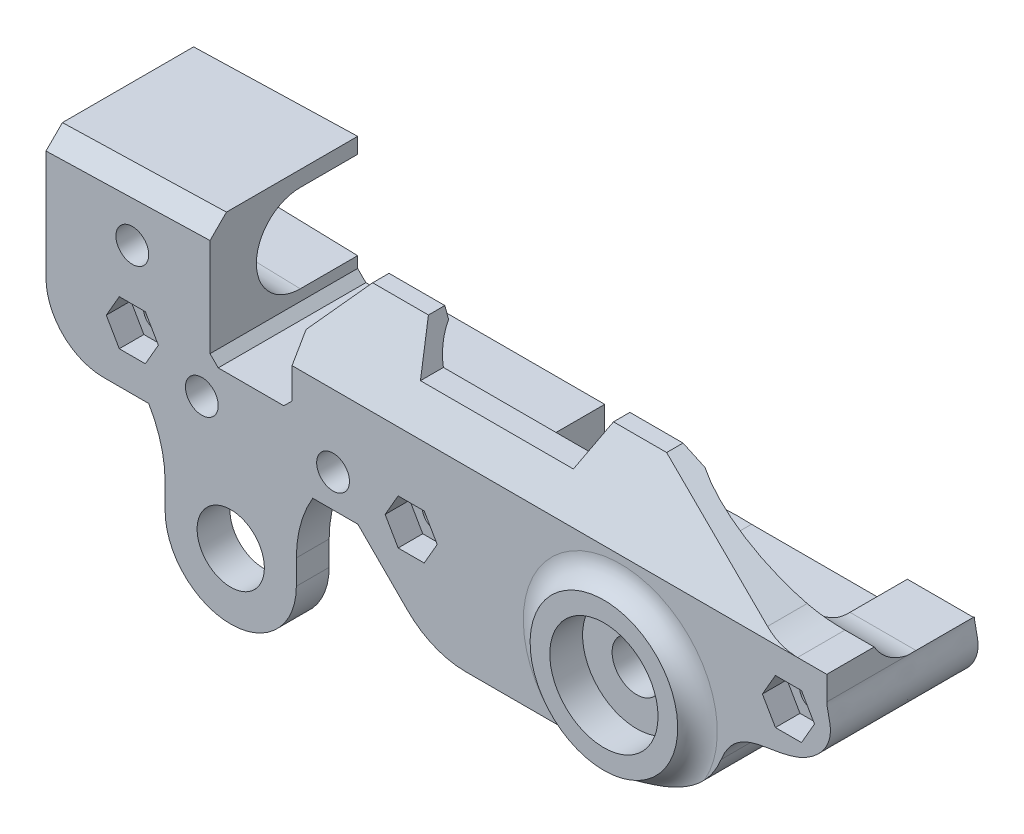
ISO-10303-21;
HEADER;
FILE_DESCRIPTION(('STEP AP214'),'2;1');
FILE_NAME('part.step','',(''),(''),'','','');
FILE_SCHEMA(('AUTOMOTIVE_DESIGN { 1 0 10303 214 1 1 1 1 }'));
ENDSEC;
DATA;
#1=APPLICATION_CONTEXT('core data for automotive mechanical design processes');
#2=APPLICATION_PROTOCOL_DEFINITION('international standard','automotive_design',2000,#1);
#3=PRODUCT_CONTEXT('',#1,'mechanical');
#4=PRODUCT('Part','Part','',(#3));
#5=PRODUCT_RELATED_PRODUCT_CATEGORY('part','',(#4));
#6=PRODUCT_DEFINITION_FORMATION('','',#4);
#7=PRODUCT_DEFINITION_CONTEXT('part definition',#1,'design');
#8=PRODUCT_DEFINITION('design','',#6,#7);
#9=PRODUCT_DEFINITION_SHAPE('','',#8);
#10=(LENGTH_UNIT() NAMED_UNIT(*) SI_UNIT(.MILLI.,.METRE.));
#11=(NAMED_UNIT(*) PLANE_ANGLE_UNIT() SI_UNIT($,.RADIAN.));
#12=(NAMED_UNIT(*) SI_UNIT($,.STERADIAN.) SOLID_ANGLE_UNIT());
#13=UNCERTAINTY_MEASURE_WITH_UNIT(LENGTH_MEASURE(1.E-05),#10,'distance_accuracy_value','');
#14=(GEOMETRIC_REPRESENTATION_CONTEXT(3) GLOBAL_UNCERTAINTY_ASSIGNED_CONTEXT((#13)) GLOBAL_UNIT_ASSIGNED_CONTEXT((#10,
#11,#12)) REPRESENTATION_CONTEXT('',''));
#15=CARTESIAN_POINT('',(0.,0.,0.));
#16=DIRECTION('',(0.,0.,1.));
#17=DIRECTION('',(1.,0.,0.));
#18=AXIS2_PLACEMENT_3D('',#15,#16,#17);
#19=CARTESIAN_POINT('',(-108.,-8.96025403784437,14.7012114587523));
#20=DIRECTION('',(0.,0.,-1.));
#21=DIRECTION('',(-1.,0.,0.));
#22=AXIS2_PLACEMENT_3D('',#19,#20,#21);
#23=CYLINDRICAL_SURFACE('',#22,1.65);
#24=CARTESIAN_POINT('',(-108.,-8.96025403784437,-2.));
#25=DIRECTION('',(0.,0.,-1.));
#26=DIRECTION('',(-1.,0.,0.));
#27=AXIS2_PLACEMENT_3D('',#24,#25,#26);
#28=CIRCLE('',#27,1.65);
#29=CARTESIAN_POINT('',(-109.65,-8.96025403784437,-2.));
#30=VERTEX_POINT('',#29);
#31=EDGE_CURVE('E826',#30,#30,#28,.F.);
#32=ORIENTED_EDGE('',*,*,#31,.F.);
#33=EDGE_LOOP('',(#32));
#34=FACE_BOUND('',#33,.T.);
#35=CARTESIAN_POINT('',(-108.,-8.96025403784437,8.));
#36=DIRECTION('',(0.,0.,1.));
#37=DIRECTION('',(1.,0.,0.));
#38=AXIS2_PLACEMENT_3D('',#35,#36,#37);
#39=CIRCLE('',#38,1.65);
#40=CARTESIAN_POINT('',(-106.35,-8.96025403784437,8.));
#41=VERTEX_POINT('',#40);
#42=EDGE_CURVE('E822',#41,#41,#39,.F.);
#43=ORIENTED_EDGE('',*,*,#42,.F.);
#44=EDGE_LOOP('',(#43));
#45=FACE_BOUND('',#44,.T.);
#46=ADVANCED_FACE('F43',(#34,#45),#23,.F.);
#47=CARTESIAN_POINT('',(-74.,-13.,14.7012114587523));
#48=DIRECTION('',(0.,0.,-1.));
#49=DIRECTION('',(-1.,0.,0.));
#50=AXIS2_PLACEMENT_3D('',#47,#48,#49);
#51=CYLINDRICAL_SURFACE('',#50,1.65);
#52=CARTESIAN_POINT('',(-74.,-13.,-2.));
#53=DIRECTION('',(0.,0.,-1.));
#54=DIRECTION('',(-1.,0.,0.));
#55=AXIS2_PLACEMENT_3D('',#52,#53,#54);
#56=CIRCLE('',#55,1.65);
#57=CARTESIAN_POINT('',(-75.65,-13.,-2.));
#58=VERTEX_POINT('',#57);
#59=EDGE_CURVE('E1072',#58,#58,#56,.F.);
#60=ORIENTED_EDGE('',*,*,#59,.F.);
#61=EDGE_LOOP('',(#60));
#62=FACE_BOUND('',#61,.T.);
#63=CARTESIAN_POINT('',(-74.,-13.,8.));
#64=DIRECTION('',(0.,0.,1.));
#65=DIRECTION('',(1.,0.,0.));
#66=AXIS2_PLACEMENT_3D('',#63,#64,#65);
#67=CIRCLE('',#66,1.65);
#68=CARTESIAN_POINT('',(-72.35,-13.,8.));
#69=VERTEX_POINT('',#68);
#70=EDGE_CURVE('E1079',#69,#69,#67,.F.);
#71=ORIENTED_EDGE('',*,*,#70,.F.);
#72=EDGE_LOOP('',(#71));
#73=FACE_BOUND('',#72,.T.);
#74=ADVANCED_FACE('F1390',(#62,#73),#51,.F.);
#75=CARTESIAN_POINT('',(-28.,-8.96025403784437,14.7012114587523));
#76=DIRECTION('',(0.,0.,-1.));
#77=DIRECTION('',(-1.,0.,0.));
#78=AXIS2_PLACEMENT_3D('',#75,#76,#77);
#79=CYLINDRICAL_SURFACE('',#78,1.65);
#80=CARTESIAN_POINT('',(-28.,-8.96025403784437,-2.));
#81=DIRECTION('',(0.,0.,-1.));
#82=DIRECTION('',(-1.,0.,0.));
#83=AXIS2_PLACEMENT_3D('',#80,#81,#82);
#84=CIRCLE('',#83,1.65);
#85=CARTESIAN_POINT('',(-29.65,-8.96025403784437,-2.));
#86=VERTEX_POINT('',#85);
#87=EDGE_CURVE('E806',#86,#86,#84,.F.);
#88=ORIENTED_EDGE('',*,*,#87,.F.);
#89=EDGE_LOOP('',(#88));
#90=FACE_BOUND('',#89,.T.);
#91=CARTESIAN_POINT('',(-28.,-8.96025403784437,8.));
#92=DIRECTION('',(0.,0.,1.));
#93=DIRECTION('',(1.,0.,0.));
#94=AXIS2_PLACEMENT_3D('',#91,#92,#93);
#95=CIRCLE('',#94,1.65);
#96=CARTESIAN_POINT('',(-26.35,-8.96025403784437,8.));
#97=VERTEX_POINT('',#96);
#98=EDGE_CURVE('E698',#97,#97,#95,.F.);
#99=ORIENTED_EDGE('',*,*,#98,.F.);
#100=EDGE_LOOP('',(#99));
#101=FACE_BOUND('',#100,.T.);
#102=ADVANCED_FACE('F1396',(#90,#101),#79,.F.);
#103=CARTESIAN_POINT('',(0.,0.,-7.));
#104=DIRECTION('',(0.,0.,1.));
#105=DIRECTION('',(1.,0.,0.));
#106=AXIS2_PLACEMENT_3D('',#103,#104,#105);
#107=PLANE('',#106);
#108=CARTESIAN_POINT('',(-74.,-13.,-7.));
#109=DIRECTION('',(0.,0.,-1.));
#110=DIRECTION('',(-1.,0.,0.));
#111=AXIS2_PLACEMENT_3D('',#108,#109,#110);
#112=CIRCLE('',#111,2.);
#113=CARTESIAN_POINT('',(-76.,-13.,-7.));
#114=VERTEX_POINT('',#113);
#115=EDGE_CURVE('E813',#114,#114,#112,.T.);
#116=ORIENTED_EDGE('',*,*,#115,.F.);
#117=EDGE_LOOP('',(#116));
#118=FACE_BOUND('',#117,.T.);
#119=CARTESIAN_POINT('',(-108.,-8.96025403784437,-7.));
#120=DIRECTION('',(0.,0.,-1.));
#121=DIRECTION('',(-1.,0.,0.));
#122=AXIS2_PLACEMENT_3D('',#119,#120,#121);
#123=CIRCLE('',#122,2.);
#124=CARTESIAN_POINT('',(-110.,-8.96025403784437,-7.));
#125=VERTEX_POINT('',#124);
#126=EDGE_CURVE('E819',#125,#125,#123,.T.);
#127=ORIENTED_EDGE('',*,*,#126,.F.);
#128=EDGE_LOOP('',(#127));
#129=FACE_BOUND('',#128,.T.);
#130=DIRECTION('',(-1.,0.,0.));
#131=VECTOR('',#130,1.);
#132=CARTESIAN_POINT('',(-80.4981081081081,-15.7,-7.));
#133=LINE('',#132,#131);
#134=CARTESIAN_POINT('',(-80.4981081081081,-15.7,-7.));
#135=VERTEX_POINT('',#134);
#136=CARTESIAN_POINT('',(-111.524285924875,-15.7,-7.));
#137=VERTEX_POINT('',#136);
#138=EDGE_CURVE('E1128',#135,#137,#133,.T.);
#139=ORIENTED_EDGE('',*,*,#138,.T.);
#140=CARTESIAN_POINT('',(-111.524285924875,-8.70000000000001,-7.));
#141=DIRECTION('',(0.,0.,1.));
#142=DIRECTION('',(1.,0.,0.));
#143=AXIS2_PLACEMENT_3D('',#140,#141,#142);
#144=CIRCLE('',#143,7.);
#145=CARTESIAN_POINT('',(-118.524285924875,-8.70000000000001,-7.));
#146=VERTEX_POINT('',#145);
#147=EDGE_CURVE('E1067',#137,#146,#144,.F.);
#148=ORIENTED_EDGE('',*,*,#147,.T.);
#149=DIRECTION('',(0.,-1.,0.));
#150=VECTOR('',#149,1.);
#151=CARTESIAN_POINT('',(-118.524285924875,-7.70000000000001,-7.));
#152=LINE('',#151,#150);
#153=CARTESIAN_POINT('',(-118.524285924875,-4.79937099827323,-7.));
#154=VERTEX_POINT('',#153);
#155=EDGE_CURVE('E855',#154,#146,#152,.T.);
#156=ORIENTED_EDGE('',*,*,#155,.F.);
#157=DIRECTION('',(0.999623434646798,-0.0274406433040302,0.));
#158=VECTOR('',#157,1.);
#159=CARTESIAN_POINT('',(-0.220895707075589,-8.04691504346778,-7.));
#160=LINE('',#159,#158);
#161=CARTESIAN_POINT('',(-98.5242859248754,-5.34839060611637,-7.));
#162=VERTEX_POINT('',#161);
#163=EDGE_CURVE('E841',#154,#162,#160,.T.);
#164=ORIENTED_EDGE('',*,*,#163,.T.);
#165=DIRECTION('',(0.,-1.,0.));
#166=VECTOR('',#165,1.);
#167=CARTESIAN_POINT('',(-98.5242859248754,0.,-7.));
#168=LINE('',#167,#166);
#169=CARTESIAN_POINT('',(-98.5242859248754,-6.7,-7.));
#170=VERTEX_POINT('',#169);
#171=EDGE_CURVE('E852',#162,#170,#168,.T.);
#172=ORIENTED_EDGE('',*,*,#171,.T.);
#173=DIRECTION('',(-0.707106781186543,0.707106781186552,0.));
#174=VECTOR('',#173,1.);
#175=CARTESIAN_POINT('',(-52.6121429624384,-52.6121429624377,-7.));
#176=LINE('',#175,#174);
#177=CARTESIAN_POINT('',(-97.5242859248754,-7.70000000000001,-7.));
#178=VERTEX_POINT('',#177);
#179=EDGE_CURVE('E1055',#170,#178,#176,.F.);
#180=ORIENTED_EDGE('',*,*,#179,.T.);
#181=DIRECTION('',(1.,0.,0.));
#182=VECTOR('',#181,1.);
#183=CARTESIAN_POINT('',(-118.524285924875,-7.70000000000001,-7.));
#184=LINE('',#183,#182);
#185=CARTESIAN_POINT('',(-89.5242859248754,-7.70000000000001,-7.));
#186=VERTEX_POINT('',#185);
#187=EDGE_CURVE('E860',#178,#186,#184,.T.);
#188=ORIENTED_EDGE('',*,*,#187,.T.);
#189=DIRECTION('',(0.707106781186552,0.707106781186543,0.));
#190=VECTOR('',#189,1.);
#191=CARTESIAN_POINT('',(-40.9121429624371,40.9121429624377,-7.));
#192=LINE('',#191,#190);
#193=CARTESIAN_POINT('',(-88.5242859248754,-6.70000000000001,-7.));
#194=VERTEX_POINT('',#193);
#195=EDGE_CURVE('E1045',#186,#194,#192,.T.);
#196=ORIENTED_EDGE('',*,*,#195,.T.);
#197=DIRECTION('',(0.,1.,0.));
#198=VECTOR('',#197,1.);
#199=CARTESIAN_POINT('',(-88.5242859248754,-5.98691398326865,-7.));
#200=LINE('',#199,#198);
#201=CARTESIAN_POINT('',(-88.5242859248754,-5.98691398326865,-7.));
#202=VERTEX_POINT('',#201);
#203=EDGE_CURVE('E1206',#194,#202,#200,.T.);
#204=ORIENTED_EDGE('',*,*,#203,.T.);
#205=DIRECTION('',(1.,0.,0.));
#206=VECTOR('',#205,1.);
#207=CARTESIAN_POINT('',(-87.5242859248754,-5.98691398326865,-7.));
#208=LINE('',#207,#206);
#209=CARTESIAN_POINT('',(-68.4,-5.98691398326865,-7.));
#210=VERTEX_POINT('',#209);
#211=EDGE_CURVE('E1198',#202,#210,#208,.T.);
#212=ORIENTED_EDGE('',*,*,#211,.T.);
#213=DIRECTION('',(0.,1.,0.));
#214=VECTOR('',#213,1.);
#215=CARTESIAN_POINT('',(-68.4,-14.8,-7.));
#216=LINE('',#215,#214);
#217=CARTESIAN_POINT('',(-68.4,-14.8,-7.));
#218=VERTEX_POINT('',#217);
#219=EDGE_CURVE('E1489',#218,#210,#216,.T.);
#220=ORIENTED_EDGE('',*,*,#219,.F.);
#221=DIRECTION('',(-1.,0.,0.));
#222=VECTOR('',#221,1.);
#223=CARTESIAN_POINT('',(-69.2,-14.8,-7.));
#224=LINE('',#223,#222);
#225=CARTESIAN_POINT('',(-69.2,-14.8,-7.));
#226=VERTEX_POINT('',#225);
#227=EDGE_CURVE('E1179',#218,#226,#224,.T.);
#228=ORIENTED_EDGE('',*,*,#227,.T.);
#229=DIRECTION('',(-0.000792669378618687,0.999999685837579,0.));
#230=VECTOR('',#229,1.);
#231=CARTESIAN_POINT('',(-69.2,-14.8,-7.));
#232=LINE('',#231,#230);
#233=CARTESIAN_POINT('',(-69.1981081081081,-17.1867344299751,-7.));
#234=VERTEX_POINT('',#233);
#235=EDGE_CURVE('E1201',#234,#226,#232,.T.);
#236=ORIENTED_EDGE('',*,*,#235,.F.);
#237=DIRECTION('',(1.,0.,0.));
#238=VECTOR('',#237,1.);
#239=CARTESIAN_POINT('',(-68.4981081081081,-17.1867344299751,-7.));
#240=LINE('',#239,#238);
#241=CARTESIAN_POINT('',(-68.4981081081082,-17.1867344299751,-7.));
#242=VERTEX_POINT('',#241);
#243=EDGE_CURVE('E1204',#234,#242,#240,.T.);
#244=ORIENTED_EDGE('',*,*,#243,.T.);
#245=DIRECTION('',(0.,1.,0.));
#246=VECTOR('',#245,1.);
#247=CARTESIAN_POINT('',(-68.4981081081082,-18.1686486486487,-7.));
#248=LINE('',#247,#246);
#249=CARTESIAN_POINT('',(-68.4981081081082,-18.1686486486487,-7.));
#250=VERTEX_POINT('',#249);
#251=EDGE_CURVE('E1212',#250,#242,#248,.T.);
#252=ORIENTED_EDGE('',*,*,#251,.F.);
#253=CARTESIAN_POINT('',(-73.03125,-21.25,-7.));
#254=DIRECTION('',(0.,0.,1.));
#255=DIRECTION('',(1.,0.,0.));
#256=AXIS2_PLACEMENT_3D('',#253,#254,#255);
#257=CIRCLE('',#256,5.48124999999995);
#258=CARTESIAN_POINT('',(-68.4981081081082,-24.3313513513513,-7.));
#259=VERTEX_POINT('',#258);
#260=EDGE_CURVE('E1219',#259,#250,#257,.T.);
#261=ORIENTED_EDGE('',*,*,#260,.F.);
#262=DIRECTION('',(0.,1.,0.));
#263=VECTOR('',#262,1.);
#264=CARTESIAN_POINT('',(-68.4981081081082,-24.7,-7.));
#265=LINE('',#264,#263);
#266=CARTESIAN_POINT('',(-68.4981081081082,-24.6346434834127,-7.));
#267=VERTEX_POINT('',#266);
#268=EDGE_CURVE('E1222',#267,#259,#265,.T.);
#269=ORIENTED_EDGE('',*,*,#268,.F.);
#270=CARTESIAN_POINT('',(-67.3566796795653,-14.7,-7.));
#271=DIRECTION('',(0.,0.,1.));
#272=DIRECTION('',(1.,0.,0.));
#273=AXIS2_PLACEMENT_3D('',#270,#271,#272);
#274=CIRCLE('',#273,10.);
#275=CARTESIAN_POINT('',(-74.4981081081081,-21.7,-7.));
#276=VERTEX_POINT('',#275);
#277=EDGE_CURVE('E1728',#267,#276,#274,.F.);
#278=ORIENTED_EDGE('',*,*,#277,.T.);
#279=DIRECTION('',(-0.707106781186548,0.707106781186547,0.));
#280=VECTOR('',#279,1.);
#281=CARTESIAN_POINT('',(-74.4981081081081,-21.7,-7.));
#282=LINE('',#281,#280);
#283=EDGE_CURVE('E1210',#276,#135,#282,.T.);
#284=ORIENTED_EDGE('',*,*,#283,.T.);
#285=EDGE_LOOP('',(#139,#148,#156,#164,#172,#180,#188,#196,#204,#212,#220,#228,#236,#244,#252,
#261,#269,#278,#284));
#286=FACE_BOUND('',#285,.T.);
#287=ADVANCED_FACE('F977',(#118,#129,#286),#107,.F.);
#288=CARTESIAN_POINT('',(-118.524285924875,-7.70000000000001,-7.));
#289=DIRECTION('',(0.,-1.,0.));
#290=DIRECTION('',(0.,0.,-1.));
#291=AXIS2_PLACEMENT_3D('',#288,#289,#290);
#292=PLANE('',#291);
#293=ORIENTED_EDGE('',*,*,#187,.F.);
#294=DIRECTION('',(0.,0.,1.));
#295=VECTOR('',#294,1.);
#296=CARTESIAN_POINT('',(-97.5242859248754,-7.70000000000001,11.));
#297=LINE('',#296,#295);
#298=CARTESIAN_POINT('',(-97.5242859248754,-7.70000000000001,11.));
#299=VERTEX_POINT('',#298);
#300=EDGE_CURVE('E1053',#178,#299,#297,.T.);
#301=ORIENTED_EDGE('',*,*,#300,.T.);
#302=DIRECTION('',(1.,0.,0.));
#303=VECTOR('',#302,1.);
#304=CARTESIAN_POINT('',(-118.524285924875,-7.70000000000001,11.));
#305=LINE('',#304,#303);
#306=CARTESIAN_POINT('',(-89.5242859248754,-7.70000000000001,11.));
#307=VERTEX_POINT('',#306);
#308=EDGE_CURVE('E862',#299,#307,#305,.T.);
#309=ORIENTED_EDGE('',*,*,#308,.T.);
#310=DIRECTION('',(0.,0.,-1.));
#311=VECTOR('',#310,1.);
#312=CARTESIAN_POINT('',(-89.5242859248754,-7.70000000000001,-7.));
#313=LINE('',#312,#311);
#314=EDGE_CURVE('E1038',#307,#186,#313,.T.);
#315=ORIENTED_EDGE('',*,*,#314,.T.);
#316=EDGE_LOOP('',(#293,#301,#309,#315));
#317=FACE_BOUND('',#316,.T.);
#318=ADVANCED_FACE('F1415',(#317),#292,.F.);
#319=CARTESIAN_POINT('',(-45.5,-14.7,-9.));
#320=DIRECTION('',(0.,0.,1.));
#321=DIRECTION('',(1.,0.,0.));
#322=AXIS2_PLACEMENT_3D('',#319,#320,#321);
#323=CYLINDRICAL_SURFACE('',#322,10.);
#324=CARTESIAN_POINT('',(-45.5,-14.7,-7.));
#325=DIRECTION('',(0.,0.,1.));
#326=DIRECTION('',(1.,0.,0.));
#327=AXIS2_PLACEMENT_3D('',#324,#325,#326);
#328=CIRCLE('',#327,10.);
#329=CARTESIAN_POINT('',(-36.2067201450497,-18.3925532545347,-7.));
#330=VERTEX_POINT('',#329);
#331=CARTESIAN_POINT('',(-45.5,-24.7,-7.));
#332=VERTEX_POINT('',#331);
#333=EDGE_CURVE('E1818',#330,#332,#328,.F.);
#334=ORIENTED_EDGE('',*,*,#333,.F.);
#335=DIRECTION('',(0.,0.,1.));
#336=VECTOR('',#335,1.);
#337=CARTESIAN_POINT('',(-36.2067201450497,-18.3925532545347,-7.));
#338=LINE('',#337,#336);
#339=CARTESIAN_POINT('',(-36.2067201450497,-18.3925532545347,11.));
#340=VERTEX_POINT('',#339);
#341=EDGE_CURVE('E1750',#330,#340,#338,.T.);
#342=ORIENTED_EDGE('',*,*,#341,.T.);
#343=CARTESIAN_POINT('',(-45.5,-14.7,11.));
#344=DIRECTION('',(0.,0.,1.));
#345=DIRECTION('',(1.,0.,0.));
#346=AXIS2_PLACEMENT_3D('',#343,#344,#345);
#347=CIRCLE('',#346,10.);
#348=CARTESIAN_POINT('',(-38.2269899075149,-21.5631861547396,11.));
#349=VERTEX_POINT('',#348);
#350=EDGE_CURVE('E1825',#349,#340,#347,.T.);
#351=ORIENTED_EDGE('',*,*,#350,.F.);
#352=CARTESIAN_POINT('',(-45.5,-24.7,12.1246502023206));
#353=CARTESIAN_POINT('',(-45.3945060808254,-24.7000061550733,12.0830189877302));
#354=CARTESIAN_POINT('',(-45.288264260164,-24.6983308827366,12.0433234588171));
#355=CARTESIAN_POINT('',(-45.0746703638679,-24.6915202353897,11.9674292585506));
#356=CARTESIAN_POINT('',(-44.9673185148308,-24.6863855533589,11.9312298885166));
#357=CARTESIAN_POINT('',(-44.7519353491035,-24.672564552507,11.8619653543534));
#358=CARTESIAN_POINT('',(-44.6439046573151,-24.6638811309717,11.8288976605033));
#359=CARTESIAN_POINT('',(-44.4273710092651,-24.6429021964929,11.7655790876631));
#360=CARTESIAN_POINT('',(-44.3188680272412,-24.6306064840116,11.7353283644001));
#361=CARTESIAN_POINT('',(-43.9937879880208,-24.5883230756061,11.6486271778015));
#362=CARTESIAN_POINT('',(-43.7768699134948,-24.552890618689,11.5959850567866));
#363=CARTESIAN_POINT('',(-43.3439889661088,-24.4673097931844,11.4994148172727));
#364=CARTESIAN_POINT('',(-43.1280263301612,-24.4171579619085,11.4554887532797));
#365=CARTESIAN_POINT('',(-42.6880867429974,-24.299348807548,11.3732842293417));
#366=CARTESIAN_POINT('',(-42.4642353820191,-24.2309543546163,11.3353877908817));
#367=CARTESIAN_POINT('',(-42.0209094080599,-24.0782143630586,11.2669601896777));
#368=CARTESIAN_POINT('',(-41.8014346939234,-23.9938691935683,11.2364288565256));
#369=CARTESIAN_POINT('',(-41.3680575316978,-23.8094769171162,11.1818600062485));
#370=CARTESIAN_POINT('',(-41.1541617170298,-23.7094120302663,11.1578299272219));
#371=CARTESIAN_POINT('',(-40.7335498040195,-23.4941325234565,11.1155856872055));
#372=CARTESIAN_POINT('',(-40.5268335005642,-23.3789183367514,11.0973713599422));
#373=CARTESIAN_POINT('',(-40.1317340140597,-23.139928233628,11.0668793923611));
#374=CARTESIAN_POINT('',(-39.9429487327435,-23.0168474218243,11.0543548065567));
#375=CARTESIAN_POINT('',(-39.5739711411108,-22.7580990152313,11.03347690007));
#376=CARTESIAN_POINT('',(-39.3937787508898,-22.6224315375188,11.0251235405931));
#377=CARTESIAN_POINT('',(-39.0430779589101,-22.3392981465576,11.012120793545));
#378=CARTESIAN_POINT('',(-38.8725600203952,-22.1918442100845,11.0074676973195));
#379=CARTESIAN_POINT('',(-38.5418368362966,-21.8857368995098,11.0014090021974));
#380=CARTESIAN_POINT('',(-38.381631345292,-21.7270837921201,11.0000033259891));
#381=CARTESIAN_POINT('',(-38.2269899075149,-21.5631861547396,11.));
#382=B_SPLINE_CURVE_WITH_KNOTS('',3,(#352,#353,#354,#355,#356,#357,#358,#359,#360,#361,#362,
#363,#364,#365,#366,#367,#368,#369,#370,#371,#372,#373,#374,#375,#376,#377,#378,#379,#380,#381),
.UNSPECIFIED.,.F.,.F.,(4,2,2,2,2,2,2,2,2,2,2,2,2,2,4),(0.,0.340180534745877,0.680292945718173,
1.0201282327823,1.3599822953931,2.03727119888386,2.71471956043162,3.42535080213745,
4.1359656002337,4.84739000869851,5.55879407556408,6.23537695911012,6.91195354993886,
7.58785117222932,8.26373270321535),.UNSPECIFIED.);
#383=CARTESIAN_POINT('',(-45.5,-24.7,12.1246502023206));
#384=VERTEX_POINT('',#383);
#385=EDGE_CURVE('E1827',#384,#349,#382,.T.);
#386=ORIENTED_EDGE('',*,*,#385,.F.);
#387=DIRECTION('',(0.,0.,1.));
#388=VECTOR('',#387,1.);
#389=CARTESIAN_POINT('',(-45.5,-24.7,-9.));
#390=LINE('',#389,#388);
#391=EDGE_CURVE('E1822',#332,#384,#390,.T.);
#392=ORIENTED_EDGE('',*,*,#391,.F.);
#393=EDGE_LOOP('',(#334,#342,#351,#386,#392));
#394=FACE_BOUND('',#393,.T.);
#395=ADVANCED_FACE('F1379',(#394),#323,.T.);
#396=CARTESIAN_POINT('',(0.,0.,4.));
#397=DIRECTION('',(0.,0.,-1.));
#398=DIRECTION('',(-1.,0.,0.));
#399=AXIS2_PLACEMENT_3D('',#396,#397,#398);
#400=PLANE('',#399);
#401=DIRECTION('',(-1.,0.,0.));
#402=VECTOR('',#401,1.);
#403=CARTESIAN_POINT('',(-33.5242859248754,4.47213595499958,4.));
#404=LINE('',#403,#402);
#405=CARTESIAN_POINT('',(-84.7382749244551,4.47213595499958,4.));
#406=VERTEX_POINT('',#405);
#407=CARTESIAN_POINT('',(-76.4404617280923,4.47213595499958,4.));
#408=VERTEX_POINT('',#407);
#409=EDGE_CURVE('E1582',#406,#408,#404,.F.);
#410=ORIENTED_EDGE('',*,*,#409,.F.);
#411=DIRECTION('',(-0.646130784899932,-0.763226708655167,0.));
#412=VECTOR('',#411,1.);
#413=CARTESIAN_POINT('',(-84.7382749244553,4.47213595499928,4.));
#414=LINE('',#413,#412);
#415=CARTESIAN_POINT('',(-83.6987924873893,5.69999999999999,4.));
#416=VERTEX_POINT('',#415);
#417=EDGE_CURVE('E1172',#416,#406,#414,.T.);
#418=ORIENTED_EDGE('',*,*,#417,.F.);
#419=DIRECTION('',(-1.,0.,0.));
#420=VECTOR('',#419,1.);
#421=CARTESIAN_POINT('',(-83.6987924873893,5.69999999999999,4.));
#422=LINE('',#421,#420);
#423=CARTESIAN_POINT('',(-76.8954231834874,5.69999999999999,4.));
#424=VERTEX_POINT('',#423);
#425=EDGE_CURVE('E1169',#424,#416,#422,.T.);
#426=ORIENTED_EDGE('',*,*,#425,.F.);
#427=DIRECTION('',(-0.347446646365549,0.937699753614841,0.));
#428=VECTOR('',#427,1.);
#429=CARTESIAN_POINT('',(-75.1509695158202,0.99201449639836,4.));
#430=LINE('',#429,#428);
#431=EDGE_CURVE('E1167',#408,#424,#430,.T.);
#432=ORIENTED_EDGE('',*,*,#431,.F.);
#433=EDGE_LOOP('',(#410,#418,#426,#432));
#434=FACE_BOUND('',#433,.T.);
#435=ADVANCED_FACE('F944',(#434),#400,.T.);
#436=CARTESIAN_POINT('',(-87.5242859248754,-5.98691398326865,-9.));
#437=DIRECTION('',(0.,1.,0.));
#438=DIRECTION('',(-1.,0.,0.));
#439=AXIS2_PLACEMENT_3D('',#436,#437,#438);
#440=PLANE('',#439);
#441=ORIENTED_EDGE('',*,*,#211,.F.);
#442=DIRECTION('',(0.,0.,1.));
#443=VECTOR('',#442,1.);
#444=CARTESIAN_POINT('',(-88.5242859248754,-5.98691398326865,-9.));
#445=LINE('',#444,#443);
#446=CARTESIAN_POINT('',(-88.5242859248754,-5.98691398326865,-0.396056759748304));
#447=VERTEX_POINT('',#446);
#448=EDGE_CURVE('E1574',#202,#447,#445,.T.);
#449=ORIENTED_EDGE('',*,*,#448,.T.);
#450=DIRECTION('',(-1.,0.,0.));
#451=VECTOR('',#450,1.);
#452=CARTESIAN_POINT('',(-33.5242859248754,-5.98691398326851,-0.396056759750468));
#453=LINE('',#452,#451);
#454=CARTESIAN_POINT('',(-68.4,-5.98691398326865,-0.396056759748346));
#455=VERTEX_POINT('',#454);
#456=EDGE_CURVE('E1260',#455,#447,#453,.T.);
#457=ORIENTED_EDGE('',*,*,#456,.F.);
#458=DIRECTION('',(0.,0.,1.));
#459=VECTOR('',#458,1.);
#460=CARTESIAN_POINT('',(-68.4,-5.98691398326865,-12.));
#461=LINE('',#460,#459);
#462=EDGE_CURVE('E1315',#210,#455,#461,.T.);
#463=ORIENTED_EDGE('',*,*,#462,.F.);
#464=EDGE_LOOP('',(#441,#449,#457,#463));
#465=FACE_BOUND('',#464,.T.);
#466=ADVANCED_FACE('F1638',(#465),#440,.T.);
#467=CARTESIAN_POINT('',(-64.,-10.8636731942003,-9.));
#468=DIRECTION('',(0.,1.,0.));
#469=DIRECTION('',(0.,0.,1.));
#470=AXIS2_PLACEMENT_3D('',#467,#468,#469);
#471=PLANE('',#470);
#472=DIRECTION('',(1.,0.,0.));
#473=VECTOR('',#472,1.);
#474=CARTESIAN_POINT('',(-64.,-10.8636731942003,-7.));
#475=LINE('',#474,#473);
#476=CARTESIAN_POINT('',(-59.6,-10.8636731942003,-7.));
#477=VERTEX_POINT('',#476);
#478=CARTESIAN_POINT('',(-59.4757140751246,-10.8636731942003,-7.));
#479=VERTEX_POINT('',#478);
#480=EDGE_CURVE('E1227',#477,#479,#475,.T.);
#481=ORIENTED_EDGE('',*,*,#480,.F.);
#482=DIRECTION('',(0.,0.,-1.));
#483=VECTOR('',#482,1.);
#484=CARTESIAN_POINT('',(-59.6,-10.8636731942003,-9.));
#485=LINE('',#484,#483);
#486=CARTESIAN_POINT('',(-59.6,-10.8636731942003,0.));
#487=VERTEX_POINT('',#486);
#488=EDGE_CURVE('E1662',#487,#477,#485,.T.);
#489=ORIENTED_EDGE('',*,*,#488,.F.);
#490=CARTESIAN_POINT('',(-64.,-10.8636731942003,0.));
#491=DIRECTION('',(0.,1.,0.));
#492=DIRECTION('',(0.,0.,1.));
#493=AXIS2_PLACEMENT_3D('',#490,#491,#492);
#494=CIRCLE('',#493,4.4);
#495=CARTESIAN_POINT('',(-60.0798119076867,-10.8636731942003,1.99803036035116));
#496=VERTEX_POINT('',#495);
#497=EDGE_CURVE('E1658',#496,#487,#494,.T.);
#498=ORIENTED_EDGE('',*,*,#497,.F.);
#499=CARTESIAN_POINT('',(-47.7217327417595,-6.85756254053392,3.95000000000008));
#500=CARTESIAN_POINT('',(-47.8971199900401,-9.85243137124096,3.95000000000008));
#501=CARTESIAN_POINT('',(-47.8971199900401,-9.85243137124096,0.950000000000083));
#502=CARTESIAN_POINT('',(-48.5893594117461,-6.8067520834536,3.95000000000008));
#503=CARTESIAN_POINT('',(-48.7647466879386,-9.80162091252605,3.95000000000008));
#504=CARTESIAN_POINT('',(-48.7647466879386,-9.80162091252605,0.950000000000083));
#505=CARTESIAN_POINT('',(-49.4569860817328,-6.75594162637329,3.95000000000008));
#506=CARTESIAN_POINT('',(-49.6323733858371,-9.75081045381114,3.95000000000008));
#507=CARTESIAN_POINT('',(-49.6323733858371,-9.75081045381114,0.950000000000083));
#508=CARTESIAN_POINT('',(-50.3246127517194,-6.70513116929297,3.95000000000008));
#509=CARTESIAN_POINT('',(-50.5000000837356,-9.69999999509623,3.95000000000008));
#510=CARTESIAN_POINT('',(-50.5000000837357,-9.69999999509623,0.950000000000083));
#511=CARTESIAN_POINT('',(-50.7590267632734,-6.67966293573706,3.95000000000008));
#512=CARTESIAN_POINT('',(-50.8885633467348,-9.67722590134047,3.95000000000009));
#513=CARTESIAN_POINT('',(-50.8885633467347,-9.67722590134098,0.950000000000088));
#514=CARTESIAN_POINT('',(-51.1940493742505,-6.66422558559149,3.95000000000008));
#515=CARTESIAN_POINT('',(-51.2770412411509,-9.66344905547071,3.95000000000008));
#516=CARTESIAN_POINT('',(-51.2770412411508,-9.66344905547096,0.950000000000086));
#517=CARTESIAN_POINT('',(-52.0643751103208,-6.65381496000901,3.95000000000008));
#518=CARTESIAN_POINT('',(-52.0532473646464,-9.65416110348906,3.95000000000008));
#519=CARTESIAN_POINT('',(-52.0532473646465,-9.65416110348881,0.95000000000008));
#520=CARTESIAN_POINT('',(-52.4996782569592,-6.65884350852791,3.95000000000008));
#521=CARTESIAN_POINT('',(-52.4409755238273,-9.65865162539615,3.95000000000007));
#522=CARTESIAN_POINT('',(-52.4409755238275,-9.65865162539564,0.950000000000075));
#523=CARTESIAN_POINT('',(-53.3695812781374,-6.68977276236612,3.95000000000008));
#524=CARTESIAN_POINT('',(-53.2150610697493,-9.68617478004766,3.95000000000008));
#525=CARTESIAN_POINT('',(-53.2150610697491,-9.68617478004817,0.950000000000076));
#526=CARTESIAN_POINT('',(-53.8041811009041,-6.71567493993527,3.95000000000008));
#527=CARTESIAN_POINT('',(-53.60141835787,-9.70920872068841,3.95000000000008));
#528=CARTESIAN_POINT('',(-53.6014183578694,-9.70920872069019,0.950000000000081));
#529=CARTESIAN_POINT('',(-54.671597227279,-6.78854398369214,3.95000000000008));
#530=CARTESIAN_POINT('',(-54.3720963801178,-9.77395085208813,3.95000000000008));
#531=CARTESIAN_POINT('',(-54.3720963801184,-9.77395085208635,0.950000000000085));
#532=CARTESIAN_POINT('',(-55.1044135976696,-6.83551005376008,3.95000000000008));
#533=CARTESIAN_POINT('',(-54.7564171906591,-9.81565833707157,3.95000000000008));
#534=CARTESIAN_POINT('',(-54.7564171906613,-9.81565833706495,0.950000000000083));
#535=CARTESIAN_POINT('',(-55.9672512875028,-6.95053030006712,3.95000000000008));
#536=CARTESIAN_POINT('',(-55.5224309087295,-9.91777148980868,3.95000000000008));
#537=CARTESIAN_POINT('',(-55.5224309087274,-9.91777148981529,0.950000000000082));
#538=CARTESIAN_POINT('',(-56.3972725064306,-7.01858523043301,3.95000000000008));
#539=CARTESIAN_POINT('',(-55.9041237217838,-9.97817782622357,3.95000000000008));
#540=CARTESIAN_POINT('',(-55.9041237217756,-9.97817782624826,0.950000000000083));
#541=CARTESIAN_POINT('',(-57.2534896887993,-7.17561714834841,3.95000000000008));
#542=CARTESIAN_POINT('',(-56.6642743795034,-10.117591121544,3.95000000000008));
#543=CARTESIAN_POINT('',(-56.6642743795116,-10.1175911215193,0.950000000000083));
#544=CARTESIAN_POINT('',(-57.6796855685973,-7.26459459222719,3.95000000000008));
#545=CARTESIAN_POINT('',(-57.0427321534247,-10.1965984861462,3.95000000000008));
#546=CARTESIAN_POINT('',(-57.042732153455,-10.1965984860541,0.950000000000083));
#547=CARTESIAN_POINT('',(-58.4931860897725,-7.45514919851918,3.95000000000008));
#548=CARTESIAN_POINT('',(-57.7655504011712,-10.3659111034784,3.95000000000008));
#549=CARTESIAN_POINT('',(-57.7655504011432,-10.3659111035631,0.950000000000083));
#550=CARTESIAN_POINT('',(-58.8808637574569,-7.55513924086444,3.95000000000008));
#551=CARTESIAN_POINT('',(-58.1102069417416,-10.4547982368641,3.95000000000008));
#552=CARTESIAN_POINT('',(-58.1102069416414,-10.4547982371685,0.950000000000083));
#553=CARTESIAN_POINT('',(-59.6513998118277,-7.77209446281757,3.95000000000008));
#554=CARTESIAN_POINT('',(-58.795825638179,-10.6478465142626,3.95000000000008));
#555=CARTESIAN_POINT('',(-58.7958256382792,-10.6478465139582,0.950000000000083));
#556=CARTESIAN_POINT('',(-60.0342586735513,-7.88905795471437,3.95000000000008));
#557=CARTESIAN_POINT('',(-59.1367881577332,-10.7520061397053,3.95000000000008));
#558=CARTESIAN_POINT('',(-59.1367881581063,-10.7520061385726,0.950000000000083));
#559=CARTESIAN_POINT('',(-60.4143822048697,-8.01430447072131,3.95000000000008));
#560=CARTESIAN_POINT('',(-59.4757139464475,-10.8636731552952,3.95000000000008));
#561=CARTESIAN_POINT('',(-59.4757139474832,-10.8636731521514,0.950000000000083));
#562=CARTESIAN_POINT('',(-60.4808022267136,-8.0361852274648,3.95000000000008));
#563=CARTESIAN_POINT('',(-59.5421340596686,-10.8855539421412,3.95000000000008));
#564=CARTESIAN_POINT('',(-59.5421340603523,-10.8855539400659,0.950000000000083));
#565=CARTESIAN_POINT('',(-60.5472222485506,-8.05806598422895,3.95000000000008));
#566=CARTESIAN_POINT('',(-59.6085541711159,-10.9074347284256,3.95000000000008));
#567=CARTESIAN_POINT('',(-59.6085541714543,-10.9074347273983,0.950000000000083));
#568=CARTESIAN_POINT('',(-63.9155409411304,-9.1676916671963,3.95000000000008));
#569=CARTESIAN_POINT('',(-62.9768773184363,-12.0170618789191,3.95000000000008));
#570=CARTESIAN_POINT('',(-62.9768773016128,-12.0170619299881,0.950000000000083));
#571=CARTESIAN_POINT('',(-67.2174395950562,-10.255436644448,3.95000000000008));
#572=CARTESIAN_POINT('',(-66.2787759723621,-13.1048068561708,3.95000000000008));
#573=CARTESIAN_POINT('',(-66.2787759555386,-13.1048069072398,0.950000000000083));
#574=CARTESIAN_POINT('',(-70.5193382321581,-11.3431816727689,3.95000000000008));
#575=CARTESIAN_POINT('',(-69.5806702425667,-14.1925504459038,3.95000000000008));
#576=CARTESIAN_POINT('',(-69.5806702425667,-14.1925504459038,0.950000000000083));
#577=(BOUNDED_SURFACE() B_SPLINE_SURFACE(3,2,((#499,#500,#501),(#502,#503,#504),(#505,#506,
#507),(#508,#509,#510),(#511,#512,#513),(#514,#515,#516),(#517,#518,#519),(#520,#521,#522),
(#523,#524,#525),(#526,#527,#528),(#529,#530,#531),(#532,#533,#534),(#535,#536,#537),(#538,#539,
#540),(#541,#542,#543),(#544,#545,#546),(#547,#548,#549),(#550,#551,#552),(#553,#554,#555),
(#556,#557,#558),(#559,#560,#561),(#562,#563,#564),(#565,#566,#567),(#568,#569,#570),(#571,#572,
#573),(#574,#575,#576)),.UNSPECIFIED.,.F.,.F.,.F.) B_SPLINE_SURFACE_WITH_KNOTS((4,3,2,2,2,2,2,2,
2,3,2,4),(3,3),(0.,2.60733957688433,3.91273431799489,5.21824540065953,6.52384857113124,
7.82940239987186,9.13500291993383,10.4406319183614,11.6413398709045,12.8419285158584,
13.0517224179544,23.4810807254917),(0.,1.),
.UNSPECIFIED.) GEOMETRIC_REPRESENTATION_ITEM() RATIONAL_B_SPLINE_SURFACE(((1.,0.707106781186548,
1.),(1.,0.707106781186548,1.),(1.,0.707106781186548,1.),(1.,0.707106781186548,1.),(1.,
0.707106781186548,1.),(1.,0.707106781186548,1.),(1.,0.707106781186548,1.),(1.,0.707106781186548,
1.),(1.,0.707106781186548,1.),(1.,0.707106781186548,1.),(1.,0.707106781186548,1.),(1.,
0.707106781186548,1.),(1.,0.707106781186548,1.),(1.,0.707106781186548,1.),(1.,0.707106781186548,
1.),(1.,0.707106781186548,1.),(1.,0.707106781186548,1.),(1.,0.707106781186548,1.),(1.,
0.707106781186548,1.),(1.,0.707106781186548,1.),(1.,0.707106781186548,1.),(1.,0.707106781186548,
1.),(1.,0.707106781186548,1.),(1.,0.707106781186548,1.),(1.,0.707106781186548,1.),(1.,
0.707106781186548,1.))) REPRESENTATION_ITEM('') SURFACE());
#578=CARTESIAN_POINT('',(-60.0798119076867,-10.8636731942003,1.99803036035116));
#579=CARTESIAN_POINT('',(-60.0486528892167,-10.8636731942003,1.9718734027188));
#580=CARTESIAN_POINT('',(-60.0180369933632,-10.8636731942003,1.94507281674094));
#581=CARTESIAN_POINT('',(-59.9580783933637,-10.8636731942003,1.89001663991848));
#582=CARTESIAN_POINT('',(-59.9287372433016,-10.8636731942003,1.86175936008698));
#583=CARTESIAN_POINT('',(-59.841635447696,-10.8636731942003,1.77324203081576));
#584=CARTESIAN_POINT('',(-59.7863277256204,-10.8636731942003,1.71048725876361));
#585=CARTESIAN_POINT('',(-59.6848533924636,-10.8636731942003,1.57697640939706));
#586=CARTESIAN_POINT('',(-59.6387677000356,-10.8636731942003,1.5061573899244));
#587=CARTESIAN_POINT('',(-59.5616274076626,-10.8636731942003,1.35754575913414));
#588=CARTESIAN_POINT('',(-59.5303792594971,-10.8636731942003,1.27985957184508));
#589=CARTESIAN_POINT('',(-59.4981592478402,-10.8636731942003,1.15914504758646));
#590=CARTESIAN_POINT('',(-59.4898578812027,-10.8636731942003,1.11803785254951));
#591=CARTESIAN_POINT('',(-59.4785831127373,-10.8636731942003,1.03464774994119));
#592=CARTESIAN_POINT('',(-59.4756689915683,-10.8636731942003,0.992356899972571));
#593=CARTESIAN_POINT('',(-59.4757140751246,-10.8636731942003,0.950000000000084));
#594=B_SPLINE_CURVE_WITH_KNOTS('',3,(#578,#579,#580,#581,#582,#583,#584,#585,#586,#587,#588,
#589,#590,#591,#592,#593),.UNSPECIFIED.,.F.,.F.,(4,2,2,2,2,2,2,4),(0.,0.12202820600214,
0.244201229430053,0.494452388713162,0.746811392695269,0.995781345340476,1.1212657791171,
1.24812299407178),.UNSPECIFIED.);
#595=CARTESIAN_POINT('',(-59.4757140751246,-10.8636731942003,0.950000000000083));
#596=VERTEX_POINT('',#595);
#597=EDGE_CURVE('E1469',#496,#596,#594,.T.);
#598=ORIENTED_EDGE('',*,*,#597,.T.);
#599=DIRECTION('',(0.,0.,1.));
#600=VECTOR('',#599,1.);
#601=CARTESIAN_POINT('',(-59.4757140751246,-10.8636731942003,-9.));
#602=LINE('',#601,#600);
#603=EDGE_CURVE('E1571',#479,#596,#602,.T.);
#604=ORIENTED_EDGE('',*,*,#603,.F.);
#605=EDGE_LOOP('',(#481,#489,#498,#598,#604));
#606=FACE_BOUND('',#605,.T.);
#607=ADVANCED_FACE('F1562',(#606),#471,.T.);
#608=CARTESIAN_POINT('',(-50.5,-9.70000000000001,-9.));
#609=CARTESIAN_POINT('',(-55.1217300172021,-9.4293395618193,-9.));
#610=CARTESIAN_POINT('',(-59.4757140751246,-10.8636731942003,-9.));
#611=B_SPLINE_CURVE_WITH_KNOTS('',2,(#608,#609,#610),.UNSPECIFIED.,.F.,.F.,(3,3),(0.,1.),.UNSPECIFIED.);
#612=DIRECTION('',(0.,0.,1.));
#613=VECTOR('',#612,1.);
#614=SURFACE_OF_LINEAR_EXTRUSION('',#611,#613);
#615=CARTESIAN_POINT('',(-50.5,-9.70000000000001,-7.));
#616=CARTESIAN_POINT('',(-55.1217300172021,-9.4293395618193,-7.));
#617=CARTESIAN_POINT('',(-59.4757140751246,-10.8636731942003,-7.));
#618=B_SPLINE_CURVE_WITH_KNOTS('',2,(#615,#616,#617),.UNSPECIFIED.,.F.,.F.,(3,3),(0.,1.),.UNSPECIFIED.);
#619=CARTESIAN_POINT('',(-50.5,-9.70000000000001,-7.));
#620=VERTEX_POINT('',#619);
#621=EDGE_CURVE('E1232',#479,#620,#618,.F.);
#622=ORIENTED_EDGE('',*,*,#621,.F.);
#623=ORIENTED_EDGE('',*,*,#603,.T.);
#624=CARTESIAN_POINT('',(-69.5806702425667,-14.1925504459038,0.950000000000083));
#625=CARTESIAN_POINT('',(-66.2787759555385,-13.1048069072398,0.950000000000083));
#626=CARTESIAN_POINT('',(-62.9768773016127,-12.0170619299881,0.950000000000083));
#627=CARTESIAN_POINT('',(-59.6085541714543,-10.9074347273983,0.950000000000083));
#628=CARTESIAN_POINT('',(-59.5421340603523,-10.8855539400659,0.950000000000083));
#629=CARTESIAN_POINT('',(-59.4757139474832,-10.8636731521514,0.950000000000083));
#630=CARTESIAN_POINT('',(-59.1367881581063,-10.7520061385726,0.950000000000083));
#631=CARTESIAN_POINT('',(-58.7958256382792,-10.6478465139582,0.950000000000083));
#632=CARTESIAN_POINT('',(-58.1102069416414,-10.4547982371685,0.950000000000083));
#633=CARTESIAN_POINT('',(-57.7655504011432,-10.3659111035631,0.950000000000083));
#634=CARTESIAN_POINT('',(-57.042732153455,-10.1965984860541,0.950000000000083));
#635=CARTESIAN_POINT('',(-56.6642743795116,-10.1175911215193,0.950000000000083));
#636=CARTESIAN_POINT('',(-55.9041237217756,-9.97817782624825,0.950000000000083));
#637=CARTESIAN_POINT('',(-55.5224309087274,-9.91777148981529,0.950000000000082));
#638=CARTESIAN_POINT('',(-54.7564171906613,-9.81565833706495,0.950000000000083));
#639=CARTESIAN_POINT('',(-54.3720963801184,-9.77395085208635,0.950000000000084));
#640=CARTESIAN_POINT('',(-53.6014183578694,-9.70920872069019,0.950000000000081));
#641=CARTESIAN_POINT('',(-53.2150610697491,-9.68617478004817,0.950000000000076));
#642=CARTESIAN_POINT('',(-52.4409755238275,-9.65865162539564,0.950000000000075));
#643=CARTESIAN_POINT('',(-52.0532473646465,-9.65416110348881,0.95000000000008));
#644=CARTESIAN_POINT('',(-51.2770412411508,-9.66344905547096,0.950000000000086));
#645=CARTESIAN_POINT('',(-50.8885633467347,-9.67722590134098,0.950000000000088));
#646=CARTESIAN_POINT('',(-50.5000000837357,-9.69999999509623,0.950000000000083));
#647=CARTESIAN_POINT('',(-49.6323733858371,-9.75081045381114,0.950000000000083));
#648=CARTESIAN_POINT('',(-48.7647466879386,-9.80162091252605,0.950000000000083));
#649=CARTESIAN_POINT('',(-47.8971199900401,-9.85243137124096,0.950000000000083));
#650=B_SPLINE_CURVE_WITH_KNOTS('',3,(#624,#625,#626,#627,#628,#629,#630,#631,#632,#633,#634,
#635,#636,#637,#638,#639,#640,#641,#642,#643,#644,#645,#646,#647,#648,#649),.UNSPECIFIED.,.F.,
.F.,(4,2,3,2,2,2,2,2,2,2,3,4),(0.,10.4293583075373,10.6391522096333,11.8397408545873,
13.0404488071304,14.3460778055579,15.6516783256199,16.9572321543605,18.2628353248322,
19.5683464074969,20.8737411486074,23.4810807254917),.UNSPECIFIED.);
#651=CARTESIAN_POINT('',(-50.5,-9.70000000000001,0.950000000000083));
#652=VERTEX_POINT('',#651);
#653=EDGE_CURVE('E1539',#596,#652,#650,.T.);
#654=ORIENTED_EDGE('',*,*,#653,.T.);
#655=DIRECTION('',(0.,0.,1.));
#656=VECTOR('',#655,1.);
#657=CARTESIAN_POINT('',(-50.5,-9.70000000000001,-9.));
#658=LINE('',#657,#656);
#659=EDGE_CURVE('E1568',#620,#652,#658,.T.);
#660=ORIENTED_EDGE('',*,*,#659,.F.);
#661=EDGE_LOOP('',(#622,#623,#654,#660));
#662=FACE_BOUND('',#661,.T.);
#663=ADVANCED_FACE('F1508',(#662),#614,.T.);
#664=CARTESIAN_POINT('',(-35.5,-9.70000000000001,-9.));
#665=DIRECTION('',(0.,1.,0.));
#666=DIRECTION('',(0.,0.,1.));
#667=AXIS2_PLACEMENT_3D('',#664,#665,#666);
#668=PLANE('',#667);
#669=DIRECTION('',(0.,0.,1.));
#670=VECTOR('',#669,1.);
#671=CARTESIAN_POINT('',(-34.5,-9.70000000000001,-0.950000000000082));
#672=LINE('',#671,#670);
#673=CARTESIAN_POINT('',(-34.5,-9.70000000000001,0.950000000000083));
#674=VERTEX_POINT('',#673);
#675=CARTESIAN_POINT('',(-34.5,-9.699998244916,-7.));
#676=VERTEX_POINT('',#675);
#677=EDGE_CURVE('E1009',#674,#676,#672,.F.);
#678=ORIENTED_EDGE('',*,*,#677,.T.);
#679=DIRECTION('',(0.99999999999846,1.75508400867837E-06,0.));
#680=VECTOR('',#679,1.);
#681=CARTESIAN_POINT('',(1.70242055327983E-05,-9.69993769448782,-7.));
#682=LINE('',#681,#680);
#683=CARTESIAN_POINT('',(-35.5,-9.70000000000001,-7.));
#684=VERTEX_POINT('',#683);
#685=EDGE_CURVE('E870',#684,#676,#682,.T.);
#686=ORIENTED_EDGE('',*,*,#685,.F.);
#687=DIRECTION('',(1.,0.,0.));
#688=VECTOR('',#687,1.);
#689=CARTESIAN_POINT('',(-35.5,-9.70000000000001,-7.));
#690=LINE('',#689,#688);
#691=EDGE_CURVE('E1215',#620,#684,#690,.T.);
#692=ORIENTED_EDGE('',*,*,#691,.F.);
#693=ORIENTED_EDGE('',*,*,#659,.T.);
#694=DIRECTION('',(1.,0.,0.));
#695=VECTOR('',#694,1.);
#696=CARTESIAN_POINT('',(-35.5,-9.70000000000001,0.950000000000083));
#697=LINE('',#696,#695);
#698=EDGE_CURVE('E1532',#652,#674,#697,.T.);
#699=ORIENTED_EDGE('',*,*,#698,.T.);
#700=EDGE_LOOP('',(#678,#686,#692,#693,#699));
#701=FACE_BOUND('',#700,.T.);
#702=ADVANCED_FACE('F1554',(#701),#668,.T.);
#703=CARTESIAN_POINT('',(-64.,-14.9869139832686,0.));
#704=DIRECTION('',(0.,1.,0.));
#705=DIRECTION('',(-1.,0.,0.));
#706=AXIS2_PLACEMENT_3D('',#703,#704,#705);
#707=CYLINDRICAL_SURFACE('',#706,4.4);
#708=DIRECTION('',(0.,-1.,0.));
#709=VECTOR('',#708,1.);
#710=CARTESIAN_POINT('',(-68.4,-14.8,0.));
#711=LINE('',#710,#709);
#712=CARTESIAN_POINT('',(-68.4,-6.,0.));
#713=VERTEX_POINT('',#712);
#714=CARTESIAN_POINT('',(-68.4,-14.8,0.));
#715=VERTEX_POINT('',#714);
#716=EDGE_CURVE('E1273',#713,#715,#711,.T.);
#717=ORIENTED_EDGE('',*,*,#716,.F.);
#718=CARTESIAN_POINT('',(-68.4,-6.,0.));
#719=CARTESIAN_POINT('',(-68.4000226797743,-6.0000244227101,0.108642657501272));
#720=CARTESIAN_POINT('',(-68.3959769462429,-5.99704995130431,0.21726802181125));
#721=CARTESIAN_POINT('',(-68.3799242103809,-5.98528876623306,0.433546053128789));
#722=CARTESIAN_POINT('',(-68.3679221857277,-5.97650568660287,0.54119928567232));
#723=CARTESIAN_POINT('',(-68.3362374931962,-5.95338935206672,0.754024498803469));
#724=CARTESIAN_POINT('',(-68.3166063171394,-5.93909331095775,0.859208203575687));
#725=CARTESIAN_POINT('',(-68.2699822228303,-5.90529366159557,1.06705689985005));
#726=CARTESIAN_POINT('',(-68.2429885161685,-5.88578949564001,1.16972162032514));
#727=CARTESIAN_POINT('',(-68.1516411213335,-5.82016318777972,1.47246030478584));
#728=CARTESIAN_POINT('',(-68.0768193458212,-5.76685134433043,1.66794237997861));
#729=CARTESIAN_POINT('',(-67.9026504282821,-5.64506952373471,2.04259161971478));
#730=CARTESIAN_POINT('',(-67.8032690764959,-5.57657841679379,2.22173554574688));
#731=CARTESIAN_POINT('',(-67.573273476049,-5.42220885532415,2.57690555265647));
#732=CARTESIAN_POINT('',(-67.440645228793,-5.33531728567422,2.75117852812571));
#733=CARTESIAN_POINT('',(-67.1531210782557,-5.15457089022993,3.07653509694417));
#734=CARTESIAN_POINT('',(-66.9981954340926,-5.06070684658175,3.22758715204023));
#735=CARTESIAN_POINT('',(-66.7347032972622,-4.91040639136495,3.44934457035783));
#736=CARTESIAN_POINT('',(-66.6325670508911,-4.85410748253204,3.52792289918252));
#737=CARTESIAN_POINT('',(-66.421254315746,-4.74282486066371,3.6761654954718));
#738=CARTESIAN_POINT('',(-66.3120758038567,-4.68784153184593,3.74582718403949));
#739=CARTESIAN_POINT('',(-66.0869675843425,-4.58100859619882,3.87574859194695));
#740=CARTESIAN_POINT('',(-65.9710455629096,-4.52915555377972,3.93601873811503));
#741=CARTESIAN_POINT('',(-65.7325850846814,-4.4305810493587,4.0466575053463));
#742=CARTESIAN_POINT('',(-65.6100503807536,-4.38385672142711,4.09703166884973));
#743=CARTESIAN_POINT('',(-65.316586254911,-4.28353685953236,4.20216868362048));
#744=CARTESIAN_POINT('',(-65.1431036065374,-4.23281576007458,4.25282948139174));
#745=CARTESIAN_POINT('',(-64.8761887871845,-4.17135426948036,4.31284353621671));
#746=CARTESIAN_POINT('',(-64.7861525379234,-4.15330961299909,4.33018029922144));
#747=CARTESIAN_POINT('',(-64.6042725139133,-4.12275719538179,4.35927987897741));
#748=CARTESIAN_POINT('',(-64.5124296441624,-4.11024673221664,4.37104541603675));
#749=CARTESIAN_POINT('',(-64.3268053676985,-4.09123574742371,4.3888452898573));
#750=CARTESIAN_POINT('',(-64.2330142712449,-4.08478491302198,4.39483225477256));
#751=CARTESIAN_POINT('',(-64.0450190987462,-4.07838252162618,4.40077445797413));
#752=CARTESIAN_POINT('',(-63.9508150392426,-4.0784307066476,4.40072993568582));
#753=CARTESIAN_POINT('',(-63.762797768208,-4.08502552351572,4.39460873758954));
#754=CARTESIAN_POINT('',(-63.6689847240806,-4.09157469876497,4.38852970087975));
#755=CARTESIAN_POINT('',(-63.4825367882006,-4.11085882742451,4.37047048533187));
#756=CARTESIAN_POINT('',(-63.3899025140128,-4.12359689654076,4.35848733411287));
#757=CARTESIAN_POINT('',(-63.1966013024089,-4.15637148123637,4.32725550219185));
#758=CARTESIAN_POINT('',(-63.0961471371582,-4.17704758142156,4.30736198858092));
#759=CARTESIAN_POINT('',(-62.8981607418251,-4.22430950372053,4.26102170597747));
#760=CARTESIAN_POINT('',(-62.800630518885,-4.2508992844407,4.23457054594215));
#761=CARTESIAN_POINT('',(-62.5127986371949,-4.33800408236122,4.14590816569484));
#762=CARTESIAN_POINT('',(-62.3274670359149,-4.40581475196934,4.07442349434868));
#763=CARTESIAN_POINT('',(-62.0297846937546,-4.52877362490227,3.93646841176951));
#764=CARTESIAN_POINT('',(-61.9132764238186,-4.58088415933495,3.87590635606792));
#765=CARTESIAN_POINT('',(-61.687105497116,-4.68823873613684,3.74533768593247));
#766=CARTESIAN_POINT('',(-61.5774450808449,-4.74348379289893,3.67532800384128));
#767=CARTESIAN_POINT('',(-61.3650983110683,-4.85536339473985,3.52620882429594));
#768=CARTESIAN_POINT('',(-61.2624186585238,-4.91199920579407,3.44709077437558));
#769=CARTESIAN_POINT('',(-61.0643705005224,-5.02506883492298,3.28006900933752));
#770=CARTESIAN_POINT('',(-60.9690011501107,-5.08150267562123,3.1921663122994));
#771=CARTESIAN_POINT('',(-60.7846473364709,-5.19355967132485,3.00647031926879));
#772=CARTESIAN_POINT('',(-60.6957715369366,-5.24916026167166,2.90855530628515));
#773=CARTESIAN_POINT('',(-60.5264601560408,-5.35735392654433,2.7040961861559));
#774=CARTESIAN_POINT('',(-60.4460255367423,-5.40994665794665,2.59755109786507));
#775=CARTESIAN_POINT('',(-60.2944776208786,-5.51068951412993,2.37635135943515));
#776=CARTESIAN_POINT('',(-60.2233482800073,-5.55884724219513,2.26171120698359));
#777=CARTESIAN_POINT('',(-60.0911495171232,-5.6494953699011,2.02466907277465));
#778=CARTESIAN_POINT('',(-60.0300760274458,-5.69198805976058,1.9022702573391));
#779=CARTESIAN_POINT('',(-59.933161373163,-5.76006191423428,1.6826536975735));
#780=CARTESIAN_POINT('',(-59.8948603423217,-5.78718995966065,1.58699304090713));
#781=CARTESIAN_POINT('',(-59.8247838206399,-5.83710755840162,1.39221947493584));
#782=CARTESIAN_POINT('',(-59.7930068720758,-5.85989808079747,1.29310734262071));
#783=CARTESIAN_POINT('',(-59.7364181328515,-5.90065635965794,1.09213044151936));
#784=CARTESIAN_POINT('',(-59.7115944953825,-5.91863231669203,0.990270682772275));
#785=CARTESIAN_POINT('',(-59.6691931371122,-5.94942657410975,0.784321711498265));
#786=CARTESIAN_POINT('',(-59.6516124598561,-5.96224697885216,0.680233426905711));
#787=CARTESIAN_POINT('',(-59.6252444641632,-5.98150557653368,0.480315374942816));
#788=CARTESIAN_POINT('',(-59.6157905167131,-5.98842708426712,0.384619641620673));
#789=CARTESIAN_POINT('',(-59.6031620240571,-5.9976813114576,0.192619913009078));
#790=CARTESIAN_POINT('',(-59.5999858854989,-6.00001519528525,0.0963160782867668));
#791=CARTESIAN_POINT('',(-59.6,-6.,0.));
#792=B_SPLINE_CURVE_WITH_KNOTS('',3,(#718,#719,#720,#721,#722,#723,#724,#725,#726,#727,#728,
#729,#730,#731,#732,#733,#734,#735,#736,#737,#738,#739,#740,#741,#742,#743,#744,#745,#746,#747,
#748,#749,#750,#751,#752,#753,#754,#755,#756,#757,#758,#759,#760,#761,#762,#763,#764,#765,#766,
#767,#768,#769,#770,#771,#772,#773,#774,#775,#776,#777,#778,#779,#780,#781,#782,#783,#784,#785,
#786,#787,#788,#789,#790,#791),.UNSPECIFIED.,.F.,.F.,(4,2,2,2,2,2,2,2,2,2,2,2,2,2,2,2,2,2,2,2,2,
2,2,2,2,2,2,2,2,2,2,2,2,2,2,2,4),(0.,0.325783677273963,0.651363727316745,0.974783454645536,
1.29823782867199,1.94314592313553,2.58895744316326,3.29328222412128,3.99855531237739,
4.42003807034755,4.84164245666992,5.26277537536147,5.68367175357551,6.24440209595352,
6.52446450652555,6.80439002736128,7.08659132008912,7.36878141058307,7.65108194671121,
7.93352475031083,8.24646698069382,8.55961932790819,9.18656954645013,9.60995129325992,
10.0334708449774,10.4573913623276,10.8812628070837,11.3110957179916,11.740977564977,
12.1701081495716,12.5990647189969,12.9184156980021,13.2376952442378,13.5564274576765,
13.8750294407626,14.1639493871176,14.4527959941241),.UNSPECIFIED.);
#793=CARTESIAN_POINT('',(-62.0615728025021,-4.51635915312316,3.95000000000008));
#794=VERTEX_POINT('',#793);
#795=EDGE_CURVE('E990',#713,#794,#792,.T.);
#796=ORIENTED_EDGE('',*,*,#795,.T.);
#797=DIRECTION('',(0.,-1.,0.));
#798=VECTOR('',#797,1.);
#799=CARTESIAN_POINT('',(-62.0615728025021,-0.98691398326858,3.95000000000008));
#800=LINE('',#799,#798);
#801=CARTESIAN_POINT('',(-62.0615728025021,-8.55693871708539,3.95000000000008));
#802=VERTEX_POINT('',#801);
#803=EDGE_CURVE('E1268',#794,#802,#800,.T.);
#804=ORIENTED_EDGE('',*,*,#803,.T.);
#805=CARTESIAN_POINT('',(-62.0615728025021,-8.55693871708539,3.95000000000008));
#806=CARTESIAN_POINT('',(-62.0615842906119,-8.59630692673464,3.95000193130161));
#807=CARTESIAN_POINT('',(-62.0601455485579,-8.63567023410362,3.94929985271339));
#808=CARTESIAN_POINT('',(-62.054275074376,-8.71411249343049,3.94641245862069));
#809=CARTESIAN_POINT('',(-62.0498436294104,-8.75319147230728,3.94422728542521));
#810=CARTESIAN_POINT('',(-62.0320572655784,-8.86871693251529,3.93540170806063));
#811=CARTESIAN_POINT('',(-62.0142140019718,-8.94436153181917,3.926494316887));
#812=CARTESIAN_POINT('',(-61.967716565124,-9.09113735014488,3.90262555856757));
#813=CARTESIAN_POINT('',(-61.9390602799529,-9.16226768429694,3.88766300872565));
#814=CARTESIAN_POINT('',(-61.8734339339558,-9.29921462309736,3.85215580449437));
#815=CARTESIAN_POINT('',(-61.8364433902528,-9.36501758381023,3.8315973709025));
#816=CARTESIAN_POINT('',(-61.7618915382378,-9.48306874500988,3.78846686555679));
#817=CARTESIAN_POINT('',(-61.7250073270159,-9.53597449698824,3.76648790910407));
#818=CARTESIAN_POINT('',(-61.6482778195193,-9.63797018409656,3.71906548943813));
#819=CARTESIAN_POINT('',(-61.6084304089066,-9.68705734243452,3.69361954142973));
#820=CARTESIAN_POINT('',(-61.4858327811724,-9.82945833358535,3.61227539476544));
#821=CARTESIAN_POINT('',(-61.4002515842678,-9.91758296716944,3.55149568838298));
#822=CARTESIAN_POINT('',(-61.2489185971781,-10.0617192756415,3.43487049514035));
#823=CARTESIAN_POINT('',(-61.1835348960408,-10.1202635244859,3.38156422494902));
#824=CARTESIAN_POINT('',(-61.0531698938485,-10.2314725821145,3.26858075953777));
#825=CARTESIAN_POINT('',(-60.9881887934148,-10.2841346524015,3.20890062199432));
#826=CARTESIAN_POINT('',(-60.8599811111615,-10.3837125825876,3.0835541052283));
#827=CARTESIAN_POINT('',(-60.7967510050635,-10.4306407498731,3.01790109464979));
#828=CARTESIAN_POINT('',(-60.6728324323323,-10.5189314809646,2.88071395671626));
#829=CARTESIAN_POINT('',(-60.6121444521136,-10.5602929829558,2.80917871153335));
#830=CARTESIAN_POINT('',(-60.4650952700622,-10.6562869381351,2.62382568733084));
#831=CARTESIAN_POINT('',(-60.3807779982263,-10.7074488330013,2.50650844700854));
#832=CARTESIAN_POINT('',(-60.2618788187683,-10.77394070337,2.32203145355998));
#833=CARTESIAN_POINT('',(-60.2234909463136,-10.794403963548,2.25908807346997));
#834=CARTESIAN_POINT('',(-60.1494957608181,-10.8317592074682,2.1305210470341));
#835=CARTESIAN_POINT('',(-60.1138898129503,-10.8486494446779,2.06489610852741));
#836=CARTESIAN_POINT('',(-60.0798119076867,-10.8636731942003,1.99803036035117));
#837=B_SPLINE_CURVE_WITH_KNOTS('',3,(#805,#806,#807,#808,#809,#810,#811,#812,#813,#814,#815,
#816,#817,#818,#819,#820,#821,#822,#823,#824,#825,#826,#827,#828,#829,#830,#831,#832,#833,#834,
#835,#836),.UNSPECIFIED.,.F.,.F.,(4,2,2,2,2,2,2,2,2,2,2,2,2,2,2,4),(0.,0.118054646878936,
0.236097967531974,0.469493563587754,0.702934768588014,0.936956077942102,1.14106963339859,
1.34533025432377,1.75508927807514,2.0628274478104,2.37070829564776,2.67791623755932,
2.98518269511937,3.44348676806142,3.6728723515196,3.90236980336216),.UNSPECIFIED.);
#838=EDGE_CURVE('E1482',#802,#496,#837,.T.);
#839=ORIENTED_EDGE('',*,*,#838,.T.);
#840=ORIENTED_EDGE('',*,*,#497,.T.);
#841=DIRECTION('',(0.,1.,0.));
#842=VECTOR('',#841,1.);
#843=CARTESIAN_POINT('',(-59.6,-5.98691398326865,0.));
#844=LINE('',#843,#842);
#845=CARTESIAN_POINT('',(-59.6,-14.8,0.));
#846=VERTEX_POINT('',#845);
#847=EDGE_CURVE('E1270',#846,#487,#844,.T.);
#848=ORIENTED_EDGE('',*,*,#847,.F.);
#849=CARTESIAN_POINT('',(-64.,-14.8,0.));
#850=DIRECTION('',(0.,-1.,0.));
#851=DIRECTION('',(0.,0.,-1.));
#852=AXIS2_PLACEMENT_3D('',#849,#850,#851);
#853=CIRCLE('',#852,4.4);
#854=EDGE_CURVE('E1572',#715,#846,#853,.F.);
#855=ORIENTED_EDGE('',*,*,#854,.F.);
#856=EDGE_LOOP('',(#717,#796,#804,#839,#840,#848,#855));
#857=FACE_BOUND('',#856,.T.);
#858=ADVANCED_FACE('F1492',(#857),#707,.F.);
#859=CARTESIAN_POINT('',(-53.5018918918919,-24.7,-9.));
#860=DIRECTION('',(0.,-1.,0.));
#861=DIRECTION('',(1.,0.,0.));
#862=AXIS2_PLACEMENT_3D('',#859,#860,#861);
#863=PLANE('',#862);
#864=DIRECTION('',(1.,0.,0.));
#865=VECTOR('',#864,1.);
#866=CARTESIAN_POINT('',(-74.4981081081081,-24.7,11.));
#867=LINE('',#866,#865);
#868=CARTESIAN_POINT('',(-67.3566796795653,-24.7,11.));
#869=VERTEX_POINT('',#868);
#870=CARTESIAN_POINT('',(-56.1753949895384,-24.7,11.));
#871=VERTEX_POINT('',#870);
#872=EDGE_CURVE('E1141',#869,#871,#867,.T.);
#873=ORIENTED_EDGE('',*,*,#872,.F.);
#874=DIRECTION('',(0.,0.,-1.));
#875=VECTOR('',#874,1.);
#876=CARTESIAN_POINT('',(-67.3566796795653,-24.7,-7.));
#877=LINE('',#876,#875);
#878=CARTESIAN_POINT('',(-67.3566796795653,-24.7,2.99427421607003));
#879=VERTEX_POINT('',#878);
#880=EDGE_CURVE('E1372',#869,#879,#877,.T.);
#881=ORIENTED_EDGE('',*,*,#880,.T.);
#882=CARTESIAN_POINT('',(-64.,-24.7,0.));
#883=DIRECTION('',(0.,-1.,0.));
#884=DIRECTION('',(0.,0.,-1.));
#885=AXIS2_PLACEMENT_3D('',#882,#883,#884);
#886=CIRCLE('',#885,4.49810810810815);
#887=CARTESIAN_POINT('',(-59.5018918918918,-24.7,0.));
#888=VERTEX_POINT('',#887);
#889=EDGE_CURVE('E1691',#888,#879,#886,.T.);
#890=ORIENTED_EDGE('',*,*,#889,.F.);
#891=DIRECTION('',(0.,0.,1.));
#892=VECTOR('',#891,1.);
#893=CARTESIAN_POINT('',(-59.5018918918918,-24.7,-12.));
#894=LINE('',#893,#892);
#895=CARTESIAN_POINT('',(-59.5018918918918,-24.7,-7.));
#896=VERTEX_POINT('',#895);
#897=EDGE_CURVE('E1301',#896,#888,#894,.T.);
#898=ORIENTED_EDGE('',*,*,#897,.F.);
#899=DIRECTION('',(-1.,0.,0.));
#900=VECTOR('',#899,1.);
#901=CARTESIAN_POINT('',(-53.5018918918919,-24.7,-7.));
#902=LINE('',#901,#900);
#903=EDGE_CURVE('E1213',#332,#896,#902,.T.);
#904=ORIENTED_EDGE('',*,*,#903,.F.);
#905=ORIENTED_EDGE('',*,*,#391,.T.);
#906=CARTESIAN_POINT('',(-40.8246050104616,-24.7,11.));
#907=CARTESIAN_POINT('',(-40.9432242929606,-24.7,11.0000042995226));
#908=CARTESIAN_POINT('',(-41.0618109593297,-24.7,11.0029617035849));
#909=CARTESIAN_POINT('',(-41.298678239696,-24.7,11.014332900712));
#910=CARTESIAN_POINT('',(-41.4169589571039,-24.7,11.0227445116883));
#911=CARTESIAN_POINT('',(-41.7708236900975,-24.7,11.055462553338));
#912=CARTESIAN_POINT('',(-42.0057324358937,-24.7,11.0872544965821));
#913=CARTESIAN_POINT('',(-42.4714885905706,-24.7,11.1673379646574));
#914=CARTESIAN_POINT('',(-42.7023497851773,-24.7,11.2155522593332));
#915=CARTESIAN_POINT('',(-43.1607784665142,-24.7,11.325581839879));
#916=CARTESIAN_POINT('',(-43.3883457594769,-24.7,11.3873979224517));
#917=CARTESIAN_POINT('',(-43.818002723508,-24.7,11.5152696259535));
#918=CARTESIAN_POINT('',(-44.0203987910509,-24.7,11.5803119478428));
#919=CARTESIAN_POINT('',(-44.4228293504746,-24.7,11.7172342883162));
#920=CARTESIAN_POINT('',(-44.6228639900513,-24.7,11.7891138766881));
#921=CARTESIAN_POINT('',(-45.0211050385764,-24.7,11.9376005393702));
#922=CARTESIAN_POINT('',(-45.2193117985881,-24.7,12.0142066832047));
#923=CARTESIAN_POINT('',(-45.6149734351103,-24.7,12.169794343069));
#924=CARTESIAN_POINT('',(-45.8124275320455,-24.7,12.2487778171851));
#925=CARTESIAN_POINT('',(-46.1101522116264,-24.7,12.366949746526));
#926=CARTESIAN_POINT('',(-46.2102664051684,-24.7,12.4065302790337));
#927=CARTESIAN_POINT('',(-46.4108431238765,-24.7,12.4848026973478));
#928=CARTESIAN_POINT('',(-46.5113056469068,-24.7,12.5234945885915));
#929=CARTESIAN_POINT('',(-46.7125724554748,-24.7,12.5991055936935));
#930=CARTESIAN_POINT('',(-46.8133749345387,-24.7,12.6360294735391));
#931=CARTESIAN_POINT('',(-47.0159710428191,-24.7,12.7071981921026));
#932=CARTESIAN_POINT('',(-47.1177649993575,-24.7,12.7414421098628));
#933=CARTESIAN_POINT('',(-47.3233403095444,-24.7,12.8060543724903));
#934=CARTESIAN_POINT('',(-47.4271303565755,-24.7,12.8363955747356));
#935=CARTESIAN_POINT('',(-47.6362707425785,-24.7,12.891059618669));
#936=CARTESIAN_POINT('',(-47.7416203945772,-24.7,12.9153850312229));
#937=CARTESIAN_POINT('',(-47.9550331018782,-24.7,12.9560156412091));
#938=CARTESIAN_POINT('',(-48.0631127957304,-24.7,12.9722376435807));
#939=CARTESIAN_POINT('',(-48.2262274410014,-24.7,12.9887469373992));
#940=CARTESIAN_POINT('',(-48.2808764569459,-24.7,12.9929466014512));
#941=CARTESIAN_POINT('',(-48.3903465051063,-24.7,12.9985816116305));
#942=CARTESIAN_POINT('',(-48.4451676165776,-24.7,13.0000154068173));
#943=CARTESIAN_POINT('',(-48.5000000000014,-24.7,12.9999999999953));
#944=B_SPLINE_CURVE_WITH_KNOTS('',3,(#906,#907,#908,#909,#910,#911,#912,#913,#914,#915,#916,
#917,#918,#919,#920,#921,#922,#923,#924,#925,#926,#927,#928,#929,#930,#931,#932,#933,#934,#935,
#936,#937,#938,#939,#940,#941,#942,#943),.UNSPECIFIED.,.F.,.F.,(4,2,2,2,2,2,2,2,2,2,2,2,2,2,2,2,
2,2,4),(0.,0.355768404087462,0.711394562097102,1.42174359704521,2.12879713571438,
2.83589209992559,3.47351283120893,4.11109346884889,4.7485489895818,5.38654474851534,
5.70950661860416,6.03246651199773,6.35450017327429,6.67664401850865,7.00091938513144,
7.32505593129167,7.65245519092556,7.81682148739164,7.98127992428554),.UNSPECIFIED.);
#945=CARTESIAN_POINT('',(-48.5,-24.7,13.));
#946=VERTEX_POINT('',#945);
#947=EDGE_CURVE('E1617',#384,#946,#944,.T.);
#948=ORIENTED_EDGE('',*,*,#947,.T.);
#949=CARTESIAN_POINT('',(-48.5,-24.7,13.));
#950=CARTESIAN_POINT('',(-48.5643976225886,-24.7,13.0000341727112));
#951=CARTESIAN_POINT('',(-48.6287805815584,-24.7,12.99804557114));
#952=CARTESIAN_POINT('',(-48.7572624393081,-24.7,12.9902852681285));
#953=CARTESIAN_POINT('',(-48.8213615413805,-24.7,12.9845169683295));
#954=CARTESIAN_POINT('',(-48.9486656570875,-24.7,12.9695144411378));
#955=CARTESIAN_POINT('',(-49.0118737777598,-24.7,12.9603061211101));
#956=CARTESIAN_POINT('',(-49.1377753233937,-24.7,12.9388368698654));
#957=CARTESIAN_POINT('',(-49.2004686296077,-24.7,12.9265752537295));
#958=CARTESIAN_POINT('',(-49.3876894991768,-24.7,12.8859041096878));
#959=CARTESIAN_POINT('',(-49.5113737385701,-24.7,12.8536062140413));
#960=CARTESIAN_POINT('',(-49.695470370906,-24.7,12.7999240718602));
#961=CARTESIAN_POINT('',(-49.756680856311,-24.7,12.7811279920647));
#962=CARTESIAN_POINT('',(-49.878656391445,-24.7,12.7421386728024));
#963=CARTESIAN_POINT('',(-49.9394214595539,-24.7,12.7219454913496));
#964=CARTESIAN_POINT('',(-50.1253513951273,-24.7,12.6583078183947));
#965=CARTESIAN_POINT('',(-50.2499041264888,-24.7,12.6130883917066));
#966=CARTESIAN_POINT('',(-50.4980507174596,-24.7,12.5200810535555));
#967=CARTESIAN_POINT('',(-50.6216444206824,-24.7,12.4722927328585));
#968=CARTESIAN_POINT('',(-50.8684287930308,-24.7,12.3755532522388));
#969=CARTESIAN_POINT('',(-50.9916192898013,-24.7,12.3266016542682));
#970=CARTESIAN_POINT('',(-51.2379558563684,-24.7,12.2285869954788));
#971=CARTESIAN_POINT('',(-51.3611019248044,-24.7,12.1795239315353));
#972=CARTESIAN_POINT('',(-51.7302523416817,-24.7,12.0336819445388));
#973=CARTESIAN_POINT('',(-51.976693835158,-24.7,11.9379541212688));
#974=CARTESIAN_POINT('',(-52.4723820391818,-24.7,11.7541671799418));
#975=CARTESIAN_POINT('',(-52.7216288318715,-24.7,11.6661082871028));
#976=CARTESIAN_POINT('',(-53.4852269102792,-24.7,11.4160151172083));
#977=CARTESIAN_POINT('',(-54.0061542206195,-24.7,11.2720957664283));
#978=CARTESIAN_POINT('',(-54.8048741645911,-24.7,11.1161918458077));
#979=CARTESIAN_POINT('',(-55.0766658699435,-24.7,11.0741163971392));
#980=CARTESIAN_POINT('',(-55.4868858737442,-24.7,11.0305450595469));
#981=CARTESIAN_POINT('',(-55.6242836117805,-24.7,11.0192758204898));
#982=CARTESIAN_POINT('',(-55.8995688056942,-24.7,11.0040044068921));
#983=CARTESIAN_POINT('',(-56.037456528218,-24.7,11.0000071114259));
#984=CARTESIAN_POINT('',(-56.1753949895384,-24.7,11.));
#985=B_SPLINE_CURVE_WITH_KNOTS('',3,(#949,#950,#951,#952,#953,#954,#955,#956,#957,#958,#959,
#960,#961,#962,#963,#964,#965,#966,#967,#968,#969,#970,#971,#972,#973,#974,#975,#976,#977,#978,
#979,#980,#981,#982,#983,#984),.UNSPECIFIED.,.F.,.F.,(4,2,2,2,2,2,2,2,2,2,2,2,2,2,2,2,2,4),(0.,
0.193138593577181,0.386103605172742,0.577643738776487,0.769226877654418,1.15234573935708,
1.34443448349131,1.53651525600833,1.93397601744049,2.33150028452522,2.72917669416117,
3.1268643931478,3.91989030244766,4.71293949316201,6.32934021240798,7.15332828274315,
7.56672980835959,7.98040860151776),.UNSPECIFIED.);
#986=EDGE_CURVE('E1610',#946,#871,#985,.T.);
#987=ORIENTED_EDGE('',*,*,#986,.T.);
#988=EDGE_LOOP('',(#873,#881,#890,#898,#904,#905,#948,#987));
#989=FACE_BOUND('',#988,.T.);
#990=ADVANCED_FACE('F1561',(#989),#863,.T.);
#991=CARTESIAN_POINT('',(-74.4981081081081,-21.7,-9.));
#992=DIRECTION('',(-0.707106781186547,-0.707106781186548,0.));
#993=DIRECTION('',(0.707106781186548,-0.707106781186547,0.));
#994=AXIS2_PLACEMENT_3D('',#991,#992,#993);
#995=PLANE('',#994);
#996=ORIENTED_EDGE('',*,*,#283,.F.);
#997=DIRECTION('',(0.,0.,1.));
#998=VECTOR('',#997,1.);
#999=CARTESIAN_POINT('',(-74.4981081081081,-21.7,-9.));
#1000=LINE('',#999,#998);
#1001=CARTESIAN_POINT('',(-74.4981081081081,-21.7,11.));
#1002=VERTEX_POINT('',#1001);
#1003=EDGE_CURVE('E1664',#276,#1002,#1000,.T.);
#1004=ORIENTED_EDGE('',*,*,#1003,.T.);
#1005=DIRECTION('',(0.707106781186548,-0.707106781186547,0.));
#1006=VECTOR('',#1005,1.);
#1007=CARTESIAN_POINT('',(-80.4981081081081,-15.7,11.));
#1008=LINE('',#1007,#1006);
#1009=CARTESIAN_POINT('',(-80.4981081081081,-15.7,11.));
#1010=VERTEX_POINT('',#1009);
#1011=EDGE_CURVE('E1137',#1010,#1002,#1008,.T.);
#1012=ORIENTED_EDGE('',*,*,#1011,.F.);
#1013=DIRECTION('',(0.,0.,1.));
#1014=VECTOR('',#1013,1.);
#1015=CARTESIAN_POINT('',(-80.4981081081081,-15.7,-9.));
#1016=LINE('',#1015,#1014);
#1017=EDGE_CURVE('E1668',#135,#1010,#1016,.T.);
#1018=ORIENTED_EDGE('',*,*,#1017,.F.);
#1019=EDGE_LOOP('',(#996,#1004,#1012,#1018));
#1020=FACE_BOUND('',#1019,.T.);
#1021=ADVANCED_FACE('F1627',(#1020),#995,.T.);
#1022=CARTESIAN_POINT('',(-80.4981081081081,-15.7,-9.));
#1023=DIRECTION('',(0.,-1.,0.));
#1024=DIRECTION('',(0.,0.,-1.));
#1025=AXIS2_PLACEMENT_3D('',#1022,#1023,#1024);
#1026=PLANE('',#1025);
#1027=DIRECTION('',(0.,0.,1.));
#1028=VECTOR('',#1027,1.);
#1029=CARTESIAN_POINT('',(-106.,-15.7,7.));
#1030=LINE('',#1029,#1028);
#1031=CARTESIAN_POINT('',(-106.,-15.7,7.));
#1032=VERTEX_POINT('',#1031);
#1033=CARTESIAN_POINT('',(-106.,-15.7,11.));
#1034=VERTEX_POINT('',#1033);
#1035=EDGE_CURVE('E629',#1032,#1034,#1030,.T.);
#1036=ORIENTED_EDGE('',*,*,#1035,.T.);
#1037=DIRECTION('',(1.,0.,0.));
#1038=VECTOR('',#1037,1.);
#1039=CARTESIAN_POINT('',(-88.5242859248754,-15.7,11.));
#1040=LINE('',#1039,#1038);
#1041=CARTESIAN_POINT('',(-111.524285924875,-15.7,11.));
#1042=VERTEX_POINT('',#1041);
#1043=EDGE_CURVE('E1134',#1042,#1034,#1040,.T.);
#1044=ORIENTED_EDGE('',*,*,#1043,.F.);
#1045=DIRECTION('',(0.,0.,1.));
#1046=VECTOR('',#1045,1.);
#1047=CARTESIAN_POINT('',(-111.524285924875,-15.7,-9.));
#1048=LINE('',#1047,#1046);
#1049=EDGE_CURVE('E1065',#1042,#137,#1048,.F.);
#1050=ORIENTED_EDGE('',*,*,#1049,.T.);
#1051=ORIENTED_EDGE('',*,*,#138,.F.);
#1052=ORIENTED_EDGE('',*,*,#1017,.T.);
#1053=CARTESIAN_POINT('',(-86.,-15.7,11.));
#1054=VERTEX_POINT('',#1053);
#1055=EDGE_CURVE('E1138',#1054,#1010,#1040,.T.);
#1056=ORIENTED_EDGE('',*,*,#1055,.F.);
#1057=DIRECTION('',(0.,0.,1.));
#1058=VECTOR('',#1057,1.);
#1059=CARTESIAN_POINT('',(-86.,-15.7,7.));
#1060=LINE('',#1059,#1058);
#1061=CARTESIAN_POINT('',(-86.,-15.7,7.));
#1062=VERTEX_POINT('',#1061);
#1063=EDGE_CURVE('E632',#1062,#1054,#1060,.T.);
#1064=ORIENTED_EDGE('',*,*,#1063,.F.);
#1065=DIRECTION('',(-1.,0.,0.));
#1066=VECTOR('',#1065,1.);
#1067=CARTESIAN_POINT('',(-106.,-15.7,7.));
#1068=LINE('',#1067,#1066);
#1069=EDGE_CURVE('E611',#1062,#1032,#1068,.T.);
#1070=ORIENTED_EDGE('',*,*,#1069,.T.);
#1071=EDGE_LOOP('',(#1036,#1044,#1050,#1051,#1052,#1056,#1064,#1070));
#1072=FACE_BOUND('',#1071,.T.);
#1073=ADVANCED_FACE('F1136',(#1072),#1026,.T.);
#1074=CARTESIAN_POINT('',(-88.5242859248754,-5.98691398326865,-9.));
#1075=DIRECTION('',(-1.,0.,0.));
#1076=DIRECTION('',(0.,0.,1.));
#1077=AXIS2_PLACEMENT_3D('',#1074,#1075,#1076);
#1078=PLANE('',#1077);
#1079=ORIENTED_EDGE('',*,*,#203,.F.);
#1080=DIRECTION('',(0.,0.,1.));
#1081=VECTOR('',#1080,1.);
#1082=CARTESIAN_POINT('',(-88.5242859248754,-6.70000000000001,-9.));
#1083=LINE('',#1082,#1081);
#1084=CARTESIAN_POINT('',(-88.5242859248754,-6.70000000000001,11.));
#1085=VERTEX_POINT('',#1084);
#1086=EDGE_CURVE('E1043',#194,#1085,#1083,.T.);
#1087=ORIENTED_EDGE('',*,*,#1086,.T.);
#1088=DIRECTION('',(0.,-1.,0.));
#1089=VECTOR('',#1088,1.);
#1090=CARTESIAN_POINT('',(-88.5242859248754,0.,11.));
#1091=LINE('',#1090,#1089);
#1092=CARTESIAN_POINT('',(-88.5242859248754,-2.96025403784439,11.));
#1093=VERTEX_POINT('',#1092);
#1094=EDGE_CURVE('E1143',#1093,#1085,#1091,.T.);
#1095=ORIENTED_EDGE('',*,*,#1094,.F.);
#1096=DIRECTION('',(0.,-0.866025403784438,0.500000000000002));
#1097=VECTOR('',#1096,1.);
#1098=CARTESIAN_POINT('',(-88.5242859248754,3.43000504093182,7.31058220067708));
#1099=LINE('',#1098,#1097);
#1100=CARTESIAN_POINT('',(-88.5242859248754,0.,9.29089653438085));
#1101=VERTEX_POINT('',#1100);
#1102=EDGE_CURVE('E1594',#1093,#1101,#1099,.F.);
#1103=ORIENTED_EDGE('',*,*,#1102,.T.);
#1104=DIRECTION('',(0.,0.,1.));
#1105=VECTOR('',#1104,1.);
#1106=CARTESIAN_POINT('',(-88.5242859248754,0.,4.));
#1107=LINE('',#1106,#1105);
#1108=CARTESIAN_POINT('',(-88.5242859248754,0.,6.));
#1109=VERTEX_POINT('',#1108);
#1110=EDGE_CURVE('E1176',#1109,#1101,#1107,.T.);
#1111=ORIENTED_EDGE('',*,*,#1110,.F.);
#1112=CARTESIAN_POINT('',(-88.5242859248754,0.,0.));
#1113=DIRECTION('',(-1.,0.,0.));
#1114=DIRECTION('',(0.,0.,1.));
#1115=AXIS2_PLACEMENT_3D('',#1112,#1113,#1114);
#1116=CIRCLE('',#1115,6.);
#1117=EDGE_CURVE('E1249',#447,#1109,#1116,.T.);
#1118=ORIENTED_EDGE('',*,*,#1117,.F.);
#1119=ORIENTED_EDGE('',*,*,#448,.F.);
#1120=EDGE_LOOP('',(#1079,#1087,#1095,#1103,#1111,#1118,#1119));
#1121=FACE_BOUND('',#1120,.T.);
#1122=ADVANCED_FACE('F1352',(#1121),#1078,.T.);
#1123=CARTESIAN_POINT('',(-69.2,-14.8,0.));
#1124=DIRECTION('',(0.,-1.,0.));
#1125=DIRECTION('',(0.,0.,-1.));
#1126=AXIS2_PLACEMENT_3D('',#1123,#1124,#1125);
#1127=PLANE('',#1126);
#1128=CARTESIAN_POINT('',(-58.8,-14.8,-7.));
#1129=VERTEX_POINT('',#1128);
#1130=CARTESIAN_POINT('',(-59.6,-14.8,-7.));
#1131=VERTEX_POINT('',#1130);
#1132=EDGE_CURVE('E1199',#1129,#1131,#224,.T.);
#1133=ORIENTED_EDGE('',*,*,#1132,.F.);
#1134=DIRECTION('',(0.,0.,1.));
#1135=VECTOR('',#1134,1.);
#1136=CARTESIAN_POINT('',(-58.8,-14.8,-12.));
#1137=LINE('',#1136,#1135);
#1138=CARTESIAN_POINT('',(-58.8,-14.8,0.));
#1139=VERTEX_POINT('',#1138);
#1140=EDGE_CURVE('E1319',#1129,#1139,#1137,.T.);
#1141=ORIENTED_EDGE('',*,*,#1140,.T.);
#1142=CARTESIAN_POINT('',(-64.,-14.8,0.));
#1143=DIRECTION('',(0.,-1.,0.));
#1144=DIRECTION('',(0.,0.,-1.));
#1145=AXIS2_PLACEMENT_3D('',#1142,#1143,#1144);
#1146=CIRCLE('',#1145,5.2);
#1147=CARTESIAN_POINT('',(-69.2,-14.8,0.));
#1148=VERTEX_POINT('',#1147);
#1149=EDGE_CURVE('E1694',#1139,#1148,#1146,.T.);
#1150=ORIENTED_EDGE('',*,*,#1149,.T.);
#1151=DIRECTION('',(0.,0.,1.));
#1152=VECTOR('',#1151,1.);
#1153=CARTESIAN_POINT('',(-69.2,-14.8,-12.));
#1154=LINE('',#1153,#1152);
#1155=EDGE_CURVE('E1311',#226,#1148,#1154,.T.);
#1156=ORIENTED_EDGE('',*,*,#1155,.F.);
#1157=ORIENTED_EDGE('',*,*,#227,.F.);
#1158=DIRECTION('',(0.,0.,1.));
#1159=VECTOR('',#1158,1.);
#1160=CARTESIAN_POINT('',(-68.4,-14.8,-12.));
#1161=LINE('',#1160,#1159);
#1162=EDGE_CURVE('E1313',#218,#715,#1161,.T.);
#1163=ORIENTED_EDGE('',*,*,#1162,.T.);
#1164=ORIENTED_EDGE('',*,*,#854,.T.);
#1165=DIRECTION('',(0.,0.,1.));
#1166=VECTOR('',#1165,1.);
#1167=CARTESIAN_POINT('',(-59.6,-14.8,-12.));
#1168=LINE('',#1167,#1166);
#1169=EDGE_CURVE('E1317',#1131,#846,#1168,.T.);
#1170=ORIENTED_EDGE('',*,*,#1169,.F.);
#1171=EDGE_LOOP('',(#1133,#1141,#1150,#1156,#1157,#1163,#1164,#1170));
#1172=FACE_BOUND('',#1171,.T.);
#1173=ADVANCED_FACE('F1349',(#1172),#1127,.T.);
#1174=CARTESIAN_POINT('',(-64.,-16.9869139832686,0.));
#1175=DIRECTION('',(0.,1.,0.));
#1176=DIRECTION('',(0.,0.,1.));
#1177=AXIS2_PLACEMENT_3D('',#1174,#1175,#1176);
#1178=CONICAL_SURFACE('',#1177,5.2,0.00946767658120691);
#1179=CARTESIAN_POINT('',(-69.1982666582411,-16.9867139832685,-0.134325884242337));
#1180=CARTESIAN_POINT('',(-69.1982465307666,-17.0121059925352,-0.125449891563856));
#1181=CARTESIAN_POINT('',(-69.1982262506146,-17.0376906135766,-0.116347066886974));
#1182=CARTESIAN_POINT('',(-69.1981928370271,-17.079843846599,-0.0985260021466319));
#1183=CARTESIAN_POINT('',(-69.1981794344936,-17.0967519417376,-0.0905608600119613));
#1184=CARTESIAN_POINT('',(-69.1981597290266,-17.1216115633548,-0.0767762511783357));
#1185=CARTESIAN_POINT('',(-69.1981530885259,-17.1299889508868,-0.0717450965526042));
#1186=CARTESIAN_POINT('',(-69.198140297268,-17.1461258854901,-0.0607751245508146));
#1187=CARTESIAN_POINT('',(-69.1981341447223,-17.1538876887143,-0.0548398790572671));
#1188=CARTESIAN_POINT('',(-69.1981262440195,-17.1638548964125,-0.045502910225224));
#1189=CARTESIAN_POINT('',(-69.1981240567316,-17.1666142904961,-0.0427001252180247));
#1190=CARTESIAN_POINT('',(-69.1981199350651,-17.1718140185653,-0.0368029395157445));
#1191=CARTESIAN_POINT('',(-69.1981180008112,-17.1742541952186,-0.0337083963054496));
#1192=CARTESIAN_POINT('',(-69.1981147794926,-17.1783180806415,-0.0276889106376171));
#1193=CARTESIAN_POINT('',(-69.1981134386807,-17.180009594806,-0.0248105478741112));
#1194=CARTESIAN_POINT('',(-69.1981111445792,-17.182903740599,-0.0188245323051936));
#1195=CARTESIAN_POINT('',(-69.1981101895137,-17.1841086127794,-0.0157180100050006));
#1196=CARTESIAN_POINT('',(-69.1981090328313,-17.1855678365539,-0.0104617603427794));
#1197=CARTESIAN_POINT('',(-69.1981086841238,-17.1860077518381,-0.0083635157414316));
#1198=CARTESIAN_POINT('',(-69.1981082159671,-17.1865983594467,-0.00411143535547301));
#1199=CARTESIAN_POINT('',(-69.1981080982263,-17.1867468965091,-0.00195730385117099));
#1200=CARTESIAN_POINT('',(-69.1981081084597,-17.1867339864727,0.00019999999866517));
#1201=B_SPLINE_CURVE_WITH_KNOTS('',3,(#1179,#1180,#1181,#1182,#1183,#1184,#1185,#1186,#1187,
#1188,#1189,#1190,#1191,#1192,#1193,#1194,#1195,#1196,#1197,#1198,#1199,#1200),.UNSPECIFIED.,
.F.,.F.,(4,2,2,2,2,2,2,2,2,2,4),(0.,0.0810934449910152,0.137085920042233,0.166375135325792,
0.195551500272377,0.207334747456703,0.219123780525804,0.229107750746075,0.23904521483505,
0.245457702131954,0.251917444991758),.UNSPECIFIED.);
#1202=CARTESIAN_POINT('',(-69.1982664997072,-16.9869139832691,-0.134258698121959));
#1203=VERTEX_POINT('',#1202);
#1204=CARTESIAN_POINT('',(-69.1981081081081,-17.1867344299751,0.));
#1205=VERTEX_POINT('',#1204);
#1206=EDGE_CURVE('E1329',#1203,#1205,#1201,.T.);
#1207=ORIENTED_EDGE('',*,*,#1206,.F.);
#1208=CARTESIAN_POINT('',(-64.,-16.9869139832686,0.));
#1209=DIRECTION('',(0.,-1.,0.));
#1210=DIRECTION('',(0.,0.,-1.));
#1211=AXIS2_PLACEMENT_3D('',#1208,#1209,#1210);
#1212=CIRCLE('',#1211,5.2);
#1213=CARTESIAN_POINT('',(-58.8017335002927,-16.9869139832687,-0.134258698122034));
#1214=VERTEX_POINT('',#1213);
#1215=EDGE_CURVE('E1697',#1214,#1203,#1212,.T.);
#1216=ORIENTED_EDGE('',*,*,#1215,.F.);
#1217=CARTESIAN_POINT('',(-58.8018918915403,-17.1867339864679,0.0002));
#1218=CARTESIAN_POINT('',(-58.8018919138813,-17.186762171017,-0.00305993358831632));
#1219=CARTESIAN_POINT('',(-58.8018916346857,-17.1864099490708,-0.00629913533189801));
#1220=CARTESIAN_POINT('',(-58.8018905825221,-17.1850825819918,-0.0125823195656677));
#1221=CARTESIAN_POINT('',(-58.8018898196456,-17.1841201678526,-0.0156289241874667));
#1222=CARTESIAN_POINT('',(-58.8018876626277,-17.1813989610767,-0.0222472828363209));
#1223=CARTESIAN_POINT('',(-58.8018861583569,-17.1795012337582,-0.0257599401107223));
#1224=CARTESIAN_POINT('',(-58.8018827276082,-17.1751731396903,-0.0324653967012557));
#1225=CARTESIAN_POINT('',(-58.8018807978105,-17.1727385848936,-0.0356553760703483));
#1226=CARTESIAN_POINT('',(-58.8018747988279,-17.1651705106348,-0.0444844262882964));
#1227=CARTESIAN_POINT('',(-58.8018703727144,-17.1595867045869,-0.0497305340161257));
#1228=CARTESIAN_POINT('',(-58.8018610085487,-17.1477732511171,-0.0594716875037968));
#1229=CARTESIAN_POINT('',(-58.8018560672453,-17.1415395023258,-0.0639614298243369));
#1230=CARTESIAN_POINT('',(-58.8018324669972,-17.111766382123,-0.0837599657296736));
#1231=CARTESIAN_POINT('',(-58.801812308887,-17.0863357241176,-0.0960516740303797));
#1232=CARTESIAN_POINT('',(-58.8017723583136,-17.0359356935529,-0.116844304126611));
#1233=CARTESIAN_POINT('',(-58.8017526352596,-17.0110538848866,-0.125547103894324));
#1234=CARTESIAN_POINT('',(-58.8017333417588,-16.9867139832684,-0.134325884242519));
#1235=B_SPLINE_CURVE_WITH_KNOTS('',3,(#1217,#1218,#1219,#1220,#1221,#1222,#1223,#1224,#1225,
#1226,#1227,#1228,#1229,#1230,#1231,#1232,#1233,#1234),.UNSPECIFIED.,.F.,.F.,(4,2,2,2,2,2,2,2,
4),(0.,0.00972378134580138,0.0192510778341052,0.0311599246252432,0.0431651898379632,
0.0660233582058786,0.0890356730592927,0.173310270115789,0.251816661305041),.UNSPECIFIED.);
#1236=CARTESIAN_POINT('',(-58.8018918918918,-17.1867344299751,0.));
#1237=VERTEX_POINT('',#1236);
#1238=EDGE_CURVE('E1296',#1237,#1214,#1235,.T.);
#1239=ORIENTED_EDGE('',*,*,#1238,.F.);
#1240=CARTESIAN_POINT('',(-64.,-17.1867344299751,0.));
#1241=DIRECTION('',(0.,-1.,0.));
#1242=DIRECTION('',(0.,0.,-1.));
#1243=AXIS2_PLACEMENT_3D('',#1240,#1241,#1242);
#1244=CIRCLE('',#1243,5.19810810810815);
#1245=EDGE_CURVE('E1577',#1237,#1205,#1244,.T.);
#1246=ORIENTED_EDGE('',*,*,#1245,.T.);
#1247=EDGE_LOOP('',(#1207,#1216,#1239,#1246));
#1248=FACE_BOUND('',#1247,.T.);
#1249=ADVANCED_FACE('F1336',(#1248),#1178,.F.);
#1250=CARTESIAN_POINT('',(-68.4981081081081,-17.1867344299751,0.));
#1251=DIRECTION('',(0.,1.,0.));
#1252=DIRECTION('',(0.,0.,1.));
#1253=AXIS2_PLACEMENT_3D('',#1250,#1251,#1252);
#1254=PLANE('',#1253);
#1255=ORIENTED_EDGE('',*,*,#243,.F.);
#1256=DIRECTION('',(0.,0.,1.));
#1257=VECTOR('',#1256,1.);
#1258=CARTESIAN_POINT('',(-69.1981081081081,-17.1867344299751,-12.));
#1259=LINE('',#1258,#1257);
#1260=EDGE_CURVE('E1309',#234,#1205,#1259,.T.);
#1261=ORIENTED_EDGE('',*,*,#1260,.T.);
#1262=ORIENTED_EDGE('',*,*,#1245,.F.);
#1263=DIRECTION('',(0.,0.,1.));
#1264=VECTOR('',#1263,1.);
#1265=CARTESIAN_POINT('',(-58.8018918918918,-17.1867344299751,-12.));
#1266=LINE('',#1265,#1264);
#1267=CARTESIAN_POINT('',(-58.8018918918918,-17.1867344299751,-7.));
#1268=VERTEX_POINT('',#1267);
#1269=EDGE_CURVE('E1293',#1268,#1237,#1266,.T.);
#1270=ORIENTED_EDGE('',*,*,#1269,.F.);
#1271=CARTESIAN_POINT('',(-59.5018918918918,-17.1867344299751,-7.));
#1272=VERTEX_POINT('',#1271);
#1273=EDGE_CURVE('E1207',#1272,#1268,#240,.T.);
#1274=ORIENTED_EDGE('',*,*,#1273,.F.);
#1275=DIRECTION('',(0.,0.,1.));
#1276=VECTOR('',#1275,1.);
#1277=CARTESIAN_POINT('',(-59.5018918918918,-17.1867344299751,-12.));
#1278=LINE('',#1277,#1276);
#1279=CARTESIAN_POINT('',(-59.5018918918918,-17.1867344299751,0.));
#1280=VERTEX_POINT('',#1279);
#1281=EDGE_CURVE('E1294',#1272,#1280,#1278,.T.);
#1282=ORIENTED_EDGE('',*,*,#1281,.T.);
#1283=CARTESIAN_POINT('',(-64.,-17.1867344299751,0.));
#1284=DIRECTION('',(0.,-1.,0.));
#1285=DIRECTION('',(0.,0.,-1.));
#1286=AXIS2_PLACEMENT_3D('',#1283,#1284,#1285);
#1287=CIRCLE('',#1286,4.49810810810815);
#1288=CARTESIAN_POINT('',(-68.4981081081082,-17.1867344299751,0.));
#1289=VERTEX_POINT('',#1288);
#1290=EDGE_CURVE('E1682',#1280,#1289,#1287,.T.);
#1291=ORIENTED_EDGE('',*,*,#1290,.T.);
#1292=DIRECTION('',(0.,0.,1.));
#1293=VECTOR('',#1292,1.);
#1294=CARTESIAN_POINT('',(-68.4981081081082,-17.1867344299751,-12.));
#1295=LINE('',#1294,#1293);
#1296=EDGE_CURVE('E1307',#242,#1289,#1295,.T.);
#1297=ORIENTED_EDGE('',*,*,#1296,.F.);
#1298=EDGE_LOOP('',(#1255,#1261,#1262,#1270,#1274,#1282,#1291,#1297));
#1299=FACE_BOUND('',#1298,.T.);
#1300=ADVANCED_FACE('F1713',(#1299),#1254,.T.);
#1301=CARTESIAN_POINT('',(-64.,-16.9869139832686,0.));
#1302=DIRECTION('',(0.,-1.,0.));
#1303=DIRECTION('',(0.,0.,-1.));
#1304=AXIS2_PLACEMENT_3D('',#1301,#1302,#1303);
#1305=CYLINDRICAL_SURFACE('',#1304,4.49810810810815);
#1306=DIRECTION('',(0.,-1.,0.));
#1307=VECTOR('',#1306,1.);
#1308=CARTESIAN_POINT('',(-68.4981081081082,-18.1686486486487,0.));
#1309=LINE('',#1308,#1307);
#1310=CARTESIAN_POINT('',(-68.4981081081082,-18.1686486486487,0.));
#1311=VERTEX_POINT('',#1310);
#1312=EDGE_CURVE('E1275',#1289,#1311,#1309,.T.);
#1313=ORIENTED_EDGE('',*,*,#1312,.F.);
#1314=ORIENTED_EDGE('',*,*,#1290,.F.);
#1315=DIRECTION('',(0.,1.,0.));
#1316=VECTOR('',#1315,1.);
#1317=CARTESIAN_POINT('',(-59.5018918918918,-18.1686486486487,0.));
#1318=LINE('',#1317,#1316);
#1319=CARTESIAN_POINT('',(-59.5018918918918,-18.1686486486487,0.));
#1320=VERTEX_POINT('',#1319);
#1321=EDGE_CURVE('E1290',#1320,#1280,#1318,.T.);
#1322=ORIENTED_EDGE('',*,*,#1321,.F.);
#1323=CARTESIAN_POINT('',(-64.,-18.1686486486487,0.));
#1324=DIRECTION('',(0.,-1.,0.));
#1325=DIRECTION('',(0.,0.,-1.));
#1326=AXIS2_PLACEMENT_3D('',#1323,#1324,#1325);
#1327=CIRCLE('',#1326,4.49810810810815);
#1328=EDGE_CURVE('E1685',#1320,#1311,#1327,.T.);
#1329=ORIENTED_EDGE('',*,*,#1328,.T.);
#1330=EDGE_LOOP('',(#1313,#1314,#1322,#1329));
#1331=FACE_BOUND('',#1330,.T.);
#1332=ADVANCED_FACE('F1883',(#1331),#1305,.F.);
#1333=CARTESIAN_POINT('',(-64.,-21.25,0.));
#1334=DIRECTION('',(0.,-1.,0.));
#1335=DIRECTION('',(0.,0.,-1.));
#1336=AXIS2_PLACEMENT_3D('',#1333,#1334,#1335);
#1337=TOROIDAL_SURFACE('',#1336,9.03124999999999,5.48124999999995);
#1338=CARTESIAN_POINT('',(-73.03125,-21.25,0.));
#1339=DIRECTION('',(0.,0.,-1.));
#1340=DIRECTION('',(-1.,0.,0.));
#1341=AXIS2_PLACEMENT_3D('',#1338,#1339,#1340);
#1342=CIRCLE('',#1341,5.48124999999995);
#1343=CARTESIAN_POINT('',(-68.4981081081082,-24.3313513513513,0.));
#1344=VERTEX_POINT('',#1343);
#1345=EDGE_CURVE('E1278',#1311,#1344,#1342,.T.);
#1346=ORIENTED_EDGE('',*,*,#1345,.F.);
#1347=ORIENTED_EDGE('',*,*,#1328,.F.);
#1348=CARTESIAN_POINT('',(-54.96875,-21.25,0.));
#1349=DIRECTION('',(0.,0.,-1.));
#1350=DIRECTION('',(1.,0.,0.));
#1351=AXIS2_PLACEMENT_3D('',#1348,#1349,#1350);
#1352=CIRCLE('',#1351,5.48124999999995);
#1353=CARTESIAN_POINT('',(-59.5018918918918,-24.3313513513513,0.));
#1354=VERTEX_POINT('',#1353);
#1355=EDGE_CURVE('E1287',#1354,#1320,#1352,.T.);
#1356=ORIENTED_EDGE('',*,*,#1355,.F.);
#1357=CARTESIAN_POINT('',(-64.,-24.3313513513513,0.));
#1358=DIRECTION('',(0.,-1.,0.));
#1359=DIRECTION('',(0.,0.,-1.));
#1360=AXIS2_PLACEMENT_3D('',#1357,#1358,#1359);
#1361=CIRCLE('',#1360,4.49810810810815);
#1362=EDGE_CURVE('E1688',#1354,#1344,#1361,.T.);
#1363=ORIENTED_EDGE('',*,*,#1362,.T.);
#1364=EDGE_LOOP('',(#1346,#1347,#1356,#1363));
#1365=FACE_BOUND('',#1364,.T.);
#1366=ADVANCED_FACE('F1359',(#1365),#1337,.T.);
#1367=CARTESIAN_POINT('',(-64.,-16.9869139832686,0.));
#1368=DIRECTION('',(0.,-1.,0.));
#1369=DIRECTION('',(0.,0.,-1.));
#1370=AXIS2_PLACEMENT_3D('',#1367,#1368,#1369);
#1371=CYLINDRICAL_SURFACE('',#1370,4.49810810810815);
#1372=ORIENTED_EDGE('',*,*,#889,.T.);
#1373=CARTESIAN_POINT('',(-67.3566796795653,-24.7,2.99427421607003));
#1374=CARTESIAN_POINT('',(-67.4406871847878,-24.6999967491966,2.90011970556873));
#1375=CARTESIAN_POINT('',(-67.5207052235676,-24.6989410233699,2.80242073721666));
#1376=CARTESIAN_POINT('',(-67.672239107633,-24.6953081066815,2.60067634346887));
#1377=CARTESIAN_POINT('',(-67.7437557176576,-24.6927310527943,2.4966314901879));
#1378=CARTESIAN_POINT('',(-67.8778881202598,-24.6866337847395,2.28274624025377));
#1379=CARTESIAN_POINT('',(-67.9404892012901,-24.6831120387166,2.17289666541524));
#1380=CARTESIAN_POINT('',(-68.0562199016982,-24.6756708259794,1.94833491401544));
#1381=CARTESIAN_POINT('',(-68.1093498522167,-24.6717513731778,1.83362290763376));
#1382=CARTESIAN_POINT('',(-68.2057922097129,-24.6640027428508,1.60008044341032));
#1383=CARTESIAN_POINT('',(-68.2491001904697,-24.6601736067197,1.48124815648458));
#1384=CARTESIAN_POINT('',(-68.3255621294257,-24.6530268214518,1.24034555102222));
#1385=CARTESIAN_POINT('',(-68.3587162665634,-24.6497091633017,1.1182752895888));
#1386=CARTESIAN_POINT('',(-68.4145620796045,-24.6439263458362,0.872074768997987));
#1387=CARTESIAN_POINT('',(-68.4372799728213,-24.6414590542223,0.747950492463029));
#1388=CARTESIAN_POINT('',(-68.4722004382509,-24.6376015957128,0.498269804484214));
#1389=CARTESIAN_POINT('',(-68.4844094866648,-24.6362107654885,0.372714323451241));
#1390=CARTESIAN_POINT('',(-68.4935878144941,-24.6351618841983,0.205777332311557));
#1391=CARTESIAN_POINT('',(-68.4952835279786,-24.6349676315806,0.164621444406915));
#1392=CARTESIAN_POINT('',(-68.4975430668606,-24.6347084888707,0.0823118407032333));
#1393=CARTESIAN_POINT('',(-68.4981078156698,-24.6346434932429,0.0411581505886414));
#1394=CARTESIAN_POINT('',(-68.4981081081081,-24.6346434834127,0.));
#1395=B_SPLINE_CURVE_WITH_KNOTS('',3,(#1373,#1374,#1375,#1376,#1377,#1378,#1379,#1380,#1381,
#1382,#1383,#1384,#1385,#1386,#1387,#1388,#1389,#1390,#1391,#1392,#1393,#1394),.UNSPECIFIED.,
.F.,.F.,(4,2,2,2,2,2,2,2,2,2,4),(0.,0.378419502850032,0.756804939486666,1.13580769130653,
1.51479718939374,1.89395713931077,2.2731104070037,2.6513059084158,3.02926817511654,
3.15283071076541,3.27629231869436),.UNSPECIFIED.);
#1396=CARTESIAN_POINT('',(-68.4981081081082,-24.6346434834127,0.));
#1397=VERTEX_POINT('',#1396);
#1398=EDGE_CURVE('E1363',#879,#1397,#1395,.T.);
#1399=ORIENTED_EDGE('',*,*,#1398,.T.);
#1400=DIRECTION('',(0.,-1.,0.));
#1401=VECTOR('',#1400,1.);
#1402=CARTESIAN_POINT('',(-68.4981081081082,-24.7,0.));
#1403=LINE('',#1402,#1401);
#1404=EDGE_CURVE('E1281',#1344,#1397,#1403,.T.);
#1405=ORIENTED_EDGE('',*,*,#1404,.F.);
#1406=ORIENTED_EDGE('',*,*,#1362,.F.);
#1407=DIRECTION('',(0.,1.,0.));
#1408=VECTOR('',#1407,1.);
#1409=CARTESIAN_POINT('',(-59.5018918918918,-24.7,0.));
#1410=LINE('',#1409,#1408);
#1411=EDGE_CURVE('E1284',#888,#1354,#1410,.T.);
#1412=ORIENTED_EDGE('',*,*,#1411,.F.);
#1413=EDGE_LOOP('',(#1372,#1399,#1405,#1406,#1412));
#1414=FACE_BOUND('',#1413,.T.);
#1415=ADVANCED_FACE('F1354',(#1414),#1371,.F.);
#1416=CARTESIAN_POINT('',(-64.,-16.9869139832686,0.));
#1417=DIRECTION('',(0.,1.,0.));
#1418=DIRECTION('',(-1.,0.,0.));
#1419=AXIS2_PLACEMENT_3D('',#1416,#1417,#1418);
#1420=CYLINDRICAL_SURFACE('',#1419,5.2);
#1421=ORIENTED_EDGE('',*,*,#1215,.T.);
#1422=CARTESIAN_POINT('',(-63.9999999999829,-6574.91006181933,0.));
#1423=DIRECTION('',(-0.999999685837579,-0.000792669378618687,0.));
#1424=DIRECTION('',(-0.000792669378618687,0.999999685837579,0.));
#1425=AXIS2_PLACEMENT_3D('',#1422,#1423,#1424);
#1426=ELLIPSE('',#1425,6560.11212275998,5.2);
#1427=EDGE_CURVE('E1544',#1203,#1148,#1426,.F.);
#1428=ORIENTED_EDGE('',*,*,#1427,.T.);
#1429=ORIENTED_EDGE('',*,*,#1149,.F.);
#1430=CARTESIAN_POINT('',(-63.9999999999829,-6574.91006196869,0.));
#1431=DIRECTION('',(0.999999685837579,-0.000792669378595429,0.));
#1432=DIRECTION('',(0.000792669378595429,0.999999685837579,0.));
#1433=AXIS2_PLACEMENT_3D('',#1430,#1431,#1432);
#1434=ELLIPSE('',#1433,6560.11212290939,5.2);
#1435=EDGE_CURVE('E1663',#1139,#1214,#1434,.F.);
#1436=ORIENTED_EDGE('',*,*,#1435,.T.);
#1437=EDGE_LOOP('',(#1421,#1428,#1429,#1436));
#1438=FACE_BOUND('',#1437,.T.);
#1439=ADVANCED_FACE('F1358',(#1438),#1420,.F.);
#1440=CARTESIAN_POINT('',(-59.5018918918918,-24.7,-12.));
#1441=DIRECTION('',(1.,0.,0.));
#1442=DIRECTION('',(0.,0.,-1.));
#1443=AXIS2_PLACEMENT_3D('',#1440,#1441,#1442);
#1444=PLANE('',#1443);
#1445=DIRECTION('',(0.,0.,1.));
#1446=VECTOR('',#1445,1.);
#1447=CARTESIAN_POINT('',(-59.5018918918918,-24.3313513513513,-12.));
#1448=LINE('',#1447,#1446);
#1449=CARTESIAN_POINT('',(-59.5018918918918,-24.3313513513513,-7.));
#1450=VERTEX_POINT('',#1449);
#1451=EDGE_CURVE('E1299',#1450,#1354,#1448,.T.);
#1452=ORIENTED_EDGE('',*,*,#1451,.F.);
#1453=DIRECTION('',(0.,-1.,0.));
#1454=VECTOR('',#1453,1.);
#1455=CARTESIAN_POINT('',(-59.5018918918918,-24.7,-7.));
#1456=LINE('',#1455,#1454);
#1457=EDGE_CURVE('E1216',#1450,#896,#1456,.T.);
#1458=ORIENTED_EDGE('',*,*,#1457,.T.);
#1459=ORIENTED_EDGE('',*,*,#897,.T.);
#1460=ORIENTED_EDGE('',*,*,#1411,.T.);
#1461=EDGE_LOOP('',(#1452,#1458,#1459,#1460));
#1462=FACE_BOUND('',#1461,.T.);
#1463=ADVANCED_FACE('F1854',(#1462),#1444,.F.);
#1464=CARTESIAN_POINT('',(-54.96875,-21.25,-12.));
#1465=DIRECTION('',(0.,0.,1.));
#1466=DIRECTION('',(1.,0.,0.));
#1467=AXIS2_PLACEMENT_3D('',#1464,#1465,#1466);
#1468=CYLINDRICAL_SURFACE('',#1467,5.48124999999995);
#1469=DIRECTION('',(0.,0.,1.));
#1470=VECTOR('',#1469,1.);
#1471=CARTESIAN_POINT('',(-59.5018918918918,-18.1686486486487,-12.));
#1472=LINE('',#1471,#1470);
#1473=CARTESIAN_POINT('',(-59.5018918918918,-18.1686486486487,-7.));
#1474=VERTEX_POINT('',#1473);
#1475=EDGE_CURVE('E1297',#1474,#1320,#1472,.T.);
#1476=ORIENTED_EDGE('',*,*,#1475,.F.);
#1477=CARTESIAN_POINT('',(-54.96875,-21.25,-7.));
#1478=DIRECTION('',(0.,0.,1.));
#1479=DIRECTION('',(1.,0.,0.));
#1480=AXIS2_PLACEMENT_3D('',#1477,#1478,#1479);
#1481=CIRCLE('',#1480,5.48124999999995);
#1482=EDGE_CURVE('E1242',#1474,#1450,#1481,.T.);
#1483=ORIENTED_EDGE('',*,*,#1482,.T.);
#1484=ORIENTED_EDGE('',*,*,#1451,.T.);
#1485=ORIENTED_EDGE('',*,*,#1355,.T.);
#1486=EDGE_LOOP('',(#1476,#1483,#1484,#1485));
#1487=FACE_BOUND('',#1486,.T.);
#1488=ADVANCED_FACE('F1890',(#1487),#1468,.T.);
#1489=CARTESIAN_POINT('',(-59.5018918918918,-18.1686486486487,-12.));
#1490=DIRECTION('',(1.,0.,0.));
#1491=DIRECTION('',(0.,0.,-1.));
#1492=AXIS2_PLACEMENT_3D('',#1489,#1490,#1491);
#1493=PLANE('',#1492);
#1494=ORIENTED_EDGE('',*,*,#1281,.F.);
#1495=DIRECTION('',(0.,-1.,0.));
#1496=VECTOR('',#1495,1.);
#1497=CARTESIAN_POINT('',(-59.5018918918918,-18.1686486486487,-7.));
#1498=LINE('',#1497,#1496);
#1499=EDGE_CURVE('E1236',#1272,#1474,#1498,.T.);
#1500=ORIENTED_EDGE('',*,*,#1499,.T.);
#1501=ORIENTED_EDGE('',*,*,#1475,.T.);
#1502=ORIENTED_EDGE('',*,*,#1321,.T.);
#1503=EDGE_LOOP('',(#1494,#1500,#1501,#1502));
#1504=FACE_BOUND('',#1503,.T.);
#1505=ADVANCED_FACE('F1346',(#1504),#1493,.F.);
#1506=CARTESIAN_POINT('',(-58.8,-14.8,-12.));
#1507=DIRECTION('',(0.999999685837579,-0.000792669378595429,0.));
#1508=DIRECTION('',(0.000792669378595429,0.999999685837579,0.));
#1509=AXIS2_PLACEMENT_3D('',#1506,#1507,#1508);
#1510=PLANE('',#1509);
#1511=ORIENTED_EDGE('',*,*,#1140,.F.);
#1512=DIRECTION('',(-0.000792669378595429,-0.999999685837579,0.));
#1513=VECTOR('',#1512,1.);
#1514=CARTESIAN_POINT('',(-58.8,-14.8,-7.));
#1515=LINE('',#1514,#1513);
#1516=EDGE_CURVE('E1229',#1129,#1268,#1515,.T.);
#1517=ORIENTED_EDGE('',*,*,#1516,.T.);
#1518=ORIENTED_EDGE('',*,*,#1269,.T.);
#1519=ORIENTED_EDGE('',*,*,#1238,.T.);
#1520=ORIENTED_EDGE('',*,*,#1435,.F.);
#1521=EDGE_LOOP('',(#1511,#1517,#1518,#1519,#1520));
#1522=FACE_BOUND('',#1521,.T.);
#1523=ADVANCED_FACE('F1340',(#1522),#1510,.F.);
#1524=CARTESIAN_POINT('',(-59.6,-5.98691398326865,-12.));
#1525=DIRECTION('',(1.,0.,0.));
#1526=DIRECTION('',(0.,0.,-1.));
#1527=AXIS2_PLACEMENT_3D('',#1524,#1525,#1526);
#1528=PLANE('',#1527);
#1529=ORIENTED_EDGE('',*,*,#488,.T.);
#1530=DIRECTION('',(0.,-1.,0.));
#1531=VECTOR('',#1530,1.);
#1532=CARTESIAN_POINT('',(-59.6,-5.98691398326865,-7.));
#1533=LINE('',#1532,#1531);
#1534=EDGE_CURVE('E1224',#477,#1131,#1533,.T.);
#1535=ORIENTED_EDGE('',*,*,#1534,.T.);
#1536=ORIENTED_EDGE('',*,*,#1169,.T.);
#1537=ORIENTED_EDGE('',*,*,#847,.T.);
#1538=EDGE_LOOP('',(#1529,#1535,#1536,#1537));
#1539=FACE_BOUND('',#1538,.T.);
#1540=ADVANCED_FACE('F1345',(#1539),#1528,.F.);
#1541=CARTESIAN_POINT('',(-68.4981081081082,-24.7,-12.));
#1542=DIRECTION('',(-1.,0.,0.));
#1543=DIRECTION('',(0.,0.,1.));
#1544=AXIS2_PLACEMENT_3D('',#1541,#1542,#1543);
#1545=PLANE('',#1544);
#1546=ORIENTED_EDGE('',*,*,#1404,.T.);
#1547=DIRECTION('',(0.,0.,1.));
#1548=VECTOR('',#1547,1.);
#1549=CARTESIAN_POINT('',(-68.4981081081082,-24.6346434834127,0.));
#1550=LINE('',#1549,#1548);
#1551=EDGE_CURVE('E1371',#1397,#267,#1550,.F.);
#1552=ORIENTED_EDGE('',*,*,#1551,.T.);
#1553=ORIENTED_EDGE('',*,*,#268,.T.);
#1554=DIRECTION('',(0.,0.,1.));
#1555=VECTOR('',#1554,1.);
#1556=CARTESIAN_POINT('',(-68.4981081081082,-24.3313513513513,-12.));
#1557=LINE('',#1556,#1555);
#1558=EDGE_CURVE('E1303',#259,#1344,#1557,.T.);
#1559=ORIENTED_EDGE('',*,*,#1558,.T.);
#1560=EDGE_LOOP('',(#1546,#1552,#1553,#1559));
#1561=FACE_BOUND('',#1560,.T.);
#1562=ADVANCED_FACE('F1845',(#1561),#1545,.F.);
#1563=CARTESIAN_POINT('',(-73.03125,-21.25,-12.));
#1564=DIRECTION('',(0.,0.,1.));
#1565=DIRECTION('',(1.,0.,0.));
#1566=AXIS2_PLACEMENT_3D('',#1563,#1564,#1565);
#1567=CYLINDRICAL_SURFACE('',#1566,5.48124999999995);
#1568=ORIENTED_EDGE('',*,*,#1558,.F.);
#1569=ORIENTED_EDGE('',*,*,#260,.T.);
#1570=DIRECTION('',(0.,0.,1.));
#1571=VECTOR('',#1570,1.);
#1572=CARTESIAN_POINT('',(-68.4981081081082,-18.1686486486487,-12.));
#1573=LINE('',#1572,#1571);
#1574=EDGE_CURVE('E1305',#250,#1311,#1573,.T.);
#1575=ORIENTED_EDGE('',*,*,#1574,.T.);
#1576=ORIENTED_EDGE('',*,*,#1345,.T.);
#1577=EDGE_LOOP('',(#1568,#1569,#1575,#1576));
#1578=FACE_BOUND('',#1577,.T.);
#1579=ADVANCED_FACE('F1724',(#1578),#1567,.T.);
#1580=CARTESIAN_POINT('',(-68.4981081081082,-18.1686486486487,-12.));
#1581=DIRECTION('',(-1.,0.,0.));
#1582=DIRECTION('',(0.,0.,1.));
#1583=AXIS2_PLACEMENT_3D('',#1580,#1581,#1582);
#1584=PLANE('',#1583);
#1585=ORIENTED_EDGE('',*,*,#1574,.F.);
#1586=ORIENTED_EDGE('',*,*,#251,.T.);
#1587=ORIENTED_EDGE('',*,*,#1296,.T.);
#1588=ORIENTED_EDGE('',*,*,#1312,.T.);
#1589=EDGE_LOOP('',(#1585,#1586,#1587,#1588));
#1590=FACE_BOUND('',#1589,.T.);
#1591=ADVANCED_FACE('F1719',(#1590),#1584,.F.);
#1592=CARTESIAN_POINT('',(-69.2,-14.8,-12.));
#1593=DIRECTION('',(-0.999999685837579,-0.000792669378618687,0.));
#1594=DIRECTION('',(0.000792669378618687,-0.999999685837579,0.));
#1595=AXIS2_PLACEMENT_3D('',#1592,#1593,#1594);
#1596=PLANE('',#1595);
#1597=ORIENTED_EDGE('',*,*,#1260,.F.);
#1598=ORIENTED_EDGE('',*,*,#235,.T.);
#1599=ORIENTED_EDGE('',*,*,#1155,.T.);
#1600=ORIENTED_EDGE('',*,*,#1427,.F.);
#1601=ORIENTED_EDGE('',*,*,#1206,.T.);
#1602=EDGE_LOOP('',(#1597,#1598,#1599,#1600,#1601));
#1603=FACE_BOUND('',#1602,.T.);
#1604=ADVANCED_FACE('F1704',(#1603),#1596,.F.);
#1605=CARTESIAN_POINT('',(-68.4,-14.8,-12.));
#1606=DIRECTION('',(-1.,0.,0.));
#1607=DIRECTION('',(0.,-1.,0.));
#1608=AXIS2_PLACEMENT_3D('',#1605,#1606,#1607);
#1609=PLANE('',#1608);
#1610=ORIENTED_EDGE('',*,*,#1162,.F.);
#1611=ORIENTED_EDGE('',*,*,#219,.T.);
#1612=ORIENTED_EDGE('',*,*,#462,.T.);
#1613=CARTESIAN_POINT('',(-68.4,0.,0.));
#1614=DIRECTION('',(-1.,0.,0.));
#1615=DIRECTION('',(0.,-1.,0.));
#1616=AXIS2_PLACEMENT_3D('',#1613,#1614,#1615);
#1617=CIRCLE('',#1616,6.);
#1618=EDGE_CURVE('E1256',#455,#713,#1617,.T.);
#1619=ORIENTED_EDGE('',*,*,#1618,.T.);
#1620=ORIENTED_EDGE('',*,*,#716,.T.);
#1621=EDGE_LOOP('',(#1610,#1611,#1612,#1619,#1620));
#1622=FACE_BOUND('',#1621,.T.);
#1623=ADVANCED_FACE('F1860',(#1622),#1609,.F.);
#1624=CARTESIAN_POINT('',(-60.7038475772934,-0.986913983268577,3.95000000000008));
#1625=DIRECTION('',(0.,0.,1.));
#1626=DIRECTION('',(1.,0.,0.));
#1627=AXIS2_PLACEMENT_3D('',#1624,#1625,#1626);
#1628=PLANE('',#1627);
#1629=DIRECTION('',(-1.,0.,0.));
#1630=VECTOR('',#1629,1.);
#1631=CARTESIAN_POINT('',(-33.5242859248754,-4.51635915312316,3.95000000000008));
#1632=LINE('',#1631,#1630);
#1633=CARTESIAN_POINT('',(-34.5,-4.51635915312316,3.95000000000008));
#1634=VERTEX_POINT('',#1633);
#1635=EDGE_CURVE('E1250',#794,#1634,#1632,.F.);
#1636=ORIENTED_EDGE('',*,*,#1635,.T.);
#1637=DIRECTION('',(0.,1.,0.));
#1638=VECTOR('',#1637,1.);
#1639=CARTESIAN_POINT('',(-34.5,-0.986913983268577,3.95000000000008));
#1640=LINE('',#1639,#1638);
#1641=CARTESIAN_POINT('',(-34.5,-6.70000000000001,3.95000000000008));
#1642=VERTEX_POINT('',#1641);
#1643=EDGE_CURVE('E1462',#1634,#1642,#1640,.F.);
#1644=ORIENTED_EDGE('',*,*,#1643,.T.);
#1645=DIRECTION('',(1.,0.,0.));
#1646=VECTOR('',#1645,1.);
#1647=CARTESIAN_POINT('',(-60.7038475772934,-6.70000000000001,3.95000000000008));
#1648=LINE('',#1647,#1646);
#1649=CARTESIAN_POINT('',(-50.4997600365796,-6.6954170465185,3.95000000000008));
#1650=VERTEX_POINT('',#1649);
#1651=EDGE_CURVE('E1466',#1642,#1650,#1648,.F.);
#1652=ORIENTED_EDGE('',*,*,#1651,.T.);
#1653=CARTESIAN_POINT('',(-47.7217327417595,-6.85756254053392,3.95000000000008));
#1654=CARTESIAN_POINT('',(-48.5893594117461,-6.8067520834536,3.95000000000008));
#1655=CARTESIAN_POINT('',(-49.4569860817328,-6.75594162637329,3.95000000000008));
#1656=CARTESIAN_POINT('',(-50.3246127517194,-6.70513116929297,3.95000000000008));
#1657=CARTESIAN_POINT('',(-50.7590267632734,-6.67966293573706,3.95000000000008));
#1658=CARTESIAN_POINT('',(-51.1940493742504,-6.66422558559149,3.95000000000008));
#1659=CARTESIAN_POINT('',(-52.0643751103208,-6.65381496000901,3.95000000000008));
#1660=CARTESIAN_POINT('',(-52.4996782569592,-6.65884350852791,3.95000000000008));
#1661=CARTESIAN_POINT('',(-53.3695812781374,-6.68977276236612,3.95000000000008));
#1662=CARTESIAN_POINT('',(-53.8041811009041,-6.71567493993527,3.95000000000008));
#1663=CARTESIAN_POINT('',(-54.671597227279,-6.78854398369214,3.95000000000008));
#1664=CARTESIAN_POINT('',(-55.1044135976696,-6.83551005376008,3.95000000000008));
#1665=CARTESIAN_POINT('',(-55.9672512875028,-6.95053030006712,3.95000000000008));
#1666=CARTESIAN_POINT('',(-56.3972725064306,-7.01858523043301,3.95000000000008));
#1667=CARTESIAN_POINT('',(-57.2534896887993,-7.17561714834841,3.95000000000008));
#1668=CARTESIAN_POINT('',(-57.6796855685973,-7.26459459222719,3.95000000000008));
#1669=CARTESIAN_POINT('',(-58.4931860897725,-7.45514919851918,3.95000000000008));
#1670=CARTESIAN_POINT('',(-58.8808637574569,-7.55513924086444,3.95000000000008));
#1671=CARTESIAN_POINT('',(-59.6513998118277,-7.77209446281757,3.95000000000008));
#1672=CARTESIAN_POINT('',(-60.0342586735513,-7.88905795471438,3.95000000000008));
#1673=CARTESIAN_POINT('',(-60.4143822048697,-8.01430447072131,3.95000000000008));
#1674=CARTESIAN_POINT('',(-60.4808022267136,-8.0361852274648,3.95000000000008));
#1675=CARTESIAN_POINT('',(-60.5472222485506,-8.05806598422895,3.95000000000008));
#1676=CARTESIAN_POINT('',(-63.9155409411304,-9.16769166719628,3.95000000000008));
#1677=CARTESIAN_POINT('',(-67.2174395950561,-10.255436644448,3.95000000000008));
#1678=CARTESIAN_POINT('',(-70.5193382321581,-11.3431816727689,3.95000000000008));
#1679=B_SPLINE_CURVE_WITH_KNOTS('',3,(#1653,#1654,#1655,#1656,#1657,#1658,#1659,#1660,#1661,
#1662,#1663,#1664,#1665,#1666,#1667,#1668,#1669,#1670,#1671,#1672,#1673,#1674,#1675,#1676,#1677,
#1678),.UNSPECIFIED.,.F.,.F.,(4,3,2,2,2,2,2,2,2,3,2,4),(0.,2.60733957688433,3.91273431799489,
5.21824540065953,6.52384857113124,7.82940239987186,9.13500291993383,10.4406319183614,
11.6413398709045,12.8419285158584,13.0517224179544,23.4810807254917),.UNSPECIFIED.);
#1680=EDGE_CURVE('E1470',#1650,#802,#1679,.T.);
#1681=ORIENTED_EDGE('',*,*,#1680,.T.);
#1682=ORIENTED_EDGE('',*,*,#803,.F.);
#1683=EDGE_LOOP('',(#1636,#1644,#1652,#1681,#1682));
#1684=FACE_BOUND('',#1683,.T.);
#1685=ADVANCED_FACE('F984',(#1684),#1628,.F.);
#1686=CARTESIAN_POINT('',(-35.5,-6.70000000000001,0.950000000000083));
#1687=DIRECTION('',(1.,0.,0.));
#1688=DIRECTION('',(0.,0.,-1.));
#1689=AXIS2_PLACEMENT_3D('',#1686,#1687,#1688);
#1690=CYLINDRICAL_SURFACE('',#1689,3.);
#1691=ORIENTED_EDGE('',*,*,#1651,.F.);
#1692=CARTESIAN_POINT('',(-34.5,-6.70000000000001,0.950000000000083));
#1693=DIRECTION('',(1.,0.,0.));
#1694=DIRECTION('',(0.,0.,-1.));
#1695=AXIS2_PLACEMENT_3D('',#1692,#1693,#1694);
#1696=CIRCLE('',#1695,3.);
#1697=EDGE_CURVE('E1457',#1642,#674,#1696,.T.);
#1698=ORIENTED_EDGE('',*,*,#1697,.T.);
#1699=ORIENTED_EDGE('',*,*,#698,.F.);
#1700=CARTESIAN_POINT('',(-50.5,-6.70000000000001,0.950000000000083));
#1701=DIRECTION('',(-1.,0.,0.));
#1702=DIRECTION('',(0.,-1.,0.));
#1703=AXIS2_PLACEMENT_3D('',#1700,#1701,#1702);
#1704=CIRCLE('',#1703,3.);
#1705=EDGE_CURVE('E1265',#1650,#652,#1704,.F.);
#1706=ORIENTED_EDGE('',*,*,#1705,.F.);
#1707=EDGE_LOOP('',(#1691,#1698,#1699,#1706));
#1708=FACE_BOUND('',#1707,.T.);
#1709=ADVANCED_FACE('F1500',(#1708),#1690,.F.);
#1710=ORIENTED_EDGE('',*,*,#838,.F.);
#1711=ORIENTED_EDGE('',*,*,#1680,.F.);
#1712=ORIENTED_EDGE('',*,*,#1705,.T.);
#1713=ORIENTED_EDGE('',*,*,#653,.F.);
#1714=ORIENTED_EDGE('',*,*,#597,.F.);
#1715=EDGE_LOOP('',(#1710,#1711,#1712,#1713,#1714));
#1716=FACE_BOUND('',#1715,.T.);
#1717=ADVANCED_FACE('F982',(#1716),#577,.F.);
#1718=CARTESIAN_POINT('',(-33.5242859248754,0.,0.));
#1719=DIRECTION('',(-1.,0.,0.));
#1720=DIRECTION('',(0.,0.,1.));
#1721=AXIS2_PLACEMENT_3D('',#1718,#1719,#1720);
#1722=CYLINDRICAL_SURFACE('',#1721,6.);
#1723=CARTESIAN_POINT('',(-31.5,0.,0.));
#1724=DIRECTION('',(-1.,0.,0.));
#1725=DIRECTION('',(0.,0.,1.));
#1726=AXIS2_PLACEMENT_3D('',#1723,#1724,#1725);
#1727=CIRCLE('',#1726,6.);
#1728=CARTESIAN_POINT('',(-31.5,-5.92431430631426,0.950000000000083));
#1729=VERTEX_POINT('',#1728);
#1730=CARTESIAN_POINT('',(-31.5,-5.99999999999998,0.));
#1731=VERTEX_POINT('',#1730);
#1732=EDGE_CURVE('E874',#1729,#1731,#1727,.F.);
#1733=ORIENTED_EDGE('',*,*,#1732,.F.);
#1734=CARTESIAN_POINT('',(-31.5,-5.92431430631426,0.950000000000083));
#1735=CARTESIAN_POINT('',(-31.4999875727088,-5.91100280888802,1.03311300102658));
#1736=CARTESIAN_POINT('',(-31.5034531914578,-5.89591482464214,1.1159188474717));
#1737=CARTESIAN_POINT('',(-31.5170962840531,-5.8624198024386,1.28023784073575));
#1738=CARTESIAN_POINT('',(-31.5272689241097,-5.84401516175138,1.36175187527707));
#1739=CARTESIAN_POINT('',(-31.5540035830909,-5.8042184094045,1.52245594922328));
#1740=CARTESIAN_POINT('',(-31.5705276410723,-5.7828445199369,1.60165684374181));
#1741=CARTESIAN_POINT('',(-31.6096589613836,-5.73733809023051,1.7577170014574));
#1742=CARTESIAN_POINT('',(-31.6322671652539,-5.71320512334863,1.8345759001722));
#1743=CARTESIAN_POINT('',(-31.7086069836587,-5.63730916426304,2.06054984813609));
#1744=CARTESIAN_POINT('',(-31.7709519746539,-5.58190492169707,2.20563227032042));
#1745=CARTESIAN_POINT('',(-31.9161317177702,-5.46448343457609,2.48236352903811));
#1746=CARTESIAN_POINT('',(-31.9990016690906,-5.4024549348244,2.61398873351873));
#1747=CARTESIAN_POINT('',(-32.1924137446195,-5.26881058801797,2.87457071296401));
#1748=CARTESIAN_POINT('',(-32.3049077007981,-5.19685979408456,3.00190910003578));
#1749=CARTESIAN_POINT('',(-32.5502156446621,-5.0542296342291,3.23629300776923));
#1750=CARTESIAN_POINT('',(-32.6830394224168,-4.98355089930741,3.34332869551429));
#1751=CARTESIAN_POINT('',(-32.9506164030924,-4.85761683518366,3.52337404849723));
#1752=CARTESIAN_POINT('',(-33.0832718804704,-4.80152647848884,3.59891379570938));
#1753=CARTESIAN_POINT('',(-33.3617563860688,-4.70049180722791,3.72990932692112));
#1754=CARTESIAN_POINT('',(-33.5075337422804,-4.65550617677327,3.78543992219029));
#1755=CARTESIAN_POINT('',(-33.7252958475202,-4.60273729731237,3.84908416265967));
#1756=CARTESIAN_POINT('',(-33.7930771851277,-4.58820054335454,3.86636789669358));
#1757=CARTESIAN_POINT('',(-33.9303488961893,-4.56284694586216,3.89625600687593));
#1758=CARTESIAN_POINT('',(-33.9998387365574,-4.55202895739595,3.90886182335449));
#1759=CARTESIAN_POINT('',(-34.1407281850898,-4.53442993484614,3.92926710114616));
#1760=CARTESIAN_POINT('',(-34.2121397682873,-4.52768899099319,3.93701885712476));
#1761=CARTESIAN_POINT('',(-34.3556938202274,-4.51863554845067,3.94739692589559));
#1762=CARTESIAN_POINT('',(-34.4278370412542,-4.51632820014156,3.95001727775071));
#1763=CARTESIAN_POINT('',(-34.5,-4.51635915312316,3.95000000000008));
#1764=B_SPLINE_CURVE_WITH_KNOTS('',3,(#1734,#1735,#1736,#1737,#1738,#1739,#1740,#1741,#1742,
#1743,#1744,#1745,#1746,#1747,#1748,#1749,#1750,#1751,#1752,#1753,#1754,#1755,#1756,#1757,#1758,
#1759,#1760,#1761,#1762,#1763),.UNSPECIFIED.,.F.,.F.,(4,2,2,2,2,2,2,2,2,2,2,2,2,2,4),(0.,
0.252392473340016,0.504603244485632,0.755329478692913,1.00609453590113,1.5058578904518,
2.00648431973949,2.55777945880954,3.10934092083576,3.59547726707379,4.07977668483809,
4.29389225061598,4.5079418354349,4.72406336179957,4.94043579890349),.UNSPECIFIED.);
#1765=EDGE_CURVE('E1000',#1729,#1634,#1764,.T.);
#1766=ORIENTED_EDGE('',*,*,#1765,.T.);
#1767=ORIENTED_EDGE('',*,*,#1635,.F.);
#1768=ORIENTED_EDGE('',*,*,#795,.F.);
#1769=ORIENTED_EDGE('',*,*,#1618,.F.);
#1770=ORIENTED_EDGE('',*,*,#456,.T.);
#1771=ORIENTED_EDGE('',*,*,#1117,.T.);
#1772=CARTESIAN_POINT('',(-88.5242859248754,0.,0.));
#1773=DIRECTION('',(-0.763226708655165,0.646130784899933,0.));
#1774=DIRECTION('',(-0.646130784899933,-0.763226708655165,0.));
#1775=AXIS2_PLACEMENT_3D('',#1772,#1773,#1774);
#1776=ELLIPSE('',#1775,7.86136010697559,6.);
#1777=EDGE_CURVE('E1157',#1109,#406,#1776,.T.);
#1778=ORIENTED_EDGE('',*,*,#1777,.T.);
#1779=ORIENTED_EDGE('',*,*,#409,.T.);
#1780=CARTESIAN_POINT('',(-74.7833975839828,0.,0.));
#1781=DIRECTION('',(0.937699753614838,0.347446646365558,0.));
#1782=DIRECTION('',(-0.347446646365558,0.937699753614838,0.));
#1783=AXIS2_PLACEMENT_3D('',#1780,#1781,#1782);
#1784=ELLIPSE('',#1783,6.39863663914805,6.);
#1785=CARTESIAN_POINT('',(-75.1509695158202,0.992014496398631,5.91742403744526));
#1786=VERTEX_POINT('',#1785);
#1787=EDGE_CURVE('E1152',#408,#1786,#1784,.T.);
#1788=ORIENTED_EDGE('',*,*,#1787,.T.);
#1789=DIRECTION('',(-1.,0.,0.));
#1790=VECTOR('',#1789,1.);
#1791=CARTESIAN_POINT('',(-33.5242859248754,0.992014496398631,5.91742403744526));
#1792=LINE('',#1791,#1790);
#1793=CARTESIAN_POINT('',(-56.5049430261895,0.992014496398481,5.91742403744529));
#1794=VERTEX_POINT('',#1793);
#1795=EDGE_CURVE('E1150',#1786,#1794,#1792,.F.);
#1796=ORIENTED_EDGE('',*,*,#1795,.T.);
#1797=CARTESIAN_POINT('',(-56.9627858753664,0.,0.));
#1798=DIRECTION('',(-0.907962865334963,0.419050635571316,0.));
#1799=DIRECTION('',(-0.419050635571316,-0.907962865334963,0.));
#1800=AXIS2_PLACEMENT_3D('',#1797,#1798,#1799);
#1801=ELLIPSE('',#1800,6.60819977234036,6.);
#1802=CARTESIAN_POINT('',(-54.8987681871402,4.47213595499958,4.));
#1803=VERTEX_POINT('',#1802);
#1804=EDGE_CURVE('E1148',#1794,#1803,#1801,.T.);
#1805=ORIENTED_EDGE('',*,*,#1804,.T.);
#1806=CARTESIAN_POINT('',(-45.1898394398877,4.47213595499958,4.));
#1807=VERTEX_POINT('',#1806);
#1808=EDGE_CURVE('E1580',#1803,#1807,#404,.F.);
#1809=ORIENTED_EDGE('',*,*,#1808,.T.);
#1810=CARTESIAN_POINT('',(-35.5,0.,0.));
#1811=DIRECTION('',(0.419050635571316,0.907962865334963,0.));
#1812=DIRECTION('',(-0.907962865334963,0.419050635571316,0.));
#1813=AXIS2_PLACEMENT_3D('',#1810,#1811,#1812);
#1814=ELLIPSE('',#1813,14.3180787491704,6.);
#1815=CARTESIAN_POINT('',(-31.0801576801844,-2.03988269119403,5.64259502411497));
#1816=VERTEX_POINT('',#1815);
#1817=EDGE_CURVE('E1154',#1807,#1816,#1814,.T.);
#1818=ORIENTED_EDGE('',*,*,#1817,.T.);
#1819=CARTESIAN_POINT('',(-31.0801576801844,-2.03988269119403,5.64259502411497));
#1820=CARTESIAN_POINT('',(-30.8502024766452,-2.14601349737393,5.60418987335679));
#1821=CARTESIAN_POINT('',(-30.616206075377,-2.24341229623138,5.5656260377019));
#1822=CARTESIAN_POINT('',(-30.1408821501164,-2.42037480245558,5.49100501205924));
#1823=CARTESIAN_POINT('',(-29.899546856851,-2.4999188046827,5.4549506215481));
#1824=CARTESIAN_POINT('',(-29.4154007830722,-2.63924317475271,5.38889635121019));
#1825=CARTESIAN_POINT('',(-29.1727030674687,-2.69936702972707,5.35879537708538));
#1826=CARTESIAN_POINT('',(-28.6828477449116,-2.80134025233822,5.30620435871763));
#1827=CARTESIAN_POINT('',(-28.4356935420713,-2.84320300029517,5.28370874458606));
#1828=CARTESIAN_POINT('',(-27.9731871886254,-2.90371579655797,5.25066135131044));
#1829=CARTESIAN_POINT('',(-27.7582430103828,-2.92480001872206,5.23887593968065));
#1830=CARTESIAN_POINT('',(-27.4340878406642,-2.94601645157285,5.2269538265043));
#1831=CARTESIAN_POINT('',(-27.3252987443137,-2.95135379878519,5.22393875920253));
#1832=CARTESIAN_POINT('',(-27.1075600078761,-2.95847303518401,5.21990855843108));
#1833=CARTESIAN_POINT('',(-26.9986103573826,-2.96025468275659,5.21889356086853));
#1834=CARTESIAN_POINT('',(-26.8896513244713,-2.9602540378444,5.21889797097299));
#1835=B_SPLINE_CURVE_WITH_KNOTS('',3,(#1819,#1820,#1821,#1822,#1823,#1824,#1825,#1826,#1827,
#1828,#1829,#1830,#1831,#1832,#1833,#1834),.UNSPECIFIED.,.F.,.F.,(4,2,2,2,2,2,2,4),(0.,
0.768359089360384,1.53756204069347,2.2923019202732,3.04648785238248,3.69476527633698,
4.02158246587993,4.3484218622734),.UNSPECIFIED.);
#1836=CARTESIAN_POINT('',(-26.8896513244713,-2.9602540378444,5.21889797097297));
#1837=VERTEX_POINT('',#1836);
#1838=EDGE_CURVE('E1031',#1816,#1837,#1835,.T.);
#1839=ORIENTED_EDGE('',*,*,#1838,.T.);
#1840=DIRECTION('',(1.,0.,0.));
#1841=VECTOR('',#1840,1.);
#1842=CARTESIAN_POINT('',(-36.3279854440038,-2.9602540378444,5.21889797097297));
#1843=LINE('',#1842,#1841);
#1844=CARTESIAN_POINT('',(-23.3279854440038,-2.9602540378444,5.21889797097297));
#1845=VERTEX_POINT('',#1844);
#1846=EDGE_CURVE('E885',#1837,#1845,#1843,.T.);
#1847=ORIENTED_EDGE('',*,*,#1846,.T.);
#1848=CARTESIAN_POINT('',(-23.3279854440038,0.,0.));
#1849=DIRECTION('',(1.,0.,0.));
#1850=DIRECTION('',(0.,1.,0.));
#1851=AXIS2_PLACEMENT_3D('',#1848,#1849,#1850);
#1852=CIRCLE('',#1851,6.);
#1853=CARTESIAN_POINT('',(-23.3279854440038,-5.87953371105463,1.19627895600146));
#1854=VERTEX_POINT('',#1853);
#1855=EDGE_CURVE('E1734',#1845,#1854,#1852,.T.);
#1856=ORIENTED_EDGE('',*,*,#1855,.T.);
#1857=CARTESIAN_POINT('',(-23.3279854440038,0.,0.));
#1858=DIRECTION('',(1.,0.,0.));
#1859=DIRECTION('',(0.,0.,-1.));
#1860=AXIS2_PLACEMENT_3D('',#1857,#1858,#1859);
#1861=CIRCLE('',#1860,6.);
#1862=CARTESIAN_POINT('',(-23.3279854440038,-5.99999999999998,0.));
#1863=VERTEX_POINT('',#1862);
#1864=EDGE_CURVE('E876',#1854,#1863,#1861,.T.);
#1865=ORIENTED_EDGE('',*,*,#1864,.T.);
#1866=DIRECTION('',(1.,0.,0.));
#1867=VECTOR('',#1866,1.);
#1868=CARTESIAN_POINT('',(-36.3279854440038,-5.99999999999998,0.));
#1869=LINE('',#1868,#1867);
#1870=EDGE_CURVE('E883',#1731,#1863,#1869,.T.);
#1871=ORIENTED_EDGE('',*,*,#1870,.F.);
#1872=EDGE_LOOP('',(#1733,#1766,#1767,#1768,#1769,#1770,#1771,#1778,#1779,#1788,#1796,#1805,
#1809,#1818,#1839,#1847,#1856,#1865,#1871));
#1873=FACE_BOUND('',#1872,.T.);
#1874=ADVANCED_FACE('F978',(#1873),#1722,.F.);
#1875=CARTESIAN_POINT('',(-118.524285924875,6.70008674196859,-7.));
#1876=VERTEX_POINT('',#1875);
#1877=CARTESIAN_POINT('',(-118.524285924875,4.79937099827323,-7.));
#1878=VERTEX_POINT('',#1877);
#1879=EDGE_CURVE('E856',#1876,#1878,#152,.T.);
#1880=ORIENTED_EDGE('',*,*,#1879,.F.);
#1881=DIRECTION('',(0.999623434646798,0.02744064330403,0.));
#1882=VECTOR('',#1881,1.);
#1883=CARTESIAN_POINT('',(-0.273032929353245,9.94619956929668,-7.));
#1884=LINE('',#1883,#1882);
#1885=CARTESIAN_POINT('',(-98.5242859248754,7.24910634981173,-7.));
#1886=VERTEX_POINT('',#1885);
#1887=EDGE_CURVE('E650',#1876,#1886,#1884,.T.);
#1888=ORIENTED_EDGE('',*,*,#1887,.T.);
#1889=CARTESIAN_POINT('',(-98.5242859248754,5.34839060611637,-7.));
#1890=VERTEX_POINT('',#1889);
#1891=EDGE_CURVE('E853',#1886,#1890,#168,.T.);
#1892=ORIENTED_EDGE('',*,*,#1891,.T.);
#1893=DIRECTION('',(-0.999623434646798,-0.0274406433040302,0.));
#1894=VECTOR('',#1893,1.);
#1895=CARTESIAN_POINT('',(-0.220895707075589,8.04691504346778,-7.));
#1896=LINE('',#1895,#1894);
#1897=EDGE_CURVE('E832',#1890,#1878,#1896,.T.);
#1898=ORIENTED_EDGE('',*,*,#1897,.T.);
#1899=EDGE_LOOP('',(#1880,#1888,#1892,#1898));
#1900=FACE_BOUND('',#1899,.T.);
#1901=ADVANCED_FACE('F975',(#1900),#107,.F.);
#1902=CARTESIAN_POINT('',(-28.,-8.96025403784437,-7.));
#1903=DIRECTION('',(0.,0.,-1.));
#1904=DIRECTION('',(-1.,0.,0.));
#1905=AXIS2_PLACEMENT_3D('',#1902,#1903,#1904);
#1906=CIRCLE('',#1905,2.);
#1907=CARTESIAN_POINT('',(-30.,-8.96025403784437,-7.));
#1908=VERTEX_POINT('',#1907);
#1909=EDGE_CURVE('E807',#1908,#1908,#1906,.T.);
#1910=ORIENTED_EDGE('',*,*,#1909,.F.);
#1911=EDGE_LOOP('',(#1910));
#1912=FACE_BOUND('',#1911,.T.);
#1913=CARTESIAN_POINT('',(-48.5,-15.7,-7.));
#1914=DIRECTION('',(0.,0.,1.));
#1915=DIRECTION('',(1.,0.,0.));
#1916=AXIS2_PLACEMENT_3D('',#1913,#1914,#1915);
#1917=CIRCLE('',#1916,3.);
#1918=CARTESIAN_POINT('',(-45.5,-15.7,-7.));
#1919=VERTEX_POINT('',#1918);
#1920=EDGE_CURVE('E1603',#1919,#1919,#1917,.T.);
#1921=ORIENTED_EDGE('',*,*,#1920,.T.);
#1922=EDGE_LOOP('',(#1921));
#1923=FACE_BOUND('',#1922,.T.);
#1924=CARTESIAN_POINT('',(-34.5,-6.70000000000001,-7.));
#1925=DIRECTION('',(0.,0.,1.));
#1926=DIRECTION('',(1.,0.,0.));
#1927=AXIS2_PLACEMENT_3D('',#1924,#1925,#1926);
#1928=CIRCLE('',#1927,2.999999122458);
#1929=CARTESIAN_POINT('',(-31.500000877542,-6.70000000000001,-7.));
#1930=VERTEX_POINT('',#1929);
#1931=EDGE_CURVE('E864',#676,#1930,#1928,.T.);
#1932=ORIENTED_EDGE('',*,*,#1931,.T.);
#1933=DIRECTION('',(0.,1.,0.));
#1934=VECTOR('',#1933,1.);
#1935=CARTESIAN_POINT('',(-31.5,0.,-7.));
#1936=LINE('',#1935,#1934);
#1937=CARTESIAN_POINT('',(-31.5,-5.99999999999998,-7.));
#1938=VERTEX_POINT('',#1937);
#1939=EDGE_CURVE('E867',#1930,#1938,#1936,.T.);
#1940=ORIENTED_EDGE('',*,*,#1939,.T.);
#1941=DIRECTION('',(1.,0.,0.));
#1942=VECTOR('',#1941,1.);
#1943=CARTESIAN_POINT('',(0.,-5.99999999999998,-7.));
#1944=LINE('',#1943,#1942);
#1945=CARTESIAN_POINT('',(-23.3279854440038,-5.99999999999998,-7.));
#1946=VERTEX_POINT('',#1945);
#1947=EDGE_CURVE('E890',#1938,#1946,#1944,.T.);
#1948=ORIENTED_EDGE('',*,*,#1947,.T.);
#1949=DIRECTION('',(0.,1.,0.));
#1950=VECTOR('',#1949,1.);
#1951=CARTESIAN_POINT('',(-23.3279854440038,0.,-7.));
#1952=LINE('',#1951,#1950);
#1953=CARTESIAN_POINT('',(-23.3279854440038,-5.87953371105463,-7.));
#1954=VERTEX_POINT('',#1953);
#1955=EDGE_CURVE('E887',#1946,#1954,#1952,.T.);
#1956=ORIENTED_EDGE('',*,*,#1955,.T.);
#1957=CARTESIAN_POINT('',(-36.2067201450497,-18.3925532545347,-7.));
#1958=CARTESIAN_POINT('',(-34.2808972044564,-13.5457141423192,-7.));
#1959=CARTESIAN_POINT('',(-28.0999266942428,-15.6960526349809,-7.));
#1960=CARTESIAN_POINT('',(-21.9842793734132,-10.0706775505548,-7.));
#1961=CARTESIAN_POINT('',(-23.3279854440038,-6.46948003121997,-7.));
#1962=CARTESIAN_POINT('',(-23.3279854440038,-5.87953371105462,-7.));
#1963=B_SPLINE_CURVE_WITH_KNOTS('',3,(#1957,#1958,#1959,#1960,#1961,#1962),.UNSPECIFIED.,.F.,
.F.,(4,1,1,4),(0.,0.55242612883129,0.863649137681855,1.),.UNSPECIFIED.);
#1964=EDGE_CURVE('E893',#330,#1954,#1963,.T.);
#1965=ORIENTED_EDGE('',*,*,#1964,.F.);
#1966=ORIENTED_EDGE('',*,*,#333,.T.);
#1967=ORIENTED_EDGE('',*,*,#903,.T.);
#1968=ORIENTED_EDGE('',*,*,#1457,.F.);
#1969=ORIENTED_EDGE('',*,*,#1482,.F.);
#1970=ORIENTED_EDGE('',*,*,#1499,.F.);
#1971=ORIENTED_EDGE('',*,*,#1273,.T.);
#1972=ORIENTED_EDGE('',*,*,#1516,.F.);
#1973=ORIENTED_EDGE('',*,*,#1132,.T.);
#1974=ORIENTED_EDGE('',*,*,#1534,.F.);
#1975=ORIENTED_EDGE('',*,*,#480,.T.);
#1976=ORIENTED_EDGE('',*,*,#621,.T.);
#1977=ORIENTED_EDGE('',*,*,#691,.T.);
#1978=ORIENTED_EDGE('',*,*,#685,.T.);
#1979=EDGE_LOOP('',(#1932,#1940,#1948,#1956,#1965,#1966,#1967,#1968,#1969,#1970,#1971,#1972,
#1973,#1974,#1975,#1976,#1977,#1978));
#1980=FACE_BOUND('',#1979,.T.);
#1981=ADVANCED_FACE('F971',(#1912,#1923,#1980),#107,.F.);
#1982=CARTESIAN_POINT('',(-26.8331441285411,-3.99999999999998,4.));
#1983=DIRECTION('',(0.419050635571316,0.907962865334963,0.));
#1984=DIRECTION('',(-0.907962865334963,0.419050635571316,0.));
#1985=AXIS2_PLACEMENT_3D('',#1982,#1983,#1984);
#1986=PLANE('',#1985);
#1987=DIRECTION('',(-0.882501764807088,0.407299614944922,-0.235154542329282));
#1988=VECTOR('',#1987,1.);
#1989=CARTESIAN_POINT('',(-28.4103905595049,-3.27205600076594,11.1800189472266));
#1990=LINE('',#1989,#1988);
#1991=CARTESIAN_POINT('',(-47.850269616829,5.69999999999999,5.99999999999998));
#1992=VERTEX_POINT('',#1991);
#1993=CARTESIAN_POINT('',(-31.0801576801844,-2.03988269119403,10.468623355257));
#1994=VERTEX_POINT('',#1993);
#1995=EDGE_CURVE('E1591',#1992,#1994,#1990,.F.);
#1996=ORIENTED_EDGE('',*,*,#1995,.T.);
#1997=DIRECTION('',(0.,0.,1.));
#1998=VECTOR('',#1997,1.);
#1999=CARTESIAN_POINT('',(-31.0801576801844,-2.03988269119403,5.21889797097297));
#2000=LINE('',#1999,#1998);
#2001=EDGE_CURVE('E1447',#1994,#1816,#2000,.F.);
#2002=ORIENTED_EDGE('',*,*,#2001,.T.);
#2003=ORIENTED_EDGE('',*,*,#1817,.F.);
#2004=DIRECTION('',(-0.907962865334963,0.419050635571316,0.));
#2005=VECTOR('',#2004,1.);
#2006=CARTESIAN_POINT('',(-26.8331441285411,-3.99999999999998,4.));
#2007=LINE('',#2006,#2005);
#2008=CARTESIAN_POINT('',(-47.850269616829,5.69999999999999,4.));
#2009=VERTEX_POINT('',#2008);
#2010=EDGE_CURVE('E1159',#1807,#2009,#2007,.T.);
#2011=ORIENTED_EDGE('',*,*,#2010,.T.);
#2012=DIRECTION('',(0.,0.,1.));
#2013=VECTOR('',#2012,1.);
#2014=CARTESIAN_POINT('',(-47.850269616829,5.69999999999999,4.));
#2015=LINE('',#2014,#2013);
#2016=EDGE_CURVE('E1175',#2009,#1992,#2015,.T.);
#2017=ORIENTED_EDGE('',*,*,#2016,.T.);
#2018=EDGE_LOOP('',(#1996,#2002,#2003,#2011,#2017));
#2019=FACE_BOUND('',#2018,.T.);
#2020=ADVANCED_FACE('F949',(#2019),#1986,.T.);
#2021=CARTESIAN_POINT('',(-84.7382749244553,4.47213595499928,4.));
#2022=DIRECTION('',(-0.763226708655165,0.646130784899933,0.));
#2023=DIRECTION('',(-0.646130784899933,-0.763226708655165,0.));
#2024=AXIS2_PLACEMENT_3D('',#2021,#2022,#2023);
#2025=PLANE('',#2024);
#2026=ORIENTED_EDGE('',*,*,#1110,.T.);
#2027=DIRECTION('',(-0.591271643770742,-0.698425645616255,0.403236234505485));
#2028=VECTOR('',#2027,1.);
#2029=CARTESIAN_POINT('',(-84.0924113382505,5.23504704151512,6.26844071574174));
#2030=LINE('',#2029,#2028);
#2031=CARTESIAN_POINT('',(-83.6987924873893,5.69999999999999,5.99999999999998));
#2032=VERTEX_POINT('',#2031);
#2033=EDGE_CURVE('E1596',#1101,#2032,#2030,.F.);
#2034=ORIENTED_EDGE('',*,*,#2033,.T.);
#2035=DIRECTION('',(0.,0.,1.));
#2036=VECTOR('',#2035,1.);
#2037=CARTESIAN_POINT('',(-83.6987924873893,5.69999999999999,4.));
#2038=LINE('',#2037,#2036);
#2039=EDGE_CURVE('E1180',#416,#2032,#2038,.T.);
#2040=ORIENTED_EDGE('',*,*,#2039,.F.);
#2041=ORIENTED_EDGE('',*,*,#417,.T.);
#2042=ORIENTED_EDGE('',*,*,#1777,.F.);
#2043=EDGE_LOOP('',(#2026,#2034,#2040,#2041,#2042));
#2044=FACE_BOUND('',#2043,.T.);
#2045=ADVANCED_FACE('F945',(#2044),#2025,.T.);
#2046=CARTESIAN_POINT('',(-83.6987924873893,5.69999999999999,4.));
#2047=DIRECTION('',(0.,1.,0.));
#2048=DIRECTION('',(0.,0.,1.));
#2049=AXIS2_PLACEMENT_3D('',#2046,#2047,#2048);
#2050=PLANE('',#2049);
#2051=ORIENTED_EDGE('',*,*,#2039,.T.);
#2052=DIRECTION('',(1.,0.,0.));
#2053=VECTOR('',#2052,1.);
#2054=CARTESIAN_POINT('',(-83.6987924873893,5.69999999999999,5.99999999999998));
#2055=LINE('',#2054,#2053);
#2056=CARTESIAN_POINT('',(-76.8954231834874,5.69999999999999,5.99999999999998));
#2057=VERTEX_POINT('',#2056);
#2058=EDGE_CURVE('E1598',#2032,#2057,#2055,.T.);
#2059=ORIENTED_EDGE('',*,*,#2058,.T.);
#2060=DIRECTION('',(0.,0.,1.));
#2061=VECTOR('',#2060,1.);
#2062=CARTESIAN_POINT('',(-76.8954231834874,5.69999999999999,4.));
#2063=LINE('',#2062,#2061);
#2064=EDGE_CURVE('E1183',#424,#2057,#2063,.T.);
#2065=ORIENTED_EDGE('',*,*,#2064,.F.);
#2066=ORIENTED_EDGE('',*,*,#425,.T.);
#2067=EDGE_LOOP('',(#2051,#2059,#2065,#2066));
#2068=FACE_BOUND('',#2067,.T.);
#2069=ADVANCED_FACE('F948',(#2068),#2050,.T.);
#2070=CARTESIAN_POINT('',(-76.8954231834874,5.69999999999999,4.));
#2071=DIRECTION('',(0.937699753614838,0.347446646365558,0.));
#2072=DIRECTION('',(-0.347446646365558,0.937699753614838,0.));
#2073=AXIS2_PLACEMENT_3D('',#2070,#2071,#2072);
#2074=PLANE('',#2073);
#2075=ORIENTED_EDGE('',*,*,#2064,.T.);
#2076=DIRECTION('',(-0.305543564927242,0.824610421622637,-0.476089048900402));
#2077=VECTOR('',#2076,1.);
#2078=CARTESIAN_POINT('',(-77.1863550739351,6.48517598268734,5.54667843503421));
#2079=LINE('',#2078,#2077);
#2080=CARTESIAN_POINT('',(-75.1509695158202,0.99201449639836,8.71815669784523));
#2081=VERTEX_POINT('',#2080);
#2082=EDGE_CURVE('E1600',#2057,#2081,#2079,.F.);
#2083=ORIENTED_EDGE('',*,*,#2082,.T.);
#2084=DIRECTION('',(0.,0.,1.));
#2085=VECTOR('',#2084,1.);
#2086=CARTESIAN_POINT('',(-75.1509695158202,0.99201449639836,4.));
#2087=LINE('',#2086,#2085);
#2088=EDGE_CURVE('E1186',#1786,#2081,#2087,.T.);
#2089=ORIENTED_EDGE('',*,*,#2088,.F.);
#2090=ORIENTED_EDGE('',*,*,#1787,.F.);
#2091=ORIENTED_EDGE('',*,*,#431,.T.);
#2092=EDGE_LOOP('',(#2075,#2083,#2089,#2090,#2091));
#2093=FACE_BOUND('',#2092,.T.);
#2094=ADVANCED_FACE('F953',(#2093),#2074,.T.);
#2095=CARTESIAN_POINT('',(-56.5049430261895,0.992014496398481,4.));
#2096=DIRECTION('',(0.,1.,0.));
#2097=DIRECTION('',(-1.,0.,0.));
#2098=AXIS2_PLACEMENT_3D('',#2095,#2096,#2097);
#2099=PLANE('',#2098);
#2100=DIRECTION('',(-1.,0.,0.));
#2101=VECTOR('',#2100,1.);
#2102=CARTESIAN_POINT('',(-56.5049430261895,0.992014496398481,8.71815669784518));
#2103=LINE('',#2102,#2101);
#2104=CARTESIAN_POINT('',(-56.5049430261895,0.992014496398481,8.71815669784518));
#2105=VERTEX_POINT('',#2104);
#2106=EDGE_CURVE('E1585',#2081,#2105,#2103,.F.);
#2107=ORIENTED_EDGE('',*,*,#2106,.T.);
#2108=DIRECTION('',(0.,0.,1.));
#2109=VECTOR('',#2108,1.);
#2110=CARTESIAN_POINT('',(-56.5049430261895,0.992014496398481,4.));
#2111=LINE('',#2110,#2109);
#2112=EDGE_CURVE('E1189',#1794,#2105,#2111,.T.);
#2113=ORIENTED_EDGE('',*,*,#2112,.F.);
#2114=ORIENTED_EDGE('',*,*,#1795,.F.);
#2115=ORIENTED_EDGE('',*,*,#2088,.T.);
#2116=EDGE_LOOP('',(#2107,#2113,#2114,#2115));
#2117=FACE_BOUND('',#2116,.T.);
#2118=ADVANCED_FACE('F957',(#2117),#2099,.T.);
#2119=CARTESIAN_POINT('',(-54.8987681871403,4.47213595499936,4.));
#2120=DIRECTION('',(-0.907962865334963,0.419050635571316,0.));
#2121=DIRECTION('',(-0.419050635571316,-0.907962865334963,0.));
#2122=AXIS2_PLACEMENT_3D('',#2119,#2120,#2121);
#2123=PLANE('',#2122);
#2124=ORIENTED_EDGE('',*,*,#2112,.T.);
#2125=DIRECTION('',(-0.371146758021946,-0.804168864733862,0.464287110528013));
#2126=VECTOR('',#2125,1.);
#2127=CARTESIAN_POINT('',(-54.4319728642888,5.48354790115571,6.12496867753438));
#2128=LINE('',#2127,#2126);
#2129=CARTESIAN_POINT('',(-54.332074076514,5.69999999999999,5.99999999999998));
#2130=VERTEX_POINT('',#2129);
#2131=EDGE_CURVE('E1587',#2105,#2130,#2128,.F.);
#2132=ORIENTED_EDGE('',*,*,#2131,.T.);
#2133=DIRECTION('',(0.,0.,1.));
#2134=VECTOR('',#2133,1.);
#2135=CARTESIAN_POINT('',(-54.332074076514,5.69999999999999,4.));
#2136=LINE('',#2135,#2134);
#2137=CARTESIAN_POINT('',(-54.332074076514,5.69999999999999,4.));
#2138=VERTEX_POINT('',#2137);
#2139=EDGE_CURVE('E1192',#2138,#2130,#2136,.T.);
#2140=ORIENTED_EDGE('',*,*,#2139,.F.);
#2141=DIRECTION('',(-0.419050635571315,-0.907962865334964,0.));
#2142=VECTOR('',#2141,1.);
#2143=CARTESIAN_POINT('',(-54.8987681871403,4.47213595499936,4.));
#2144=LINE('',#2143,#2142);
#2145=EDGE_CURVE('E1164',#2138,#1803,#2144,.T.);
#2146=ORIENTED_EDGE('',*,*,#2145,.T.);
#2147=ORIENTED_EDGE('',*,*,#1804,.F.);
#2148=EDGE_LOOP('',(#2124,#2132,#2140,#2146,#2147));
#2149=FACE_BOUND('',#2148,.T.);
#2150=ADVANCED_FACE('F961',(#2149),#2123,.T.);
#2151=CARTESIAN_POINT('',(-54.332074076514,5.69999999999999,4.));
#2152=DIRECTION('',(0.,1.,0.));
#2153=DIRECTION('',(-1.,0.,0.));
#2154=AXIS2_PLACEMENT_3D('',#2151,#2152,#2153);
#2155=PLANE('',#2154);
#2156=ORIENTED_EDGE('',*,*,#2139,.T.);
#2157=DIRECTION('',(1.,0.,0.));
#2158=VECTOR('',#2157,1.);
#2159=CARTESIAN_POINT('',(-54.332074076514,5.69999999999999,5.99999999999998));
#2160=LINE('',#2159,#2158);
#2161=EDGE_CURVE('E1589',#2130,#1992,#2160,.T.);
#2162=ORIENTED_EDGE('',*,*,#2161,.T.);
#2163=ORIENTED_EDGE('',*,*,#2016,.F.);
#2164=DIRECTION('',(-1.,0.,0.));
#2165=VECTOR('',#2164,1.);
#2166=CARTESIAN_POINT('',(-54.332074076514,5.69999999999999,4.));
#2167=LINE('',#2166,#2165);
#2168=EDGE_CURVE('E1161',#2009,#2138,#2167,.T.);
#2169=ORIENTED_EDGE('',*,*,#2168,.T.);
#2170=EDGE_LOOP('',(#2156,#2162,#2163,#2169));
#2171=FACE_BOUND('',#2170,.T.);
#2172=ADVANCED_FACE('F942',(#2171),#2155,.T.);
#2173=ORIENTED_EDGE('',*,*,#1808,.F.);
#2174=ORIENTED_EDGE('',*,*,#2145,.F.);
#2175=ORIENTED_EDGE('',*,*,#2168,.F.);
#2176=ORIENTED_EDGE('',*,*,#2010,.F.);
#2177=EDGE_LOOP('',(#2173,#2174,#2175,#2176));
#2178=FACE_BOUND('',#2177,.T.);
#2179=ADVANCED_FACE('F938',(#2178),#400,.T.);
#2180=CARTESIAN_POINT('',(-37.5,-13.7,11.));
#2181=DIRECTION('',(0.,0.,1.));
#2182=DIRECTION('',(1.,0.,0.));
#2183=AXIS2_PLACEMENT_3D('',#2180,#2181,#2182);
#2184=PLANE('',#2183);
#2185=CARTESIAN_POINT('',(-108.,0.,11.));
#2186=DIRECTION('',(0.,0.,1.));
#2187=DIRECTION('',(1.,0.,0.));
#2188=AXIS2_PLACEMENT_3D('',#2185,#2186,#2187);
#2189=CIRCLE('',#2188,2.);
#2190=CARTESIAN_POINT('',(-106.,0.,11.));
#2191=VERTEX_POINT('',#2190);
#2192=EDGE_CURVE('E626',#2191,#2191,#2189,.T.);
#2193=ORIENTED_EDGE('',*,*,#2192,.F.);
#2194=EDGE_LOOP('',(#2193));
#2195=FACE_BOUND('',#2194,.T.);
#2196=CARTESIAN_POINT('',(-83.5242859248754,-11.7,11.));
#2197=DIRECTION('',(0.,0.,1.));
#2198=DIRECTION('',(1.,0.,0.));
#2199=AXIS2_PLACEMENT_3D('',#2196,#2197,#2198);
#2200=CIRCLE('',#2199,2.);
#2201=CARTESIAN_POINT('',(-81.5242859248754,-11.7,11.));
#2202=VERTEX_POINT('',#2201);
#2203=EDGE_CURVE('E639',#2202,#2202,#2200,.T.);
#2204=ORIENTED_EDGE('',*,*,#2203,.F.);
#2205=EDGE_LOOP('',(#2204));
#2206=FACE_BOUND('',#2205,.T.);
#2207=CARTESIAN_POINT('',(-99.5242859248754,-11.7,11.));
#2208=DIRECTION('',(0.,0.,1.));
#2209=DIRECTION('',(1.,0.,0.));
#2210=AXIS2_PLACEMENT_3D('',#2207,#2208,#2209);
#2211=CIRCLE('',#2210,2.);
#2212=CARTESIAN_POINT('',(-97.5242859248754,-11.7,11.));
#2213=VERTEX_POINT('',#2212);
#2214=EDGE_CURVE('E638',#2213,#2213,#2211,.T.);
#2215=ORIENTED_EDGE('',*,*,#2214,.F.);
#2216=EDGE_LOOP('',(#2215));
#2217=FACE_BOUND('',#2216,.T.);
#2218=DIRECTION('',(0.,-1.,0.));
#2219=VECTOR('',#2218,1.);
#2220=CARTESIAN_POINT('',(-98.5242859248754,0.,11.));
#2221=LINE('',#2220,#2219);
#2222=CARTESIAN_POINT('',(-98.5242859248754,5.24835293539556,11.));
#2223=VERTEX_POINT('',#2222);
#2224=CARTESIAN_POINT('',(-98.5242859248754,-6.7,11.));
#2225=VERTEX_POINT('',#2224);
#2226=EDGE_CURVE('E850',#2223,#2225,#2221,.T.);
#2227=ORIENTED_EDGE('',*,*,#2226,.F.);
#2228=DIRECTION('',(-0.999623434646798,-0.02744064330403,0.));
#2229=VECTOR('',#2228,1.);
#2230=CARTESIAN_POINT('',(-118.469404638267,4.70083987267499,11.));
#2231=LINE('',#2230,#2229);
#2232=CARTESIAN_POINT('',(-118.524285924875,4.69933332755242,11.));
#2233=VERTEX_POINT('',#2232);
#2234=EDGE_CURVE('E52',#2223,#2233,#2231,.T.);
#2235=ORIENTED_EDGE('',*,*,#2234,.T.);
#2236=DIRECTION('',(0.,1.,0.));
#2237=VECTOR('',#2236,1.);
#2238=CARTESIAN_POINT('',(-118.524285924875,-7.70000000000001,11.));
#2239=LINE('',#2238,#2237);
#2240=CARTESIAN_POINT('',(-118.524285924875,-8.70000000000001,11.));
#2241=VERTEX_POINT('',#2240);
#2242=EDGE_CURVE('E858',#2241,#2233,#2239,.T.);
#2243=ORIENTED_EDGE('',*,*,#2242,.F.);
#2244=CARTESIAN_POINT('',(-111.524285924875,-8.70000000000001,11.));
#2245=DIRECTION('',(0.,0.,1.));
#2246=DIRECTION('',(1.,0.,0.));
#2247=AXIS2_PLACEMENT_3D('',#2244,#2245,#2246);
#2248=CIRCLE('',#2247,7.);
#2249=EDGE_CURVE('E1063',#2241,#1042,#2248,.T.);
#2250=ORIENTED_EDGE('',*,*,#2249,.T.);
#2251=ORIENTED_EDGE('',*,*,#1043,.T.);
#2252=CARTESIAN_POINT('',(-118.3225,-23.,11.));
#2253=DIRECTION('',(0.,0.,-1.));
#2254=DIRECTION('',(1.,0.,0.));
#2255=AXIS2_PLACEMENT_3D('',#2252,#2253,#2254);
#2256=CIRCLE('',#2255,14.3225);
#2257=CARTESIAN_POINT('',(-104.,-23.,11.));
#2258=VERTEX_POINT('',#2257);
#2259=EDGE_CURVE('E604',#1034,#2258,#2256,.T.);
#2260=ORIENTED_EDGE('',*,*,#2259,.T.);
#2261=DIRECTION('',(0.,-1.,0.));
#2262=VECTOR('',#2261,1.);
#2263=CARTESIAN_POINT('',(-104.,-26.,11.));
#2264=LINE('',#2263,#2262);
#2265=CARTESIAN_POINT('',(-104.,-26.,11.));
#2266=VERTEX_POINT('',#2265);
#2267=EDGE_CURVE('E601',#2258,#2266,#2264,.T.);
#2268=ORIENTED_EDGE('',*,*,#2267,.T.);
#2269=CARTESIAN_POINT('',(-96.,-26.,11.));
#2270=DIRECTION('',(0.,0.,1.));
#2271=DIRECTION('',(-1.,0.,0.));
#2272=AXIS2_PLACEMENT_3D('',#2269,#2270,#2271);
#2273=CIRCLE('',#2272,8.00000000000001);
#2274=CARTESIAN_POINT('',(-88.,-26.,11.));
#2275=VERTEX_POINT('',#2274);
#2276=EDGE_CURVE('E618',#2266,#2275,#2273,.T.);
#2277=ORIENTED_EDGE('',*,*,#2276,.T.);
#2278=DIRECTION('',(0.,1.,0.));
#2279=VECTOR('',#2278,1.);
#2280=CARTESIAN_POINT('',(-88.,-26.,11.));
#2281=LINE('',#2280,#2279);
#2282=CARTESIAN_POINT('',(-88.,-23.,11.));
#2283=VERTEX_POINT('',#2282);
#2284=EDGE_CURVE('E581',#2275,#2283,#2281,.T.);
#2285=ORIENTED_EDGE('',*,*,#2284,.T.);
#2286=CARTESIAN_POINT('',(-73.6775,-23.,11.));
#2287=DIRECTION('',(0.,0.,-1.));
#2288=DIRECTION('',(-1.,0.,0.));
#2289=AXIS2_PLACEMENT_3D('',#2286,#2287,#2288);
#2290=CIRCLE('',#2289,14.3225);
#2291=EDGE_CURVE('E59',#2283,#1054,#2290,.T.);
#2292=ORIENTED_EDGE('',*,*,#2291,.T.);
#2293=ORIENTED_EDGE('',*,*,#1055,.T.);
#2294=ORIENTED_EDGE('',*,*,#1011,.T.);
#2295=CARTESIAN_POINT('',(-67.3566796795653,-14.7,11.));
#2296=DIRECTION('',(0.,0.,1.));
#2297=DIRECTION('',(1.,0.,0.));
#2298=AXIS2_PLACEMENT_3D('',#2295,#2296,#2297);
#2299=CIRCLE('',#2298,10.);
#2300=EDGE_CURVE('E1824',#1002,#869,#2299,.T.);
#2301=ORIENTED_EDGE('',*,*,#2300,.T.);
#2302=ORIENTED_EDGE('',*,*,#872,.T.);
#2303=CARTESIAN_POINT('',(-48.5,-15.7,11.));
#2304=DIRECTION('',(0.,0.,1.));
#2305=DIRECTION('',(1.,0.,0.));
#2306=AXIS2_PLACEMENT_3D('',#2303,#2304,#2305);
#2307=CIRCLE('',#2306,11.8284271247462);
#2308=EDGE_CURVE('E1602',#871,#349,#2307,.F.);
#2309=ORIENTED_EDGE('',*,*,#2308,.T.);
#2310=ORIENTED_EDGE('',*,*,#350,.T.);
#2311=CARTESIAN_POINT('',(-36.2067201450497,-18.3925532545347,11.));
#2312=CARTESIAN_POINT('',(-34.2808972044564,-13.5457141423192,11.));
#2313=CARTESIAN_POINT('',(-28.0999266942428,-15.6960526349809,11.));
#2314=CARTESIAN_POINT('',(-21.9842793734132,-10.0706775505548,11.));
#2315=CARTESIAN_POINT('',(-23.3279854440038,-6.46948003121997,11.));
#2316=CARTESIAN_POINT('',(-23.3279854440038,-5.87953371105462,11.));
#2317=B_SPLINE_CURVE_WITH_KNOTS('',3,(#2311,#2312,#2313,#2314,#2315,#2316),.UNSPECIFIED.,.F.,
.F.,(4,1,1,4),(0.,0.55242612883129,0.863649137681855,1.),.UNSPECIFIED.);
#2318=CARTESIAN_POINT('',(-23.3279854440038,-5.87953371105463,11.));
#2319=VERTEX_POINT('',#2318);
#2320=EDGE_CURVE('E892',#340,#2319,#2317,.T.);
#2321=ORIENTED_EDGE('',*,*,#2320,.T.);
#2322=DIRECTION('',(0.,1.,0.));
#2323=VECTOR('',#2322,1.);
#2324=CARTESIAN_POINT('',(-23.3279854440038,-2.9602540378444,11.));
#2325=LINE('',#2324,#2323);
#2326=CARTESIAN_POINT('',(-23.3279854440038,-2.9602540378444,11.));
#2327=VERTEX_POINT('',#2326);
#2328=EDGE_CURVE('E3008',#2319,#2327,#2325,.T.);
#2329=ORIENTED_EDGE('',*,*,#2328,.T.);
#2330=DIRECTION('',(-1.,0.,0.));
#2331=VECTOR('',#2330,1.);
#2332=CARTESIAN_POINT('',(-35.5,-2.9602540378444,11.));
#2333=LINE('',#2332,#2331);
#2334=CARTESIAN_POINT('',(-26.8896513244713,-2.96025403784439,11.));
#2335=VERTEX_POINT('',#2334);
#2336=EDGE_CURVE('E900',#2327,#2335,#2333,.T.);
#2337=ORIENTED_EDGE('',*,*,#2336,.T.);
#2338=DIRECTION('',(-1.,0.,0.));
#2339=VECTOR('',#2338,1.);
#2340=CARTESIAN_POINT('',(-37.5,-2.96025403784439,11.));
#2341=LINE('',#2340,#2339);
#2342=EDGE_CURVE('E1583',#2335,#1093,#2341,.T.);
#2343=ORIENTED_EDGE('',*,*,#2342,.T.);
#2344=ORIENTED_EDGE('',*,*,#1094,.T.);
#2345=DIRECTION('',(-0.707106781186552,-0.707106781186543,0.));
#2346=VECTOR('',#2345,1.);
#2347=CARTESIAN_POINT('',(-89.5242859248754,-7.70000000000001,11.));
#2348=LINE('',#2347,#2346);
#2349=EDGE_CURVE('E1047',#1085,#307,#2348,.T.);
#2350=ORIENTED_EDGE('',*,*,#2349,.T.);
#2351=ORIENTED_EDGE('',*,*,#308,.F.);
#2352=DIRECTION('',(0.707106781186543,-0.707106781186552,0.));
#2353=VECTOR('',#2352,1.);
#2354=CARTESIAN_POINT('',(-98.5242859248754,-6.7,11.));
#2355=LINE('',#2354,#2353);
#2356=EDGE_CURVE('E1057',#299,#2225,#2355,.F.);
#2357=ORIENTED_EDGE('',*,*,#2356,.T.);
#2358=EDGE_LOOP('',(#2227,#2235,#2243,#2250,#2251,#2260,#2268,#2277,#2285,#2292,#2293,#2294,
#2301,#2302,#2309,#2310,#2321,#2329,#2337,#2343,#2344,#2350,#2351,#2357));
#2359=FACE_BOUND('',#2358,.T.);
#2360=DIRECTION('',(-1.,0.,0.));
#2361=VECTOR('',#2360,1.);
#2362=CARTESIAN_POINT('',(-106.412286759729,-6.21025403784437,11.));
#2363=LINE('',#2362,#2361);
#2364=CARTESIAN_POINT('',(-106.412286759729,-6.21025403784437,11.));
#2365=VERTEX_POINT('',#2364);
#2366=CARTESIAN_POINT('',(-109.587713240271,-6.21025403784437,11.));
#2367=VERTEX_POINT('',#2366);
#2368=EDGE_CURVE('E679',#2365,#2367,#2363,.T.);
#2369=ORIENTED_EDGE('',*,*,#2368,.F.);
#2370=DIRECTION('',(-0.500000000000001,0.866025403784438,0.));
#2371=VECTOR('',#2370,1.);
#2372=CARTESIAN_POINT('',(-104.824573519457,-8.96025403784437,11.));
#2373=LINE('',#2372,#2371);
#2374=CARTESIAN_POINT('',(-104.824573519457,-8.96025403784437,11.));
#2375=VERTEX_POINT('',#2374);
#2376=EDGE_CURVE('E663',#2375,#2365,#2373,.T.);
#2377=ORIENTED_EDGE('',*,*,#2376,.F.);
#2378=DIRECTION('',(0.500000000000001,0.866025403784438,0.));
#2379=VECTOR('',#2378,1.);
#2380=CARTESIAN_POINT('',(-106.412286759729,-11.7102540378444,11.));
#2381=LINE('',#2380,#2379);
#2382=CARTESIAN_POINT('',(-106.412286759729,-11.7102540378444,11.));
#2383=VERTEX_POINT('',#2382);
#2384=EDGE_CURVE('E691',#2383,#2375,#2381,.T.);
#2385=ORIENTED_EDGE('',*,*,#2384,.F.);
#2386=DIRECTION('',(1.,0.,0.));
#2387=VECTOR('',#2386,1.);
#2388=CARTESIAN_POINT('',(-109.587713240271,-11.7102540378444,11.));
#2389=LINE('',#2388,#2387);
#2390=CARTESIAN_POINT('',(-109.587713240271,-11.7102540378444,11.));
#2391=VERTEX_POINT('',#2390);
#2392=EDGE_CURVE('E688',#2391,#2383,#2389,.T.);
#2393=ORIENTED_EDGE('',*,*,#2392,.F.);
#2394=DIRECTION('',(0.499999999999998,-0.86602540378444,0.));
#2395=VECTOR('',#2394,1.);
#2396=CARTESIAN_POINT('',(-111.175426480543,-8.96025403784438,11.));
#2397=LINE('',#2396,#2395);
#2398=CARTESIAN_POINT('',(-111.175426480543,-8.96025403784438,11.));
#2399=VERTEX_POINT('',#2398);
#2400=EDGE_CURVE('E685',#2399,#2391,#2397,.T.);
#2401=ORIENTED_EDGE('',*,*,#2400,.F.);
#2402=DIRECTION('',(-0.5,-0.866025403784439,0.));
#2403=VECTOR('',#2402,1.);
#2404=CARTESIAN_POINT('',(-109.587713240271,-6.21025403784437,11.));
#2405=LINE('',#2404,#2403);
#2406=EDGE_CURVE('E681',#2367,#2399,#2405,.T.);
#2407=ORIENTED_EDGE('',*,*,#2406,.F.);
#2408=EDGE_LOOP('',(#2369,#2377,#2385,#2393,#2401,#2407));
#2409=FACE_BOUND('',#2408,.T.);
#2410=DIRECTION('',(-1.,0.,0.));
#2411=VECTOR('',#2410,1.);
#2412=CARTESIAN_POINT('',(-72.4122867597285,-10.25,11.));
#2413=LINE('',#2412,#2411);
#2414=CARTESIAN_POINT('',(-72.4122867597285,-10.25,11.));
#2415=VERTEX_POINT('',#2414);
#2416=CARTESIAN_POINT('',(-75.5877132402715,-10.25,11.));
#2417=VERTEX_POINT('',#2416);
#2418=EDGE_CURVE('E729',#2415,#2417,#2413,.T.);
#2419=ORIENTED_EDGE('',*,*,#2418,.F.);
#2420=DIRECTION('',(-0.499999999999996,0.866025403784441,0.));
#2421=VECTOR('',#2420,1.);
#2422=CARTESIAN_POINT('',(-70.8245735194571,-13.,11.));
#2423=LINE('',#2422,#2421);
#2424=CARTESIAN_POINT('',(-70.8245735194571,-13.,11.));
#2425=VERTEX_POINT('',#2424);
#2426=EDGE_CURVE('E713',#2425,#2415,#2423,.T.);
#2427=ORIENTED_EDGE('',*,*,#2426,.F.);
#2428=DIRECTION('',(0.499999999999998,0.86602540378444,0.));
#2429=VECTOR('',#2428,1.);
#2430=CARTESIAN_POINT('',(-72.4122867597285,-15.7499999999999,11.));
#2431=LINE('',#2430,#2429);
#2432=CARTESIAN_POINT('',(-72.4122867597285,-15.7499999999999,11.));
#2433=VERTEX_POINT('',#2432);
#2434=EDGE_CURVE('E741',#2433,#2425,#2431,.T.);
#2435=ORIENTED_EDGE('',*,*,#2434,.F.);
#2436=DIRECTION('',(1.,0.,0.));
#2437=VECTOR('',#2436,1.);
#2438=CARTESIAN_POINT('',(-75.5877132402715,-15.7499999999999,11.));
#2439=LINE('',#2438,#2437);
#2440=CARTESIAN_POINT('',(-75.5877132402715,-15.7499999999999,11.));
#2441=VERTEX_POINT('',#2440);
#2442=EDGE_CURVE('E738',#2441,#2433,#2439,.T.);
#2443=ORIENTED_EDGE('',*,*,#2442,.F.);
#2444=DIRECTION('',(0.5,-0.866025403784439,0.));
#2445=VECTOR('',#2444,1.);
#2446=CARTESIAN_POINT('',(-77.1754264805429,-13.,11.));
#2447=LINE('',#2446,#2445);
#2448=CARTESIAN_POINT('',(-77.1754264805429,-13.,11.));
#2449=VERTEX_POINT('',#2448);
#2450=EDGE_CURVE('E735',#2449,#2441,#2447,.T.);
#2451=ORIENTED_EDGE('',*,*,#2450,.F.);
#2452=DIRECTION('',(-0.5,-0.866025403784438,0.));
#2453=VECTOR('',#2452,1.);
#2454=CARTESIAN_POINT('',(-75.5877132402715,-10.25,11.));
#2455=LINE('',#2454,#2453);
#2456=EDGE_CURVE('E731',#2417,#2449,#2455,.T.);
#2457=ORIENTED_EDGE('',*,*,#2456,.F.);
#2458=EDGE_LOOP('',(#2419,#2427,#2435,#2443,#2451,#2457));
#2459=FACE_BOUND('',#2458,.T.);
#2460=DIRECTION('',(-1.,0.,0.));
#2461=VECTOR('',#2460,1.);
#2462=CARTESIAN_POINT('',(-26.4122867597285,-6.21025403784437,11.));
#2463=LINE('',#2462,#2461);
#2464=CARTESIAN_POINT('',(-26.4122867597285,-6.21025403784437,11.));
#2465=VERTEX_POINT('',#2464);
#2466=CARTESIAN_POINT('',(-29.5877132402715,-6.21025403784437,11.));
#2467=VERTEX_POINT('',#2466);
#2468=EDGE_CURVE('E658',#2465,#2467,#2463,.T.);
#2469=ORIENTED_EDGE('',*,*,#2468,.F.);
#2470=DIRECTION('',(-0.499999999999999,0.866025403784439,0.));
#2471=VECTOR('',#2470,1.);
#2472=CARTESIAN_POINT('',(-24.8245735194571,-8.96025403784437,11.));
#2473=LINE('',#2472,#2471);
#2474=CARTESIAN_POINT('',(-24.8245735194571,-8.96025403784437,11.));
#2475=VERTEX_POINT('',#2474);
#2476=EDGE_CURVE('E761',#2475,#2465,#2473,.T.);
#2477=ORIENTED_EDGE('',*,*,#2476,.F.);
#2478=DIRECTION('',(0.5,0.866025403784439,0.));
#2479=VECTOR('',#2478,1.);
#2480=CARTESIAN_POINT('',(-26.4122867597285,-11.7102540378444,11.));
#2481=LINE('',#2480,#2479);
#2482=CARTESIAN_POINT('',(-26.4122867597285,-11.7102540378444,11.));
#2483=VERTEX_POINT('',#2482);
#2484=EDGE_CURVE('E787',#2483,#2475,#2481,.T.);
#2485=ORIENTED_EDGE('',*,*,#2484,.F.);
#2486=DIRECTION('',(1.,0.,0.));
#2487=VECTOR('',#2486,1.);
#2488=CARTESIAN_POINT('',(-29.5877132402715,-11.7102540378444,11.));
#2489=LINE('',#2488,#2487);
#2490=CARTESIAN_POINT('',(-29.5877132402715,-11.7102540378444,11.));
#2491=VERTEX_POINT('',#2490);
#2492=EDGE_CURVE('E784',#2491,#2483,#2489,.T.);
#2493=ORIENTED_EDGE('',*,*,#2492,.F.);
#2494=DIRECTION('',(0.499999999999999,-0.866025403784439,0.));
#2495=VECTOR('',#2494,1.);
#2496=CARTESIAN_POINT('',(-31.1754264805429,-8.96025403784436,11.));
#2497=LINE('',#2496,#2495);
#2498=CARTESIAN_POINT('',(-31.1754264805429,-8.96025403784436,11.));
#2499=VERTEX_POINT('',#2498);
#2500=EDGE_CURVE('E781',#2499,#2491,#2497,.T.);
#2501=ORIENTED_EDGE('',*,*,#2500,.F.);
#2502=DIRECTION('',(-0.499999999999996,-0.866025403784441,0.));
#2503=VECTOR('',#2502,1.);
#2504=CARTESIAN_POINT('',(-29.5877132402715,-6.21025403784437,11.));
#2505=LINE('',#2504,#2503);
#2506=EDGE_CURVE('E778',#2467,#2499,#2505,.T.);
#2507=ORIENTED_EDGE('',*,*,#2506,.F.);
#2508=EDGE_LOOP('',(#2469,#2477,#2485,#2493,#2501,#2507));
#2509=FACE_BOUND('',#2508,.T.);
#2510=CARTESIAN_POINT('',(-96.,-26.,11.));
#2511=DIRECTION('',(0.,0.,1.));
#2512=DIRECTION('',(1.,0.,0.));
#2513=AXIS2_PLACEMENT_3D('',#2510,#2511,#2512);
#2514=CIRCLE('',#2513,4.09999999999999);
#2515=CARTESIAN_POINT('',(-91.9,-26.,11.));
#2516=VERTEX_POINT('',#2515);
#2517=EDGE_CURVE('E607',#2516,#2516,#2514,.T.);
#2518=ORIENTED_EDGE('',*,*,#2517,.F.);
#2519=EDGE_LOOP('',(#2518));
#2520=FACE_BOUND('',#2519,.T.);
#2521=ADVANCED_FACE('F935',(#2195,#2206,#2217,#2359,#2409,#2459,#2509,#2520),#2184,.T.);
#2522=CARTESIAN_POINT('',(-37.5,-2.96025403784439,11.));
#2523=DIRECTION('',(0.,-0.500000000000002,-0.866025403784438));
#2524=DIRECTION('',(-1.,0.,0.));
#2525=AXIS2_PLACEMENT_3D('',#2522,#2523,#2524);
#2526=PLANE('',#2525);
#2527=ORIENTED_EDGE('',*,*,#1102,.F.);
#2528=ORIENTED_EDGE('',*,*,#2342,.F.);
#2529=CARTESIAN_POINT('',(-26.8896513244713,7.0397459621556,5.22649730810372));
#2530=DIRECTION('',(0.,-0.500000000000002,-0.866025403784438));
#2531=DIRECTION('',(0.,0.866025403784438,-0.500000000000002));
#2532=AXIS2_PLACEMENT_3D('',#2529,#2530,#2531);
#2533=ELLIPSE('',#2532,11.5470053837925,10.);
#2534=EDGE_CURVE('E1039',#2335,#1994,#2533,.T.);
#2535=ORIENTED_EDGE('',*,*,#2534,.T.);
#2536=ORIENTED_EDGE('',*,*,#1995,.F.);
#2537=ORIENTED_EDGE('',*,*,#2161,.F.);
#2538=ORIENTED_EDGE('',*,*,#2131,.F.);
#2539=ORIENTED_EDGE('',*,*,#2106,.F.);
#2540=ORIENTED_EDGE('',*,*,#2082,.F.);
#2541=ORIENTED_EDGE('',*,*,#2058,.F.);
#2542=ORIENTED_EDGE('',*,*,#2033,.F.);
#2543=EDGE_LOOP('',(#2527,#2528,#2535,#2536,#2537,#2538,#2539,#2540,#2541,#2542));
#2544=FACE_BOUND('',#2543,.T.);
#2545=ADVANCED_FACE('F933',(#2544),#2526,.F.);
#2546=CARTESIAN_POINT('',(-48.5,-15.7,9.));
#2547=DIRECTION('',(0.,0.,1.));
#2548=DIRECTION('',(1.,0.,0.));
#2549=AXIS2_PLACEMENT_3D('',#2546,#2547,#2548);
#2550=CYLINDRICAL_SURFACE('',#2549,6.6);
#2551=CARTESIAN_POINT('',(-48.5,-15.7,9.));
#2552=DIRECTION('',(0.,0.,1.));
#2553=DIRECTION('',(1.,0.,0.));
#2554=AXIS2_PLACEMENT_3D('',#2551,#2552,#2553);
#2555=CIRCLE('',#2554,6.6);
#2556=CARTESIAN_POINT('',(-41.9,-15.7,9.));
#2557=VERTEX_POINT('',#2556);
#2558=EDGE_CURVE('E1606',#2557,#2557,#2555,.T.);
#2559=ORIENTED_EDGE('',*,*,#2558,.F.);
#2560=EDGE_LOOP('',(#2559));
#2561=FACE_BOUND('',#2560,.T.);
#2562=CARTESIAN_POINT('',(-48.5,-15.7,13.));
#2563=DIRECTION('',(0.,0.,1.));
#2564=DIRECTION('',(1.,0.,0.));
#2565=AXIS2_PLACEMENT_3D('',#2562,#2563,#2564);
#2566=CIRCLE('',#2565,6.6);
#2567=CARTESIAN_POINT('',(-41.9,-15.7,13.));
#2568=VERTEX_POINT('',#2567);
#2569=EDGE_CURVE('E1754',#2568,#2568,#2566,.T.);
#2570=ORIENTED_EDGE('',*,*,#2569,.T.);
#2571=EDGE_LOOP('',(#2570));
#2572=FACE_BOUND('',#2571,.T.);
#2573=ADVANCED_FACE('F929',(#2561,#2572),#2550,.F.);
#2574=CARTESIAN_POINT('',(-48.5,-15.7,9.));
#2575=DIRECTION('',(0.,0.,1.));
#2576=DIRECTION('',(1.,0.,0.));
#2577=AXIS2_PLACEMENT_3D('',#2574,#2575,#2576);
#2578=PLANE('',#2577);
#2579=CARTESIAN_POINT('',(-48.5,-15.7,9.));
#2580=DIRECTION('',(0.,0.,1.));
#2581=DIRECTION('',(1.,0.,0.));
#2582=AXIS2_PLACEMENT_3D('',#2579,#2580,#2581);
#2583=CIRCLE('',#2582,3.);
#2584=CARTESIAN_POINT('',(-45.5,-15.7,9.));
#2585=VERTEX_POINT('',#2584);
#2586=EDGE_CURVE('E1607',#2585,#2585,#2583,.T.);
#2587=ORIENTED_EDGE('',*,*,#2586,.F.);
#2588=EDGE_LOOP('',(#2587));
#2589=FACE_BOUND('',#2588,.T.);
#2590=ORIENTED_EDGE('',*,*,#2558,.T.);
#2591=EDGE_LOOP('',(#2590));
#2592=FACE_BOUND('',#2591,.T.);
#2593=ADVANCED_FACE('F925',(#2589,#2592),#2578,.T.);
#2594=CARTESIAN_POINT('',(-48.5,-15.7,-15.));
#2595=DIRECTION('',(0.,0.,1.));
#2596=DIRECTION('',(1.,0.,0.));
#2597=AXIS2_PLACEMENT_3D('',#2594,#2595,#2596);
#2598=CYLINDRICAL_SURFACE('',#2597,3.);
#2599=ORIENTED_EDGE('',*,*,#2586,.T.);
#2600=EDGE_LOOP('',(#2599));
#2601=FACE_BOUND('',#2600,.T.);
#2602=ORIENTED_EDGE('',*,*,#1920,.F.);
#2603=EDGE_LOOP('',(#2602));
#2604=FACE_BOUND('',#2603,.T.);
#2605=ADVANCED_FACE('F921',(#2601,#2604),#2598,.F.);
#2606=CARTESIAN_POINT('',(-48.5,-15.7,13.));
#2607=DIRECTION('',(0.,0.,1.));
#2608=DIRECTION('',(1.,0.,0.));
#2609=AXIS2_PLACEMENT_3D('',#2606,#2607,#2608);
#2610=PLANE('',#2609);
#2611=CARTESIAN_POINT('',(-48.5,-15.7,13.));
#2612=DIRECTION('',(0.,0.,1.));
#2613=DIRECTION('',(1.,0.,0.));
#2614=AXIS2_PLACEMENT_3D('',#2611,#2612,#2613);
#2615=CIRCLE('',#2614,9.);
#2616=EDGE_CURVE('E1757',#946,#946,#2615,.T.);
#2617=ORIENTED_EDGE('',*,*,#2616,.T.);
#2618=EDGE_LOOP('',(#2617));
#2619=FACE_BOUND('',#2618,.T.);
#2620=ORIENTED_EDGE('',*,*,#2569,.F.);
#2621=EDGE_LOOP('',(#2620));
#2622=FACE_BOUND('',#2621,.T.);
#2623=ADVANCED_FACE('F917',(#2619,#2622),#2610,.T.);
#2624=CARTESIAN_POINT('',(-48.5,-15.7,14.));
#2625=DIRECTION('',(0.,0.,1.));
#2626=DIRECTION('',(1.,0.,0.));
#2627=AXIS2_PLACEMENT_3D('',#2624,#2625,#2626);
#2628=TOROIDAL_SURFACE('',#2627,11.8284271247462,3.);
#2629=ORIENTED_EDGE('',*,*,#947,.F.);
#2630=ORIENTED_EDGE('',*,*,#385,.T.);
#2631=ORIENTED_EDGE('',*,*,#2308,.F.);
#2632=ORIENTED_EDGE('',*,*,#986,.F.);
#2633=ORIENTED_EDGE('',*,*,#2616,.F.);
#2634=EDGE_LOOP('',(#2629,#2630,#2631,#2632,#2633));
#2635=FACE_BOUND('',#2634,.T.);
#2636=ADVANCED_FACE('F920',(#2635),#2628,.F.);
#2637=CARTESIAN_POINT('',(-67.3566796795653,-14.7,-9.));
#2638=DIRECTION('',(0.,0.,1.));
#2639=DIRECTION('',(1.,0.,0.));
#2640=AXIS2_PLACEMENT_3D('',#2637,#2638,#2639);
#2641=CYLINDRICAL_SURFACE('',#2640,10.);
#2642=ORIENTED_EDGE('',*,*,#1398,.F.);
#2643=ORIENTED_EDGE('',*,*,#880,.F.);
#2644=ORIENTED_EDGE('',*,*,#2300,.F.);
#2645=ORIENTED_EDGE('',*,*,#1003,.F.);
#2646=ORIENTED_EDGE('',*,*,#277,.F.);
#2647=ORIENTED_EDGE('',*,*,#1551,.F.);
#2648=EDGE_LOOP('',(#2642,#2643,#2644,#2645,#2646,#2647));
#2649=FACE_BOUND('',#2648,.T.);
#2650=ADVANCED_FACE('F913',(#2649),#2641,.T.);
#2651=DIRECTION('',(0.,0.,1.));
#2652=VECTOR('',#2651,1.);
#2653=SURFACE_OF_LINEAR_EXTRUSION('',#1963,#2652);
#2654=ORIENTED_EDGE('',*,*,#2320,.F.);
#2655=ORIENTED_EDGE('',*,*,#341,.F.);
#2656=ORIENTED_EDGE('',*,*,#1964,.T.);
#2657=DIRECTION('',(0.,0.,1.));
#2658=VECTOR('',#2657,1.);
#2659=CARTESIAN_POINT('',(-23.3279854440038,-5.87953371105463,-7.));
#2660=LINE('',#2659,#2658);
#2661=EDGE_CURVE('E1748',#1954,#1854,#2660,.T.);
#2662=ORIENTED_EDGE('',*,*,#2661,.T.);
#2663=EDGE_CURVE('E899',#1854,#2319,#2660,.T.);
#2664=ORIENTED_EDGE('',*,*,#2663,.T.);
#2665=EDGE_LOOP('',(#2654,#2655,#2656,#2662,#2664));
#2666=FACE_BOUND('',#2665,.T.);
#2667=ADVANCED_FACE('F908',(#2666),#2653,.T.);
#2668=CARTESIAN_POINT('',(-35.5,-2.9602540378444,-7.));
#2669=DIRECTION('',(0.,1.,0.));
#2670=DIRECTION('',(0.,0.,1.));
#2671=AXIS2_PLACEMENT_3D('',#2668,#2669,#2670);
#2672=PLANE('',#2671);
#2673=ORIENTED_EDGE('',*,*,#1846,.F.);
#2674=DIRECTION('',(0.,0.,1.));
#2675=VECTOR('',#2674,1.);
#2676=CARTESIAN_POINT('',(-26.8896513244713,-2.9602540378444,11.));
#2677=LINE('',#2676,#2675);
#2678=EDGE_CURVE('E1008',#1837,#2335,#2677,.T.);
#2679=ORIENTED_EDGE('',*,*,#2678,.T.);
#2680=ORIENTED_EDGE('',*,*,#2336,.F.);
#2681=DIRECTION('',(0.,0.,1.));
#2682=VECTOR('',#2681,1.);
#2683=CARTESIAN_POINT('',(-23.3279854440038,-2.9602540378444,-7.));
#2684=LINE('',#2683,#2682);
#2685=EDGE_CURVE('E1441',#1845,#2327,#2684,.T.);
#2686=ORIENTED_EDGE('',*,*,#2685,.F.);
#2687=EDGE_LOOP('',(#2673,#2679,#2680,#2686));
#2688=FACE_BOUND('',#2687,.T.);
#2689=ADVANCED_FACE('F912',(#2688),#2672,.T.);
#2690=CARTESIAN_POINT('',(-23.3279854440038,-2.9602540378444,-7.));
#2691=DIRECTION('',(1.,0.,0.));
#2692=DIRECTION('',(0.,1.,0.));
#2693=AXIS2_PLACEMENT_3D('',#2690,#2691,#2692);
#2694=PLANE('',#2693);
#2695=ORIENTED_EDGE('',*,*,#1855,.F.);
#2696=ORIENTED_EDGE('',*,*,#2685,.T.);
#2697=ORIENTED_EDGE('',*,*,#2328,.F.);
#2698=ORIENTED_EDGE('',*,*,#2663,.F.);
#2699=EDGE_LOOP('',(#2695,#2696,#2697,#2698));
#2700=FACE_BOUND('',#2699,.T.);
#2701=ADVANCED_FACE('F915',(#2700),#2694,.T.);
#2702=CARTESIAN_POINT('',(-36.3279854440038,-5.99999999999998,0.));
#2703=DIRECTION('',(0.,-1.,0.));
#2704=DIRECTION('',(0.,0.,-1.));
#2705=AXIS2_PLACEMENT_3D('',#2702,#2703,#2704);
#2706=PLANE('',#2705);
#2707=ORIENTED_EDGE('',*,*,#1947,.F.);
#2708=DIRECTION('',(0.,0.,-1.));
#2709=VECTOR('',#2708,1.);
#2710=CARTESIAN_POINT('',(-31.5,-5.99999999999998,0.));
#2711=LINE('',#2710,#2709);
#2712=EDGE_CURVE('E1735',#1731,#1938,#2711,.T.);
#2713=ORIENTED_EDGE('',*,*,#2712,.F.);
#2714=ORIENTED_EDGE('',*,*,#1870,.T.);
#2715=DIRECTION('',(0.,0.,-1.));
#2716=VECTOR('',#2715,1.);
#2717=CARTESIAN_POINT('',(-23.3279854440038,-5.99999999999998,0.));
#2718=LINE('',#2717,#2716);
#2719=EDGE_CURVE('E880',#1863,#1946,#2718,.T.);
#2720=ORIENTED_EDGE('',*,*,#2719,.T.);
#2721=EDGE_LOOP('',(#2707,#2713,#2714,#2720));
#2722=FACE_BOUND('',#2721,.T.);
#2723=ADVANCED_FACE('F1425',(#2722),#2706,.F.);
#2724=CARTESIAN_POINT('',(-23.3279854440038,0.,0.));
#2725=DIRECTION('',(1.,0.,0.));
#2726=DIRECTION('',(0.,0.,-1.));
#2727=AXIS2_PLACEMENT_3D('',#2724,#2725,#2726);
#2728=PLANE('',#2727);
#2729=ORIENTED_EDGE('',*,*,#1955,.F.);
#2730=ORIENTED_EDGE('',*,*,#2719,.F.);
#2731=ORIENTED_EDGE('',*,*,#1864,.F.);
#2732=ORIENTED_EDGE('',*,*,#2661,.F.);
#2733=EDGE_LOOP('',(#2729,#2730,#2731,#2732));
#2734=FACE_BOUND('',#2733,.T.);
#2735=ADVANCED_FACE('F1421',(#2734),#2728,.F.);
#2736=CARTESIAN_POINT('',(-31.5,-6.70000000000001,0.950000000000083));
#2737=DIRECTION('',(-1.,0.,0.));
#2738=DIRECTION('',(0.,0.,1.));
#2739=AXIS2_PLACEMENT_3D('',#2736,#2737,#2738);
#2740=PLANE('',#2739);
#2741=ORIENTED_EDGE('',*,*,#1732,.T.);
#2742=ORIENTED_EDGE('',*,*,#2712,.T.);
#2743=ORIENTED_EDGE('',*,*,#1939,.F.);
#2744=DIRECTION('',(0.,0.,1.));
#2745=VECTOR('',#2744,1.);
#2746=CARTESIAN_POINT('',(-31.5,-6.70000000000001,0.950000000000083));
#2747=LINE('',#2746,#2745);
#2748=CARTESIAN_POINT('',(-31.5,-6.70000000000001,0.950000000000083));
#2749=VERTEX_POINT('',#2748);
#2750=EDGE_CURVE('E1455',#1930,#2749,#2747,.T.);
#2751=ORIENTED_EDGE('',*,*,#2750,.T.);
#2752=DIRECTION('',(0.,1.,0.));
#2753=VECTOR('',#2752,1.);
#2754=CARTESIAN_POINT('',(-31.5,-6.70000000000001,0.950000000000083));
#2755=LINE('',#2754,#2753);
#2756=EDGE_CURVE('E1463',#2749,#1729,#2755,.T.);
#2757=ORIENTED_EDGE('',*,*,#2756,.T.);
#2758=EDGE_LOOP('',(#2741,#2742,#2743,#2751,#2757));
#2759=FACE_BOUND('',#2758,.T.);
#2760=ADVANCED_FACE('F1018',(#2759),#2740,.T.);
#2761=CARTESIAN_POINT('',(-34.5,-6.70000000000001,0.950000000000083));
#2762=DIRECTION('',(0.,1.,0.));
#2763=DIRECTION('',(0.,0.,1.));
#2764=AXIS2_PLACEMENT_3D('',#2761,#2762,#2763);
#2765=CYLINDRICAL_SURFACE('',#2764,3.);
#2766=CARTESIAN_POINT('',(-34.5,-6.70000000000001,0.950000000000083));
#2767=DIRECTION('',(0.,1.,0.));
#2768=DIRECTION('',(0.,0.,1.));
#2769=AXIS2_PLACEMENT_3D('',#2766,#2767,#2768);
#2770=CIRCLE('',#2769,3.);
#2771=EDGE_CURVE('E877',#1642,#2749,#2770,.T.);
#2772=ORIENTED_EDGE('',*,*,#2771,.F.);
#2773=ORIENTED_EDGE('',*,*,#1643,.F.);
#2774=ORIENTED_EDGE('',*,*,#1765,.F.);
#2775=ORIENTED_EDGE('',*,*,#2756,.F.);
#2776=EDGE_LOOP('',(#2772,#2773,#2774,#2775));
#2777=FACE_BOUND('',#2776,.T.);
#2778=ADVANCED_FACE('F1012',(#2777),#2765,.F.);
#2779=CARTESIAN_POINT('',(-34.5,-6.70000000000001,0.950000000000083));
#2780=DIRECTION('',(-1.,0.,0.));
#2781=DIRECTION('',(0.,0.,1.));
#2782=AXIS2_PLACEMENT_3D('',#2779,#2780,#2781);
#2783=SPHERICAL_SURFACE('',#2782,3.);
#2784=ORIENTED_EDGE('',*,*,#1697,.F.);
#2785=ORIENTED_EDGE('',*,*,#2771,.T.);
#2786=CARTESIAN_POINT('',(-34.5,-6.70000000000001,0.950000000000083));
#2787=DIRECTION('',(0.,0.,1.));
#2788=DIRECTION('',(1.,0.,0.));
#2789=AXIS2_PLACEMENT_3D('',#2786,#2787,#2788);
#2790=CIRCLE('',#2789,3.);
#2791=EDGE_CURVE('E873',#674,#2749,#2790,.T.);
#2792=ORIENTED_EDGE('',*,*,#2791,.F.);
#2793=EDGE_LOOP('',(#2784,#2785,#2792));
#2794=FACE_BOUND('',#2793,.T.);
#2795=ADVANCED_FACE('F1017',(#2794),#2783,.F.);
#2796=CARTESIAN_POINT('',(-34.5,-6.70000000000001,0.950000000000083));
#2797=DIRECTION('',(0.,0.,-1.));
#2798=DIRECTION('',(-1.,0.,0.));
#2799=AXIS2_PLACEMENT_3D('',#2796,#2797,#2798);
#2800=CYLINDRICAL_SURFACE('',#2799,3.);
#2801=ORIENTED_EDGE('',*,*,#2791,.T.);
#2802=ORIENTED_EDGE('',*,*,#2750,.F.);
#2803=ORIENTED_EDGE('',*,*,#1931,.F.);
#2804=ORIENTED_EDGE('',*,*,#677,.F.);
#2805=EDGE_LOOP('',(#2801,#2802,#2803,#2804));
#2806=FACE_BOUND('',#2805,.T.);
#2807=ADVANCED_FACE('F1026',(#2806),#2800,.F.);
#2808=CARTESIAN_POINT('',(-26.8896513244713,7.0397459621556,-7.));
#2809=DIRECTION('',(0.,0.,-1.));
#2810=DIRECTION('',(-1.,0.,0.));
#2811=AXIS2_PLACEMENT_3D('',#2808,#2809,#2810);
#2812=CYLINDRICAL_SURFACE('',#2811,10.);
#2813=ORIENTED_EDGE('',*,*,#1838,.F.);
#2814=ORIENTED_EDGE('',*,*,#2001,.F.);
#2815=ORIENTED_EDGE('',*,*,#2534,.F.);
#2816=ORIENTED_EDGE('',*,*,#2678,.F.);
#2817=EDGE_LOOP('',(#2813,#2814,#2815,#2816));
#2818=FACE_BOUND('',#2817,.T.);
#2819=ADVANCED_FACE('F1021',(#2818),#2812,.F.);
#2820=CARTESIAN_POINT('',(-118.524285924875,0.,0.));
#2821=DIRECTION('',(-1.,0.,0.));
#2822=DIRECTION('',(0.,0.,1.));
#2823=AXIS2_PLACEMENT_3D('',#2820,#2821,#2822);
#2824=PLANE('',#2823);
#2825=ORIENTED_EDGE('',*,*,#2242,.T.);
#2826=DIRECTION('',(0.,0.707239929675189,-0.70697360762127));
#2827=VECTOR('',#2826,1.);
#2828=CARTESIAN_POINT('',(-118.524285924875,7.84878130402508,7.851737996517));
#2829=LINE('',#2828,#2827);
#2830=CARTESIAN_POINT('',(-118.524285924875,6.70008674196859,9.));
#2831=VERTEX_POINT('',#2830);
#2832=EDGE_CURVE('E12',#2233,#2831,#2829,.T.);
#2833=ORIENTED_EDGE('',*,*,#2832,.T.);
#2834=DIRECTION('',(0.,0.,1.));
#2835=VECTOR('',#2834,1.);
#2836=CARTESIAN_POINT('',(-118.524285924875,6.70008674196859,0.));
#2837=LINE('',#2836,#2835);
#2838=EDGE_CURVE('E655',#1876,#2831,#2837,.T.);
#2839=ORIENTED_EDGE('',*,*,#2838,.F.);
#2840=ORIENTED_EDGE('',*,*,#1879,.T.);
#2841=DIRECTION('',(0.,0.,1.));
#2842=VECTOR('',#2841,1.);
#2843=CARTESIAN_POINT('',(-118.524285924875,4.79937099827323,-20.));
#2844=LINE('',#2843,#2842);
#2845=CARTESIAN_POINT('',(-118.524285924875,4.79937099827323,0.));
#2846=VERTEX_POINT('',#2845);
#2847=EDGE_CURVE('E835',#1878,#2846,#2844,.T.);
#2848=ORIENTED_EDGE('',*,*,#2847,.T.);
#2849=CARTESIAN_POINT('',(-118.524285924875,0.,0.));
#2850=DIRECTION('',(1.,0.,0.));
#2851=DIRECTION('',(0.,0.,-1.));
#2852=AXIS2_PLACEMENT_3D('',#2849,#2850,#2851);
#2853=CIRCLE('',#2852,4.79937099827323);
#2854=CARTESIAN_POINT('',(-118.524285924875,-4.79937099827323,0.));
#2855=VERTEX_POINT('',#2854);
#2856=EDGE_CURVE('E844',#2846,#2855,#2853,.T.);
#2857=ORIENTED_EDGE('',*,*,#2856,.T.);
#2858=DIRECTION('',(0.,0.,1.));
#2859=VECTOR('',#2858,1.);
#2860=CARTESIAN_POINT('',(-118.524285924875,-4.79937099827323,-20.));
#2861=LINE('',#2860,#2859);
#2862=EDGE_CURVE('E833',#154,#2855,#2861,.T.);
#2863=ORIENTED_EDGE('',*,*,#2862,.F.);
#2864=ORIENTED_EDGE('',*,*,#155,.T.);
#2865=DIRECTION('',(0.,0.,1.));
#2866=VECTOR('',#2865,1.);
#2867=CARTESIAN_POINT('',(-118.524285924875,-8.70000000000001,0.));
#2868=LINE('',#2867,#2866);
#2869=EDGE_CURVE('E1060',#146,#2241,#2868,.T.);
#2870=ORIENTED_EDGE('',*,*,#2869,.T.);
#2871=EDGE_LOOP('',(#2825,#2833,#2839,#2840,#2848,#2857,#2863,#2864,#2870));
#2872=FACE_BOUND('',#2871,.T.);
#2873=ADVANCED_FACE('F1025',(#2872),#2824,.T.);
#2874=CARTESIAN_POINT('',(-89.5242859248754,-7.70000000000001,-7.));
#2875=DIRECTION('',(0.707106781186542,-0.707106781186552,0.));
#2876=DIRECTION('',(0.,0.,-1.));
#2877=AXIS2_PLACEMENT_3D('',#2874,#2875,#2876);
#2878=PLANE('',#2877);
#2879=ORIENTED_EDGE('',*,*,#2349,.F.);
#2880=ORIENTED_EDGE('',*,*,#1086,.F.);
#2881=ORIENTED_EDGE('',*,*,#195,.F.);
#2882=ORIENTED_EDGE('',*,*,#314,.F.);
#2883=EDGE_LOOP('',(#2879,#2880,#2881,#2882));
#2884=FACE_BOUND('',#2883,.T.);
#2885=ADVANCED_FACE('F1029',(#2884),#2878,.F.);
#2886=CARTESIAN_POINT('',(-98.5242859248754,0.,0.));
#2887=DIRECTION('',(-1.,0.,0.));
#2888=DIRECTION('',(0.,0.,1.));
#2889=AXIS2_PLACEMENT_3D('',#2886,#2887,#2888);
#2890=PLANE('',#2889);
#2891=DIRECTION('',(0.,0.,1.));
#2892=VECTOR('',#2891,1.);
#2893=CARTESIAN_POINT('',(-98.5242859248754,7.24910634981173,0.));
#2894=LINE('',#2893,#2892);
#2895=CARTESIAN_POINT('',(-98.5242859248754,7.24910634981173,9.));
#2896=VERTEX_POINT('',#2895);
#2897=EDGE_CURVE('E1069',#1886,#2896,#2894,.T.);
#2898=ORIENTED_EDGE('',*,*,#2897,.T.);
#2899=DIRECTION('',(0.,-0.707239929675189,0.70697360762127));
#2900=VECTOR('',#2899,1.);
#2901=CARTESIAN_POINT('',(-98.5242859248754,6.9446995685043,9.3042921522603));
#2902=LINE('',#2901,#2900);
#2903=EDGE_CURVE('E1089',#2896,#2223,#2902,.T.);
#2904=ORIENTED_EDGE('',*,*,#2903,.T.);
#2905=ORIENTED_EDGE('',*,*,#2226,.T.);
#2906=DIRECTION('',(0.,0.,-1.));
#2907=VECTOR('',#2906,1.);
#2908=CARTESIAN_POINT('',(-98.5242859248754,-6.7,-7.));
#2909=LINE('',#2908,#2907);
#2910=EDGE_CURVE('E1050',#2225,#170,#2909,.T.);
#2911=ORIENTED_EDGE('',*,*,#2910,.T.);
#2912=ORIENTED_EDGE('',*,*,#171,.F.);
#2913=DIRECTION('',(0.,0.,1.));
#2914=VECTOR('',#2913,1.);
#2915=CARTESIAN_POINT('',(-98.5242859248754,-5.34839060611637,-20.));
#2916=LINE('',#2915,#2914);
#2917=CARTESIAN_POINT('',(-98.5242859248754,-5.34839060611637,0.));
#2918=VERTEX_POINT('',#2917);
#2919=EDGE_CURVE('E829',#162,#2918,#2916,.T.);
#2920=ORIENTED_EDGE('',*,*,#2919,.T.);
#2921=CARTESIAN_POINT('',(-98.5242859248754,0.,0.));
#2922=DIRECTION('',(1.,0.,0.));
#2923=DIRECTION('',(0.,0.,-1.));
#2924=AXIS2_PLACEMENT_3D('',#2921,#2922,#2923);
#2925=CIRCLE('',#2924,5.34839060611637);
#2926=CARTESIAN_POINT('',(-98.5242859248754,5.34839060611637,0.));
#2927=VERTEX_POINT('',#2926);
#2928=EDGE_CURVE('E847',#2927,#2918,#2925,.T.);
#2929=ORIENTED_EDGE('',*,*,#2928,.F.);
#2930=DIRECTION('',(0.,0.,1.));
#2931=VECTOR('',#2930,1.);
#2932=CARTESIAN_POINT('',(-98.5242859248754,5.34839060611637,-20.));
#2933=LINE('',#2932,#2931);
#2934=EDGE_CURVE('E828',#1890,#2927,#2933,.T.);
#2935=ORIENTED_EDGE('',*,*,#2934,.F.);
#2936=ORIENTED_EDGE('',*,*,#1891,.F.);
#2937=EDGE_LOOP('',(#2898,#2904,#2905,#2911,#2912,#2920,#2929,#2935,#2936));
#2938=FACE_BOUND('',#2937,.T.);
#2939=ADVANCED_FACE('F1091',(#2938),#2890,.F.);
#2940=CARTESIAN_POINT('',(-98.5242859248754,0.,0.));
#2941=DIRECTION('',(1.,0.,0.));
#2942=DIRECTION('',(0.,0.,-1.));
#2943=AXIS2_PLACEMENT_3D('',#2940,#2941,#2942);
#2944=CONICAL_SURFACE('',#2943,5.34839060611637,0.027444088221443);
#2945=ORIENTED_EDGE('',*,*,#2928,.T.);
#2946=DIRECTION('',(0.999623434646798,-0.0274406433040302,0.));
#2947=VECTOR('',#2946,1.);
#2948=CARTESIAN_POINT('',(-118.524285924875,-4.79937099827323,0.));
#2949=LINE('',#2948,#2947);
#2950=EDGE_CURVE('E825',#2855,#2918,#2949,.T.);
#2951=ORIENTED_EDGE('',*,*,#2950,.F.);
#2952=ORIENTED_EDGE('',*,*,#2856,.F.);
#2953=DIRECTION('',(-0.999623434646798,-0.0274406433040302,0.));
#2954=VECTOR('',#2953,1.);
#2955=CARTESIAN_POINT('',(-98.5242859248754,5.34839060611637,0.));
#2956=LINE('',#2955,#2954);
#2957=EDGE_CURVE('E823',#2927,#2846,#2956,.T.);
#2958=ORIENTED_EDGE('',*,*,#2957,.F.);
#2959=EDGE_LOOP('',(#2945,#2951,#2952,#2958));
#2960=FACE_BOUND('',#2959,.T.);
#2961=ADVANCED_FACE('F1115',(#2960),#2944,.F.);
#2962=CARTESIAN_POINT('',(-98.5242859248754,5.34839060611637,-20.));
#2963=DIRECTION('',(-0.0274406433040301,0.999623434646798,0.));
#2964=DIRECTION('',(-0.999623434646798,-0.0274406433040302,0.));
#2965=AXIS2_PLACEMENT_3D('',#2962,#2963,#2964);
#2966=PLANE('',#2965);
#2967=ORIENTED_EDGE('',*,*,#2934,.T.);
#2968=ORIENTED_EDGE('',*,*,#2957,.T.);
#2969=ORIENTED_EDGE('',*,*,#2847,.F.);
#2970=ORIENTED_EDGE('',*,*,#1897,.F.);
#2971=EDGE_LOOP('',(#2967,#2968,#2969,#2970));
#2972=FACE_BOUND('',#2971,.T.);
#2973=ADVANCED_FACE('F1111',(#2972),#2966,.F.);
#2974=CARTESIAN_POINT('',(-118.524285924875,-4.79937099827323,-20.));
#2975=DIRECTION('',(-0.0274406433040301,-0.999623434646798,0.));
#2976=DIRECTION('',(0.999623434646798,-0.0274406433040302,0.));
#2977=AXIS2_PLACEMENT_3D('',#2974,#2975,#2976);
#2978=PLANE('',#2977);
#2979=ORIENTED_EDGE('',*,*,#2862,.T.);
#2980=ORIENTED_EDGE('',*,*,#2950,.T.);
#2981=ORIENTED_EDGE('',*,*,#2919,.F.);
#2982=ORIENTED_EDGE('',*,*,#163,.F.);
#2983=EDGE_LOOP('',(#2979,#2980,#2981,#2982));
#2984=FACE_BOUND('',#2983,.T.);
#2985=ADVANCED_FACE('F1403',(#2984),#2978,.F.);
#2986=CARTESIAN_POINT('',(-98.5242859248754,-6.7,0.));
#2987=DIRECTION('',(0.707106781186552,0.707106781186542,0.));
#2988=DIRECTION('',(0.,0.,1.));
#2989=AXIS2_PLACEMENT_3D('',#2986,#2987,#2988);
#2990=PLANE('',#2989);
#2991=ORIENTED_EDGE('',*,*,#2356,.F.);
#2992=ORIENTED_EDGE('',*,*,#300,.F.);
#2993=ORIENTED_EDGE('',*,*,#179,.F.);
#2994=ORIENTED_EDGE('',*,*,#2910,.F.);
#2995=EDGE_LOOP('',(#2991,#2992,#2993,#2994));
#2996=FACE_BOUND('',#2995,.T.);
#2997=ADVANCED_FACE('F1406',(#2996),#2990,.T.);
#2998=CARTESIAN_POINT('',(-111.524285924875,-8.70000000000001,0.));
#2999=DIRECTION('',(0.,0.,1.));
#3000=DIRECTION('',(1.,0.,0.));
#3001=AXIS2_PLACEMENT_3D('',#2998,#2999,#3000);
#3002=CYLINDRICAL_SURFACE('',#3001,7.);
#3003=ORIENTED_EDGE('',*,*,#147,.F.);
#3004=ORIENTED_EDGE('',*,*,#1049,.F.);
#3005=ORIENTED_EDGE('',*,*,#2249,.F.);
#3006=ORIENTED_EDGE('',*,*,#2869,.F.);
#3007=EDGE_LOOP('',(#3003,#3004,#3005,#3006));
#3008=FACE_BOUND('',#3007,.T.);
#3009=ADVANCED_FACE('F1131',(#3008),#3002,.T.);
#3010=CARTESIAN_POINT('',(-28.,-8.96025403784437,-2.));
#3011=DIRECTION('',(0.,0.,-1.));
#3012=DIRECTION('',(-1.,0.,0.));
#3013=AXIS2_PLACEMENT_3D('',#3010,#3011,#3012);
#3014=PLANE('',#3013);
#3015=CARTESIAN_POINT('',(-28.,-8.96025403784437,-2.));
#3016=DIRECTION('',(0.,0.,-1.));
#3017=DIRECTION('',(-1.,0.,0.));
#3018=AXIS2_PLACEMENT_3D('',#3015,#3016,#3017);
#3019=CIRCLE('',#3018,2.);
#3020=CARTESIAN_POINT('',(-30.,-8.96025403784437,-2.));
#3021=VERTEX_POINT('',#3020);
#3022=EDGE_CURVE('E803',#3021,#3021,#3019,.T.);
#3023=ORIENTED_EDGE('',*,*,#3022,.T.);
#3024=EDGE_LOOP('',(#3023));
#3025=FACE_BOUND('',#3024,.T.);
#3026=ORIENTED_EDGE('',*,*,#87,.T.);
#3027=EDGE_LOOP('',(#3026));
#3028=FACE_BOUND('',#3027,.T.);
#3029=ADVANCED_FACE('F2236',(#3025,#3028),#3014,.T.);
#3030=CARTESIAN_POINT('',(-28.,-8.96025403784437,-2.));
#3031=DIRECTION('',(0.,0.,-1.));
#3032=DIRECTION('',(-1.,0.,0.));
#3033=AXIS2_PLACEMENT_3D('',#3030,#3031,#3032);
#3034=CYLINDRICAL_SURFACE('',#3033,2.);
#3035=ORIENTED_EDGE('',*,*,#3022,.F.);
#3036=EDGE_LOOP('',(#3035));
#3037=FACE_BOUND('',#3036,.T.);
#3038=ORIENTED_EDGE('',*,*,#1909,.T.);
#3039=EDGE_LOOP('',(#3038));
#3040=FACE_BOUND('',#3039,.T.);
#3041=ADVANCED_FACE('F2243',(#3037,#3040),#3034,.F.);
#3042=CARTESIAN_POINT('',(-74.,-13.,-2.));
#3043=DIRECTION('',(0.,0.,-1.));
#3044=DIRECTION('',(-1.,0.,0.));
#3045=AXIS2_PLACEMENT_3D('',#3042,#3043,#3044);
#3046=PLANE('',#3045);
#3047=CARTESIAN_POINT('',(-74.,-13.,-2.));
#3048=DIRECTION('',(0.,0.,-1.));
#3049=DIRECTION('',(-1.,0.,0.));
#3050=AXIS2_PLACEMENT_3D('',#3047,#3048,#3049);
#3051=CIRCLE('',#3050,2.);
#3052=CARTESIAN_POINT('',(-76.,-13.,-2.));
#3053=VERTEX_POINT('',#3052);
#3054=EDGE_CURVE('E810',#3053,#3053,#3051,.T.);
#3055=ORIENTED_EDGE('',*,*,#3054,.T.);
#3056=EDGE_LOOP('',(#3055));
#3057=FACE_BOUND('',#3056,.T.);
#3058=ORIENTED_EDGE('',*,*,#59,.T.);
#3059=EDGE_LOOP('',(#3058));
#3060=FACE_BOUND('',#3059,.T.);
#3061=ADVANCED_FACE('F2252',(#3057,#3060),#3046,.T.);
#3062=CARTESIAN_POINT('',(-74.,-13.,-2.));
#3063=DIRECTION('',(0.,0.,-1.));
#3064=DIRECTION('',(-1.,0.,0.));
#3065=AXIS2_PLACEMENT_3D('',#3062,#3063,#3064);
#3066=CYLINDRICAL_SURFACE('',#3065,2.);
#3067=ORIENTED_EDGE('',*,*,#3054,.F.);
#3068=EDGE_LOOP('',(#3067));
#3069=FACE_BOUND('',#3068,.T.);
#3070=ORIENTED_EDGE('',*,*,#115,.T.);
#3071=EDGE_LOOP('',(#3070));
#3072=FACE_BOUND('',#3071,.T.);
#3073=ADVANCED_FACE('F2260',(#3069,#3072),#3066,.F.);
#3074=CARTESIAN_POINT('',(-108.,-8.96025403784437,-2.));
#3075=DIRECTION('',(0.,0.,-1.));
#3076=DIRECTION('',(-1.,0.,0.));
#3077=AXIS2_PLACEMENT_3D('',#3074,#3075,#3076);
#3078=PLANE('',#3077);
#3079=CARTESIAN_POINT('',(-108.,-8.96025403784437,-2.));
#3080=DIRECTION('',(0.,0.,-1.));
#3081=DIRECTION('',(-1.,0.,0.));
#3082=AXIS2_PLACEMENT_3D('',#3079,#3080,#3081);
#3083=CIRCLE('',#3082,2.);
#3084=CARTESIAN_POINT('',(-110.,-8.96025403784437,-2.));
#3085=VERTEX_POINT('',#3084);
#3086=EDGE_CURVE('E816',#3085,#3085,#3083,.T.);
#3087=ORIENTED_EDGE('',*,*,#3086,.T.);
#3088=EDGE_LOOP('',(#3087));
#3089=FACE_BOUND('',#3088,.T.);
#3090=ORIENTED_EDGE('',*,*,#31,.T.);
#3091=EDGE_LOOP('',(#3090));
#3092=FACE_BOUND('',#3091,.T.);
#3093=ADVANCED_FACE('F2268',(#3089,#3092),#3078,.T.);
#3094=CARTESIAN_POINT('',(-108.,-8.96025403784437,-2.));
#3095=DIRECTION('',(0.,0.,-1.));
#3096=DIRECTION('',(-1.,0.,0.));
#3097=AXIS2_PLACEMENT_3D('',#3094,#3095,#3096);
#3098=CYLINDRICAL_SURFACE('',#3097,2.);
#3099=ORIENTED_EDGE('',*,*,#3086,.F.);
#3100=EDGE_LOOP('',(#3099));
#3101=FACE_BOUND('',#3100,.T.);
#3102=ORIENTED_EDGE('',*,*,#126,.T.);
#3103=EDGE_LOOP('',(#3102));
#3104=FACE_BOUND('',#3103,.T.);
#3105=ADVANCED_FACE('F2276',(#3101,#3104),#3098,.F.);
#3106=CARTESIAN_POINT('',(0.,0.,8.));
#3107=DIRECTION('',(0.,0.,1.));
#3108=DIRECTION('',(1.,0.,0.));
#3109=AXIS2_PLACEMENT_3D('',#3106,#3107,#3108);
#3110=PLANE('',#3109);
#3111=DIRECTION('',(-1.,0.,0.));
#3112=VECTOR('',#3111,1.);
#3113=CARTESIAN_POINT('',(-26.4122867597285,-6.21025403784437,8.));
#3114=LINE('',#3113,#3112);
#3115=CARTESIAN_POINT('',(-26.4122867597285,-6.21025403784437,8.));
#3116=VERTEX_POINT('',#3115);
#3117=CARTESIAN_POINT('',(-29.5877132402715,-6.21025403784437,8.));
#3118=VERTEX_POINT('',#3117);
#3119=EDGE_CURVE('E757',#3116,#3118,#3114,.T.);
#3120=ORIENTED_EDGE('',*,*,#3119,.T.);
#3121=DIRECTION('',(-0.499999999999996,-0.866025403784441,0.));
#3122=VECTOR('',#3121,1.);
#3123=CARTESIAN_POINT('',(-29.5877132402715,-6.21025403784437,8.));
#3124=LINE('',#3123,#3122);
#3125=CARTESIAN_POINT('',(-31.1754264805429,-8.96025403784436,8.));
#3126=VERTEX_POINT('',#3125);
#3127=EDGE_CURVE('E760',#3118,#3126,#3124,.T.);
#3128=ORIENTED_EDGE('',*,*,#3127,.T.);
#3129=DIRECTION('',(0.499999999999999,-0.866025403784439,0.));
#3130=VECTOR('',#3129,1.);
#3131=CARTESIAN_POINT('',(-31.1754264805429,-8.96025403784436,8.));
#3132=LINE('',#3131,#3130);
#3133=CARTESIAN_POINT('',(-29.5877132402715,-11.7102540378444,8.));
#3134=VERTEX_POINT('',#3133);
#3135=EDGE_CURVE('E764',#3126,#3134,#3132,.T.);
#3136=ORIENTED_EDGE('',*,*,#3135,.T.);
#3137=DIRECTION('',(1.,0.,0.));
#3138=VECTOR('',#3137,1.);
#3139=CARTESIAN_POINT('',(-29.5877132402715,-11.7102540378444,8.));
#3140=LINE('',#3139,#3138);
#3141=CARTESIAN_POINT('',(-26.4122867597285,-11.7102540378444,8.));
#3142=VERTEX_POINT('',#3141);
#3143=EDGE_CURVE('E767',#3134,#3142,#3140,.T.);
#3144=ORIENTED_EDGE('',*,*,#3143,.T.);
#3145=DIRECTION('',(0.5,0.866025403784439,0.));
#3146=VECTOR('',#3145,1.);
#3147=CARTESIAN_POINT('',(-26.4122867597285,-11.7102540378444,8.));
#3148=LINE('',#3147,#3146);
#3149=CARTESIAN_POINT('',(-24.8245735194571,-8.96025403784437,8.));
#3150=VERTEX_POINT('',#3149);
#3151=EDGE_CURVE('E770',#3142,#3150,#3148,.T.);
#3152=ORIENTED_EDGE('',*,*,#3151,.T.);
#3153=DIRECTION('',(-0.499999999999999,0.866025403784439,0.));
#3154=VECTOR('',#3153,1.);
#3155=CARTESIAN_POINT('',(-24.8245735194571,-8.96025403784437,8.));
#3156=LINE('',#3155,#3154);
#3157=EDGE_CURVE('E773',#3150,#3116,#3156,.T.);
#3158=ORIENTED_EDGE('',*,*,#3157,.T.);
#3159=EDGE_LOOP('',(#3120,#3128,#3136,#3144,#3152,#3158));
#3160=FACE_BOUND('',#3159,.T.);
#3161=ORIENTED_EDGE('',*,*,#98,.T.);
#3162=EDGE_LOOP('',(#3161));
#3163=FACE_BOUND('',#3162,.T.);
#3164=ADVANCED_FACE('F2284',(#3160,#3163),#3110,.T.);
#3165=CARTESIAN_POINT('',(-26.4122867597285,-6.21025403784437,8.));
#3166=DIRECTION('',(0.,1.,0.));
#3167=DIRECTION('',(0.,0.,1.));
#3168=AXIS2_PLACEMENT_3D('',#3165,#3166,#3167);
#3169=PLANE('',#3168);
#3170=ORIENTED_EDGE('',*,*,#2468,.T.);
#3171=DIRECTION('',(0.,0.,1.));
#3172=VECTOR('',#3171,1.);
#3173=CARTESIAN_POINT('',(-29.5877132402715,-6.21025403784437,8.));
#3174=LINE('',#3173,#3172);
#3175=EDGE_CURVE('E776',#3118,#2467,#3174,.T.);
#3176=ORIENTED_EDGE('',*,*,#3175,.F.);
#3177=ORIENTED_EDGE('',*,*,#3119,.F.);
#3178=DIRECTION('',(0.,0.,1.));
#3179=VECTOR('',#3178,1.);
#3180=CARTESIAN_POINT('',(-26.4122867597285,-6.21025403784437,8.));
#3181=LINE('',#3180,#3179);
#3182=EDGE_CURVE('E732',#3116,#2465,#3181,.T.);
#3183=ORIENTED_EDGE('',*,*,#3182,.T.);
#3184=EDGE_LOOP('',(#3170,#3176,#3177,#3183));
#3185=FACE_BOUND('',#3184,.T.);
#3186=ADVANCED_FACE('F2292',(#3185),#3169,.F.);
#3187=CARTESIAN_POINT('',(-24.8245735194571,-8.96025403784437,8.));
#3188=DIRECTION('',(0.866025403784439,0.499999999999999,0.));
#3189=DIRECTION('',(-0.499999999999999,0.866025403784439,0.));
#3190=AXIS2_PLACEMENT_3D('',#3187,#3188,#3189);
#3191=PLANE('',#3190);
#3192=ORIENTED_EDGE('',*,*,#2476,.T.);
#3193=ORIENTED_EDGE('',*,*,#3182,.F.);
#3194=ORIENTED_EDGE('',*,*,#3157,.F.);
#3195=DIRECTION('',(0.,0.,1.));
#3196=VECTOR('',#3195,1.);
#3197=CARTESIAN_POINT('',(-24.8245735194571,-8.96025403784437,8.));
#3198=LINE('',#3197,#3196);
#3199=EDGE_CURVE('E793',#3150,#2475,#3198,.T.);
#3200=ORIENTED_EDGE('',*,*,#3199,.T.);
#3201=EDGE_LOOP('',(#3192,#3193,#3194,#3200));
#3202=FACE_BOUND('',#3201,.T.);
#3203=ADVANCED_FACE('F2301',(#3202),#3191,.F.);
#3204=CARTESIAN_POINT('',(-26.4122867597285,-11.7102540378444,8.));
#3205=DIRECTION('',(0.866025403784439,-0.5,0.));
#3206=DIRECTION('',(0.5,0.866025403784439,0.));
#3207=AXIS2_PLACEMENT_3D('',#3204,#3205,#3206);
#3208=PLANE('',#3207);
#3209=ORIENTED_EDGE('',*,*,#2484,.T.);
#3210=ORIENTED_EDGE('',*,*,#3199,.F.);
#3211=ORIENTED_EDGE('',*,*,#3151,.F.);
#3212=DIRECTION('',(0.,0.,1.));
#3213=VECTOR('',#3212,1.);
#3214=CARTESIAN_POINT('',(-26.4122867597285,-11.7102540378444,8.));
#3215=LINE('',#3214,#3213);
#3216=EDGE_CURVE('E795',#3142,#2483,#3215,.T.);
#3217=ORIENTED_EDGE('',*,*,#3216,.T.);
#3218=EDGE_LOOP('',(#3209,#3210,#3211,#3217));
#3219=FACE_BOUND('',#3218,.T.);
#3220=ADVANCED_FACE('F2309',(#3219),#3208,.F.);
#3221=CARTESIAN_POINT('',(-29.5877132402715,-11.7102540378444,8.));
#3222=DIRECTION('',(0.,-1.,0.));
#3223=DIRECTION('',(0.,0.,-1.));
#3224=AXIS2_PLACEMENT_3D('',#3221,#3222,#3223);
#3225=PLANE('',#3224);
#3226=ORIENTED_EDGE('',*,*,#2492,.T.);
#3227=ORIENTED_EDGE('',*,*,#3216,.F.);
#3228=ORIENTED_EDGE('',*,*,#3143,.F.);
#3229=DIRECTION('',(0.,0.,1.));
#3230=VECTOR('',#3229,1.);
#3231=CARTESIAN_POINT('',(-29.5877132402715,-11.7102540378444,8.));
#3232=LINE('',#3231,#3230);
#3233=EDGE_CURVE('E797',#3134,#2491,#3232,.T.);
#3234=ORIENTED_EDGE('',*,*,#3233,.T.);
#3235=EDGE_LOOP('',(#3226,#3227,#3228,#3234));
#3236=FACE_BOUND('',#3235,.T.);
#3237=ADVANCED_FACE('F2317',(#3236),#3225,.F.);
#3238=CARTESIAN_POINT('',(-31.1754264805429,-8.96025403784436,8.));
#3239=DIRECTION('',(-0.866025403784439,-0.499999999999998,0.));
#3240=DIRECTION('',(0.499999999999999,-0.86602540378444,0.));
#3241=AXIS2_PLACEMENT_3D('',#3238,#3239,#3240);
#3242=PLANE('',#3241);
#3243=ORIENTED_EDGE('',*,*,#2500,.T.);
#3244=ORIENTED_EDGE('',*,*,#3233,.F.);
#3245=ORIENTED_EDGE('',*,*,#3135,.F.);
#3246=DIRECTION('',(0.,0.,1.));
#3247=VECTOR('',#3246,1.);
#3248=CARTESIAN_POINT('',(-31.1754264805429,-8.96025403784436,8.));
#3249=LINE('',#3248,#3247);
#3250=EDGE_CURVE('E799',#3126,#2499,#3249,.T.);
#3251=ORIENTED_EDGE('',*,*,#3250,.T.);
#3252=EDGE_LOOP('',(#3243,#3244,#3245,#3251));
#3253=FACE_BOUND('',#3252,.T.);
#3254=ADVANCED_FACE('F2325',(#3253),#3242,.F.);
#3255=CARTESIAN_POINT('',(-29.5877132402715,-6.21025403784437,8.));
#3256=DIRECTION('',(-0.866025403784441,0.499999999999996,0.));
#3257=DIRECTION('',(-0.499999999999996,-0.866025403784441,0.));
#3258=AXIS2_PLACEMENT_3D('',#3255,#3256,#3257);
#3259=PLANE('',#3258);
#3260=ORIENTED_EDGE('',*,*,#2506,.T.);
#3261=ORIENTED_EDGE('',*,*,#3250,.F.);
#3262=ORIENTED_EDGE('',*,*,#3127,.F.);
#3263=ORIENTED_EDGE('',*,*,#3175,.T.);
#3264=EDGE_LOOP('',(#3260,#3261,#3262,#3263));
#3265=FACE_BOUND('',#3264,.T.);
#3266=ADVANCED_FACE('F2333',(#3265),#3259,.F.);
#3267=CARTESIAN_POINT('',(0.,0.,8.));
#3268=DIRECTION('',(0.,0.,1.));
#3269=DIRECTION('',(1.,0.,0.));
#3270=AXIS2_PLACEMENT_3D('',#3267,#3268,#3269);
#3271=PLANE('',#3270);
#3272=DIRECTION('',(-1.,0.,0.));
#3273=VECTOR('',#3272,1.);
#3274=CARTESIAN_POINT('',(-72.4122867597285,-10.25,8.));
#3275=LINE('',#3274,#3273);
#3276=CARTESIAN_POINT('',(-72.4122867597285,-10.25,8.));
#3277=VERTEX_POINT('',#3276);
#3278=CARTESIAN_POINT('',(-75.5877132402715,-10.25,8.));
#3279=VERTEX_POINT('',#3278);
#3280=EDGE_CURVE('E709',#3277,#3279,#3275,.T.);
#3281=ORIENTED_EDGE('',*,*,#3280,.T.);
#3282=DIRECTION('',(-0.5,-0.866025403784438,0.));
#3283=VECTOR('',#3282,1.);
#3284=CARTESIAN_POINT('',(-75.5877132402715,-10.25,8.));
#3285=LINE('',#3284,#3283);
#3286=CARTESIAN_POINT('',(-77.1754264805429,-13.,8.));
#3287=VERTEX_POINT('',#3286);
#3288=EDGE_CURVE('E712',#3279,#3287,#3285,.T.);
#3289=ORIENTED_EDGE('',*,*,#3288,.T.);
#3290=DIRECTION('',(0.5,-0.866025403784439,0.));
#3291=VECTOR('',#3290,1.);
#3292=CARTESIAN_POINT('',(-77.1754264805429,-13.,8.));
#3293=LINE('',#3292,#3291);
#3294=CARTESIAN_POINT('',(-75.5877132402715,-15.7499999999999,8.));
#3295=VERTEX_POINT('',#3294);
#3296=EDGE_CURVE('E716',#3287,#3295,#3293,.T.);
#3297=ORIENTED_EDGE('',*,*,#3296,.T.);
#3298=DIRECTION('',(1.,0.,0.));
#3299=VECTOR('',#3298,1.);
#3300=CARTESIAN_POINT('',(-75.5877132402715,-15.7499999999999,8.));
#3301=LINE('',#3300,#3299);
#3302=CARTESIAN_POINT('',(-72.4122867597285,-15.7499999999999,8.));
#3303=VERTEX_POINT('',#3302);
#3304=EDGE_CURVE('E719',#3295,#3303,#3301,.T.);
#3305=ORIENTED_EDGE('',*,*,#3304,.T.);
#3306=DIRECTION('',(0.499999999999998,0.86602540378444,0.));
#3307=VECTOR('',#3306,1.);
#3308=CARTESIAN_POINT('',(-72.4122867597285,-15.7499999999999,8.));
#3309=LINE('',#3308,#3307);
#3310=CARTESIAN_POINT('',(-70.8245735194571,-13.,8.));
#3311=VERTEX_POINT('',#3310);
#3312=EDGE_CURVE('E722',#3303,#3311,#3309,.T.);
#3313=ORIENTED_EDGE('',*,*,#3312,.T.);
#3314=DIRECTION('',(-0.499999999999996,0.866025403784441,0.));
#3315=VECTOR('',#3314,1.);
#3316=CARTESIAN_POINT('',(-70.8245735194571,-13.,8.));
#3317=LINE('',#3316,#3315);
#3318=EDGE_CURVE('E725',#3311,#3277,#3317,.T.);
#3319=ORIENTED_EDGE('',*,*,#3318,.T.);
#3320=EDGE_LOOP('',(#3281,#3289,#3297,#3305,#3313,#3319));
#3321=FACE_BOUND('',#3320,.T.);
#3322=ORIENTED_EDGE('',*,*,#70,.T.);
#3323=EDGE_LOOP('',(#3322));
#3324=FACE_BOUND('',#3323,.T.);
#3325=ADVANCED_FACE('F2341',(#3321,#3324),#3271,.T.);
#3326=CARTESIAN_POINT('',(-72.4122867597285,-10.25,8.));
#3327=DIRECTION('',(0.,1.,0.));
#3328=DIRECTION('',(-1.,0.,0.));
#3329=AXIS2_PLACEMENT_3D('',#3326,#3327,#3328);
#3330=PLANE('',#3329);
#3331=ORIENTED_EDGE('',*,*,#2418,.T.);
#3332=DIRECTION('',(0.,0.,1.));
#3333=VECTOR('',#3332,1.);
#3334=CARTESIAN_POINT('',(-75.5877132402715,-10.25,8.));
#3335=LINE('',#3334,#3333);
#3336=EDGE_CURVE('E728',#3279,#2417,#3335,.T.);
#3337=ORIENTED_EDGE('',*,*,#3336,.F.);
#3338=ORIENTED_EDGE('',*,*,#3280,.F.);
#3339=DIRECTION('',(0.,0.,1.));
#3340=VECTOR('',#3339,1.);
#3341=CARTESIAN_POINT('',(-72.4122867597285,-10.25,8.));
#3342=LINE('',#3341,#3340);
#3343=EDGE_CURVE('E682',#3277,#2415,#3342,.T.);
#3344=ORIENTED_EDGE('',*,*,#3343,.T.);
#3345=EDGE_LOOP('',(#3331,#3337,#3338,#3344));
#3346=FACE_BOUND('',#3345,.T.);
#3347=ADVANCED_FACE('F2349',(#3346),#3330,.F.);
#3348=CARTESIAN_POINT('',(-70.8245735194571,-13.,8.));
#3349=DIRECTION('',(0.866025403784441,0.499999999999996,0.));
#3350=DIRECTION('',(-0.499999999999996,0.866025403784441,0.));
#3351=AXIS2_PLACEMENT_3D('',#3348,#3349,#3350);
#3352=PLANE('',#3351);
#3353=ORIENTED_EDGE('',*,*,#2426,.T.);
#3354=ORIENTED_EDGE('',*,*,#3343,.F.);
#3355=ORIENTED_EDGE('',*,*,#3318,.F.);
#3356=DIRECTION('',(0.,0.,1.));
#3357=VECTOR('',#3356,1.);
#3358=CARTESIAN_POINT('',(-70.8245735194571,-13.,8.));
#3359=LINE('',#3358,#3357);
#3360=EDGE_CURVE('E747',#3311,#2425,#3359,.T.);
#3361=ORIENTED_EDGE('',*,*,#3360,.T.);
#3362=EDGE_LOOP('',(#3353,#3354,#3355,#3361));
#3363=FACE_BOUND('',#3362,.T.);
#3364=ADVANCED_FACE('F2357',(#3363),#3352,.F.);
#3365=CARTESIAN_POINT('',(-72.4122867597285,-15.7499999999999,8.));
#3366=DIRECTION('',(0.86602540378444,-0.499999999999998,0.));
#3367=DIRECTION('',(0.499999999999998,0.86602540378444,0.));
#3368=AXIS2_PLACEMENT_3D('',#3365,#3366,#3367);
#3369=PLANE('',#3368);
#3370=ORIENTED_EDGE('',*,*,#2434,.T.);
#3371=ORIENTED_EDGE('',*,*,#3360,.F.);
#3372=ORIENTED_EDGE('',*,*,#3312,.F.);
#3373=DIRECTION('',(0.,0.,1.));
#3374=VECTOR('',#3373,1.);
#3375=CARTESIAN_POINT('',(-72.4122867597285,-15.7499999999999,8.));
#3376=LINE('',#3375,#3374);
#3377=EDGE_CURVE('E749',#3303,#2433,#3376,.T.);
#3378=ORIENTED_EDGE('',*,*,#3377,.T.);
#3379=EDGE_LOOP('',(#3370,#3371,#3372,#3378));
#3380=FACE_BOUND('',#3379,.T.);
#3381=ADVANCED_FACE('F2365',(#3380),#3369,.F.);
#3382=CARTESIAN_POINT('',(-75.5877132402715,-15.7499999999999,8.));
#3383=DIRECTION('',(0.,-1.,0.));
#3384=DIRECTION('',(1.,0.,0.));
#3385=AXIS2_PLACEMENT_3D('',#3382,#3383,#3384);
#3386=PLANE('',#3385);
#3387=ORIENTED_EDGE('',*,*,#2442,.T.);
#3388=ORIENTED_EDGE('',*,*,#3377,.F.);
#3389=ORIENTED_EDGE('',*,*,#3304,.F.);
#3390=DIRECTION('',(0.,0.,1.));
#3391=VECTOR('',#3390,1.);
#3392=CARTESIAN_POINT('',(-75.5877132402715,-15.7499999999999,8.));
#3393=LINE('',#3392,#3391);
#3394=EDGE_CURVE('E751',#3295,#2441,#3393,.T.);
#3395=ORIENTED_EDGE('',*,*,#3394,.T.);
#3396=EDGE_LOOP('',(#3387,#3388,#3389,#3395));
#3397=FACE_BOUND('',#3396,.T.);
#3398=ADVANCED_FACE('F2373',(#3397),#3386,.F.);
#3399=CARTESIAN_POINT('',(-77.1754264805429,-13.,8.));
#3400=DIRECTION('',(-0.866025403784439,-0.5,0.));
#3401=DIRECTION('',(0.5,-0.866025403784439,0.));
#3402=AXIS2_PLACEMENT_3D('',#3399,#3400,#3401);
#3403=PLANE('',#3402);
#3404=ORIENTED_EDGE('',*,*,#2450,.T.);
#3405=ORIENTED_EDGE('',*,*,#3394,.F.);
#3406=ORIENTED_EDGE('',*,*,#3296,.F.);
#3407=DIRECTION('',(0.,0.,1.));
#3408=VECTOR('',#3407,1.);
#3409=CARTESIAN_POINT('',(-77.1754264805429,-13.,8.));
#3410=LINE('',#3409,#3408);
#3411=EDGE_CURVE('E753',#3287,#2449,#3410,.T.);
#3412=ORIENTED_EDGE('',*,*,#3411,.T.);
#3413=EDGE_LOOP('',(#3404,#3405,#3406,#3412));
#3414=FACE_BOUND('',#3413,.T.);
#3415=ADVANCED_FACE('F2381',(#3414),#3403,.F.);
#3416=CARTESIAN_POINT('',(-75.5877132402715,-10.25,8.));
#3417=DIRECTION('',(-0.866025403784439,0.5,0.));
#3418=DIRECTION('',(-0.5,-0.866025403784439,0.));
#3419=AXIS2_PLACEMENT_3D('',#3416,#3417,#3418);
#3420=PLANE('',#3419);
#3421=ORIENTED_EDGE('',*,*,#2456,.T.);
#3422=ORIENTED_EDGE('',*,*,#3411,.F.);
#3423=ORIENTED_EDGE('',*,*,#3288,.F.);
#3424=ORIENTED_EDGE('',*,*,#3336,.T.);
#3425=EDGE_LOOP('',(#3421,#3422,#3423,#3424));
#3426=FACE_BOUND('',#3425,.T.);
#3427=ADVANCED_FACE('F2389',(#3426),#3420,.F.);
#3428=CARTESIAN_POINT('',(0.,0.,8.));
#3429=DIRECTION('',(0.,0.,1.));
#3430=DIRECTION('',(1.,0.,0.));
#3431=AXIS2_PLACEMENT_3D('',#3428,#3429,#3430);
#3432=PLANE('',#3431);
#3433=DIRECTION('',(-1.,0.,0.));
#3434=VECTOR('',#3433,1.);
#3435=CARTESIAN_POINT('',(-106.412286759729,-6.21025403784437,8.));
#3436=LINE('',#3435,#3434);
#3437=CARTESIAN_POINT('',(-106.412286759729,-6.21025403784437,8.));
#3438=VERTEX_POINT('',#3437);
#3439=CARTESIAN_POINT('',(-109.587713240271,-6.21025403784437,8.));
#3440=VERTEX_POINT('',#3439);
#3441=EDGE_CURVE('E659',#3438,#3440,#3436,.T.);
#3442=ORIENTED_EDGE('',*,*,#3441,.T.);
#3443=DIRECTION('',(-0.5,-0.866025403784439,0.));
#3444=VECTOR('',#3443,1.);
#3445=CARTESIAN_POINT('',(-109.587713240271,-6.21025403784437,8.));
#3446=LINE('',#3445,#3444);
#3447=CARTESIAN_POINT('',(-111.175426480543,-8.96025403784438,8.));
#3448=VERTEX_POINT('',#3447);
#3449=EDGE_CURVE('E662',#3440,#3448,#3446,.T.);
#3450=ORIENTED_EDGE('',*,*,#3449,.T.);
#3451=DIRECTION('',(0.499999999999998,-0.86602540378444,0.));
#3452=VECTOR('',#3451,1.);
#3453=CARTESIAN_POINT('',(-111.175426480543,-8.96025403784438,8.));
#3454=LINE('',#3453,#3452);
#3455=CARTESIAN_POINT('',(-109.587713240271,-11.7102540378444,8.));
#3456=VERTEX_POINT('',#3455);
#3457=EDGE_CURVE('E666',#3448,#3456,#3454,.T.);
#3458=ORIENTED_EDGE('',*,*,#3457,.T.);
#3459=DIRECTION('',(1.,0.,0.));
#3460=VECTOR('',#3459,1.);
#3461=CARTESIAN_POINT('',(-109.587713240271,-11.7102540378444,8.));
#3462=LINE('',#3461,#3460);
#3463=CARTESIAN_POINT('',(-106.412286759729,-11.7102540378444,8.));
#3464=VERTEX_POINT('',#3463);
#3465=EDGE_CURVE('E669',#3456,#3464,#3462,.T.);
#3466=ORIENTED_EDGE('',*,*,#3465,.T.);
#3467=DIRECTION('',(0.500000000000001,0.866025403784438,0.));
#3468=VECTOR('',#3467,1.);
#3469=CARTESIAN_POINT('',(-106.412286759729,-11.7102540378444,8.));
#3470=LINE('',#3469,#3468);
#3471=CARTESIAN_POINT('',(-104.824573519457,-8.96025403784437,8.));
#3472=VERTEX_POINT('',#3471);
#3473=EDGE_CURVE('E672',#3464,#3472,#3470,.T.);
#3474=ORIENTED_EDGE('',*,*,#3473,.T.);
#3475=DIRECTION('',(-0.500000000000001,0.866025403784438,0.));
#3476=VECTOR('',#3475,1.);
#3477=CARTESIAN_POINT('',(-104.824573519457,-8.96025403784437,8.));
#3478=LINE('',#3477,#3476);
#3479=EDGE_CURVE('E675',#3472,#3438,#3478,.T.);
#3480=ORIENTED_EDGE('',*,*,#3479,.T.);
#3481=EDGE_LOOP('',(#3442,#3450,#3458,#3466,#3474,#3480));
#3482=FACE_BOUND('',#3481,.T.);
#3483=ORIENTED_EDGE('',*,*,#42,.T.);
#3484=EDGE_LOOP('',(#3483));
#3485=FACE_BOUND('',#3484,.T.);
#3486=ADVANCED_FACE('F2397',(#3482,#3485),#3432,.T.);
#3487=CARTESIAN_POINT('',(-106.412286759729,-6.21025403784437,8.));
#3488=DIRECTION('',(0.,1.,0.));
#3489=DIRECTION('',(-1.,0.,0.));
#3490=AXIS2_PLACEMENT_3D('',#3487,#3488,#3489);
#3491=PLANE('',#3490);
#3492=ORIENTED_EDGE('',*,*,#2368,.T.);
#3493=DIRECTION('',(0.,0.,1.));
#3494=VECTOR('',#3493,1.);
#3495=CARTESIAN_POINT('',(-109.587713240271,-6.21025403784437,8.));
#3496=LINE('',#3495,#3494);
#3497=EDGE_CURVE('E678',#3440,#2367,#3496,.T.);
#3498=ORIENTED_EDGE('',*,*,#3497,.F.);
#3499=ORIENTED_EDGE('',*,*,#3441,.F.);
#3500=DIRECTION('',(0.,0.,1.));
#3501=VECTOR('',#3500,1.);
#3502=CARTESIAN_POINT('',(-106.412286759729,-6.21025403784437,8.));
#3503=LINE('',#3502,#3501);
#3504=EDGE_CURVE('E696',#3438,#2365,#3503,.T.);
#3505=ORIENTED_EDGE('',*,*,#3504,.T.);
#3506=EDGE_LOOP('',(#3492,#3498,#3499,#3505));
#3507=FACE_BOUND('',#3506,.T.);
#3508=ADVANCED_FACE('F2405',(#3507),#3491,.F.);
#3509=CARTESIAN_POINT('',(-104.824573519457,-8.96025403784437,8.));
#3510=DIRECTION('',(0.866025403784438,0.500000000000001,0.));
#3511=DIRECTION('',(-0.500000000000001,0.866025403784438,0.));
#3512=AXIS2_PLACEMENT_3D('',#3509,#3510,#3511);
#3513=PLANE('',#3512);
#3514=ORIENTED_EDGE('',*,*,#2376,.T.);
#3515=ORIENTED_EDGE('',*,*,#3504,.F.);
#3516=ORIENTED_EDGE('',*,*,#3479,.F.);
#3517=DIRECTION('',(0.,0.,1.));
#3518=VECTOR('',#3517,1.);
#3519=CARTESIAN_POINT('',(-104.824573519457,-8.96025403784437,8.));
#3520=LINE('',#3519,#3518);
#3521=EDGE_CURVE('E699',#3472,#2375,#3520,.T.);
#3522=ORIENTED_EDGE('',*,*,#3521,.T.);
#3523=EDGE_LOOP('',(#3514,#3515,#3516,#3522));
#3524=FACE_BOUND('',#3523,.T.);
#3525=ADVANCED_FACE('F2413',(#3524),#3513,.F.);
#3526=CARTESIAN_POINT('',(-106.412286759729,-11.7102540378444,8.));
#3527=DIRECTION('',(0.866025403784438,-0.500000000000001,0.));
#3528=DIRECTION('',(0.500000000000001,0.866025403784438,0.));
#3529=AXIS2_PLACEMENT_3D('',#3526,#3527,#3528);
#3530=PLANE('',#3529);
#3531=ORIENTED_EDGE('',*,*,#2384,.T.);
#3532=ORIENTED_EDGE('',*,*,#3521,.F.);
#3533=ORIENTED_EDGE('',*,*,#3473,.F.);
#3534=DIRECTION('',(0.,0.,1.));
#3535=VECTOR('',#3534,1.);
#3536=CARTESIAN_POINT('',(-106.412286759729,-11.7102540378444,8.));
#3537=LINE('',#3536,#3535);
#3538=EDGE_CURVE('E701',#3464,#2383,#3537,.T.);
#3539=ORIENTED_EDGE('',*,*,#3538,.T.);
#3540=EDGE_LOOP('',(#3531,#3532,#3533,#3539));
#3541=FACE_BOUND('',#3540,.T.);
#3542=ADVANCED_FACE('F2421',(#3541),#3530,.F.);
#3543=CARTESIAN_POINT('',(-109.587713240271,-11.7102540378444,8.));
#3544=DIRECTION('',(0.,-1.,0.));
#3545=DIRECTION('',(1.,0.,0.));
#3546=AXIS2_PLACEMENT_3D('',#3543,#3544,#3545);
#3547=PLANE('',#3546);
#3548=ORIENTED_EDGE('',*,*,#2392,.T.);
#3549=ORIENTED_EDGE('',*,*,#3538,.F.);
#3550=ORIENTED_EDGE('',*,*,#3465,.F.);
#3551=DIRECTION('',(0.,0.,1.));
#3552=VECTOR('',#3551,1.);
#3553=CARTESIAN_POINT('',(-109.587713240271,-11.7102540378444,8.));
#3554=LINE('',#3553,#3552);
#3555=EDGE_CURVE('E703',#3456,#2391,#3554,.T.);
#3556=ORIENTED_EDGE('',*,*,#3555,.T.);
#3557=EDGE_LOOP('',(#3548,#3549,#3550,#3556));
#3558=FACE_BOUND('',#3557,.T.);
#3559=ADVANCED_FACE('F2429',(#3558),#3547,.F.);
#3560=CARTESIAN_POINT('',(-111.175426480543,-8.96025403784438,8.));
#3561=DIRECTION('',(-0.86602540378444,-0.499999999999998,0.));
#3562=DIRECTION('',(0.499999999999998,-0.86602540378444,0.));
#3563=AXIS2_PLACEMENT_3D('',#3560,#3561,#3562);
#3564=PLANE('',#3563);
#3565=ORIENTED_EDGE('',*,*,#2400,.T.);
#3566=ORIENTED_EDGE('',*,*,#3555,.F.);
#3567=ORIENTED_EDGE('',*,*,#3457,.F.);
#3568=DIRECTION('',(0.,0.,1.));
#3569=VECTOR('',#3568,1.);
#3570=CARTESIAN_POINT('',(-111.175426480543,-8.96025403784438,8.));
#3571=LINE('',#3570,#3569);
#3572=EDGE_CURVE('E705',#3448,#2399,#3571,.T.);
#3573=ORIENTED_EDGE('',*,*,#3572,.T.);
#3574=EDGE_LOOP('',(#3565,#3566,#3567,#3573));
#3575=FACE_BOUND('',#3574,.T.);
#3576=ADVANCED_FACE('F2437',(#3575),#3564,.F.);
#3577=CARTESIAN_POINT('',(-109.587713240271,-6.21025403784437,8.));
#3578=DIRECTION('',(-0.866025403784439,0.5,0.));
#3579=DIRECTION('',(-0.5,-0.866025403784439,0.));
#3580=AXIS2_PLACEMENT_3D('',#3577,#3578,#3579);
#3581=PLANE('',#3580);
#3582=ORIENTED_EDGE('',*,*,#2406,.T.);
#3583=ORIENTED_EDGE('',*,*,#3572,.F.);
#3584=ORIENTED_EDGE('',*,*,#3449,.F.);
#3585=ORIENTED_EDGE('',*,*,#3497,.T.);
#3586=EDGE_LOOP('',(#3582,#3583,#3584,#3585));
#3587=FACE_BOUND('',#3586,.T.);
#3588=ADVANCED_FACE('F2445',(#3587),#3581,.F.);
#3589=CARTESIAN_POINT('',(-120.694144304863,6.64052200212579,-7.000025));
#3590=DIRECTION('',(0.02744064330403,-0.999623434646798,0.));
#3591=DIRECTION('',(0.999623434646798,0.02744064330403,0.));
#3592=AXIS2_PLACEMENT_3D('',#3589,#3590,#3591);
#3593=PLANE('',#3592);
#3594=ORIENTED_EDGE('',*,*,#2838,.T.);
#3595=DIRECTION('',(0.999623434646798,0.02744064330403,0.));
#3596=VECTOR('',#3595,1.);
#3597=CARTESIAN_POINT('',(-98.5242859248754,7.24910634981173,9.));
#3598=LINE('',#3597,#3596);
#3599=EDGE_CURVE('E1086',#2831,#2896,#3598,.T.);
#3600=ORIENTED_EDGE('',*,*,#3599,.T.);
#3601=ORIENTED_EDGE('',*,*,#2897,.F.);
#3602=ORIENTED_EDGE('',*,*,#1887,.F.);
#3603=EDGE_LOOP('',(#3594,#3600,#3601,#3602));
#3604=FACE_BOUND('',#3603,.T.);
#3605=ADVANCED_FACE('F1104',(#3604),#3593,.F.);
#3606=CARTESIAN_POINT('',(-120.694144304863,6.64052200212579,9.));
#3607=DIRECTION('',(-0.0194034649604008,0.706840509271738,0.707106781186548));
#3608=DIRECTION('',(-0.999623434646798,-0.02744064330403,0.));
#3609=AXIS2_PLACEMENT_3D('',#3606,#3607,#3608);
#3610=PLANE('',#3609);
#3611=ORIENTED_EDGE('',*,*,#2832,.F.);
#3612=ORIENTED_EDGE('',*,*,#2234,.F.);
#3613=ORIENTED_EDGE('',*,*,#2903,.F.);
#3614=ORIENTED_EDGE('',*,*,#3599,.F.);
#3615=EDGE_LOOP('',(#3611,#3612,#3613,#3614));
#3616=FACE_BOUND('',#3615,.T.);
#3617=ADVANCED_FACE('F46',(#3616),#3610,.T.);
#3618=CARTESIAN_POINT('',(-99.5242859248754,-11.7,6.));
#3619=DIRECTION('',(0.,0.,1.));
#3620=DIRECTION('',(1.,0.,0.));
#3621=AXIS2_PLACEMENT_3D('',#3618,#3619,#3620);
#3622=CYLINDRICAL_SURFACE('',#3621,2.);
#3623=CARTESIAN_POINT('',(-99.5242859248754,-11.7,6.));
#3624=DIRECTION('',(0.,0.,1.));
#3625=DIRECTION('',(1.,0.,0.));
#3626=AXIS2_PLACEMENT_3D('',#3623,#3624,#3625);
#3627=CIRCLE('',#3626,2.);
#3628=CARTESIAN_POINT('',(-97.5242859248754,-11.7,6.));
#3629=VERTEX_POINT('',#3628);
#3630=EDGE_CURVE('E647',#3629,#3629,#3627,.T.);
#3631=ORIENTED_EDGE('',*,*,#3630,.F.);
#3632=EDGE_LOOP('',(#3631));
#3633=FACE_BOUND('',#3632,.T.);
#3634=ORIENTED_EDGE('',*,*,#2214,.T.);
#3635=EDGE_LOOP('',(#3634));
#3636=FACE_BOUND('',#3635,.T.);
#3637=ADVANCED_FACE('F2465',(#3633,#3636),#3622,.F.);
#3638=CARTESIAN_POINT('',(-99.5242859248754,-11.7,6.));
#3639=DIRECTION('',(0.,0.,1.));
#3640=DIRECTION('',(1.,0.,0.));
#3641=AXIS2_PLACEMENT_3D('',#3638,#3639,#3640);
#3642=PLANE('',#3641);
#3643=ORIENTED_EDGE('',*,*,#3630,.T.);
#3644=EDGE_LOOP('',(#3643));
#3645=FACE_BOUND('',#3644,.T.);
#3646=ADVANCED_FACE('F2471',(#3645),#3642,.T.);
#3647=CARTESIAN_POINT('',(-83.5242859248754,-11.7,6.));
#3648=DIRECTION('',(0.,0.,1.));
#3649=DIRECTION('',(1.,0.,0.));
#3650=AXIS2_PLACEMENT_3D('',#3647,#3648,#3649);
#3651=CYLINDRICAL_SURFACE('',#3650,2.);
#3652=CARTESIAN_POINT('',(-83.5242859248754,-11.7,6.));
#3653=DIRECTION('',(0.,0.,1.));
#3654=DIRECTION('',(1.,0.,0.));
#3655=AXIS2_PLACEMENT_3D('',#3652,#3653,#3654);
#3656=CIRCLE('',#3655,2.);
#3657=CARTESIAN_POINT('',(-81.5242859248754,-11.7,6.));
#3658=VERTEX_POINT('',#3657);
#3659=EDGE_CURVE('E635',#3658,#3658,#3656,.T.);
#3660=ORIENTED_EDGE('',*,*,#3659,.F.);
#3661=EDGE_LOOP('',(#3660));
#3662=FACE_BOUND('',#3661,.T.);
#3663=ORIENTED_EDGE('',*,*,#2203,.T.);
#3664=EDGE_LOOP('',(#3663));
#3665=FACE_BOUND('',#3664,.T.);
#3666=ADVANCED_FACE('F2479',(#3662,#3665),#3651,.F.);
#3667=CARTESIAN_POINT('',(-83.5242859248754,-11.7,6.));
#3668=DIRECTION('',(0.,0.,1.));
#3669=DIRECTION('',(1.,0.,0.));
#3670=AXIS2_PLACEMENT_3D('',#3667,#3668,#3669);
#3671=PLANE('',#3670);
#3672=ORIENTED_EDGE('',*,*,#3659,.T.);
#3673=EDGE_LOOP('',(#3672));
#3674=FACE_BOUND('',#3673,.T.);
#3675=ADVANCED_FACE('F2487',(#3674),#3671,.T.);
#3676=CARTESIAN_POINT('',(-108.,0.,6.));
#3677=DIRECTION('',(0.,0.,1.));
#3678=DIRECTION('',(1.,0.,0.));
#3679=AXIS2_PLACEMENT_3D('',#3676,#3677,#3678);
#3680=CYLINDRICAL_SURFACE('',#3679,2.);
#3681=CARTESIAN_POINT('',(-108.,0.,6.));
#3682=DIRECTION('',(0.,0.,1.));
#3683=DIRECTION('',(1.,0.,0.));
#3684=AXIS2_PLACEMENT_3D('',#3681,#3682,#3683);
#3685=CIRCLE('',#3684,2.);
#3686=CARTESIAN_POINT('',(-106.,0.,6.));
#3687=VERTEX_POINT('',#3686);
#3688=EDGE_CURVE('E642',#3687,#3687,#3685,.T.);
#3689=ORIENTED_EDGE('',*,*,#3688,.F.);
#3690=EDGE_LOOP('',(#3689));
#3691=FACE_BOUND('',#3690,.T.);
#3692=ORIENTED_EDGE('',*,*,#2192,.T.);
#3693=EDGE_LOOP('',(#3692));
#3694=FACE_BOUND('',#3693,.T.);
#3695=ADVANCED_FACE('F2495',(#3691,#3694),#3680,.F.);
#3696=CARTESIAN_POINT('',(-108.,0.,6.));
#3697=DIRECTION('',(0.,0.,1.));
#3698=DIRECTION('',(1.,0.,0.));
#3699=AXIS2_PLACEMENT_3D('',#3696,#3697,#3698);
#3700=PLANE('',#3699);
#3701=ORIENTED_EDGE('',*,*,#3688,.T.);
#3702=EDGE_LOOP('',(#3701));
#3703=FACE_BOUND('',#3702,.T.);
#3704=ADVANCED_FACE('F2503',(#3703),#3700,.T.);
#3705=CARTESIAN_POINT('',(-96.,-26.,7.));
#3706=DIRECTION('',(0.,0.,1.));
#3707=DIRECTION('',(1.,0.,0.));
#3708=AXIS2_PLACEMENT_3D('',#3705,#3706,#3707);
#3709=CYLINDRICAL_SURFACE('',#3708,8.00000000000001);
#3710=ORIENTED_EDGE('',*,*,#2276,.F.);
#3711=DIRECTION('',(0.,0.,1.));
#3712=VECTOR('',#3711,1.);
#3713=CARTESIAN_POINT('',(-104.,-26.,7.));
#3714=LINE('',#3713,#3712);
#3715=CARTESIAN_POINT('',(-104.,-26.,7.));
#3716=VERTEX_POINT('',#3715);
#3717=EDGE_CURVE('E600',#3716,#2266,#3714,.T.);
#3718=ORIENTED_EDGE('',*,*,#3717,.F.);
#3719=CARTESIAN_POINT('',(-96.,-26.,7.));
#3720=DIRECTION('',(0.,0.,1.));
#3721=DIRECTION('',(-1.,0.,0.));
#3722=AXIS2_PLACEMENT_3D('',#3719,#3720,#3721);
#3723=CIRCLE('',#3722,8.00000000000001);
#3724=CARTESIAN_POINT('',(-88.,-26.,7.));
#3725=VERTEX_POINT('',#3724);
#3726=EDGE_CURVE('E594',#3716,#3725,#3723,.T.);
#3727=ORIENTED_EDGE('',*,*,#3726,.T.);
#3728=DIRECTION('',(0.,0.,1.));
#3729=VECTOR('',#3728,1.);
#3730=CARTESIAN_POINT('',(-88.,-26.,7.));
#3731=LINE('',#3730,#3729);
#3732=EDGE_CURVE('E577',#3725,#2275,#3731,.T.);
#3733=ORIENTED_EDGE('',*,*,#3732,.T.);
#3734=EDGE_LOOP('',(#3710,#3718,#3727,#3733));
#3735=FACE_BOUND('',#3734,.T.);
#3736=ADVANCED_FACE('F599',(#3735),#3709,.T.);
#3737=CARTESIAN_POINT('',(-104.,-26.,7.));
#3738=DIRECTION('',(-1.,0.,0.));
#3739=DIRECTION('',(0.,0.,1.));
#3740=AXIS2_PLACEMENT_3D('',#3737,#3738,#3739);
#3741=PLANE('',#3740);
#3742=ORIENTED_EDGE('',*,*,#2267,.F.);
#3743=DIRECTION('',(0.,0.,1.));
#3744=VECTOR('',#3743,1.);
#3745=CARTESIAN_POINT('',(-104.,-23.,7.));
#3746=LINE('',#3745,#3744);
#3747=CARTESIAN_POINT('',(-104.,-23.,7.));
#3748=VERTEX_POINT('',#3747);
#3749=EDGE_CURVE('E627',#3748,#2258,#3746,.T.);
#3750=ORIENTED_EDGE('',*,*,#3749,.F.);
#3751=DIRECTION('',(0.,-1.,0.));
#3752=VECTOR('',#3751,1.);
#3753=CARTESIAN_POINT('',(-104.,-26.,7.));
#3754=LINE('',#3753,#3752);
#3755=EDGE_CURVE('E587',#3748,#3716,#3754,.T.);
#3756=ORIENTED_EDGE('',*,*,#3755,.T.);
#3757=ORIENTED_EDGE('',*,*,#3717,.T.);
#3758=EDGE_LOOP('',(#3742,#3750,#3756,#3757));
#3759=FACE_BOUND('',#3758,.T.);
#3760=ADVANCED_FACE('F2520',(#3759),#3741,.T.);
#3761=CARTESIAN_POINT('',(-118.3225,-23.,7.));
#3762=DIRECTION('',(0.,0.,1.));
#3763=DIRECTION('',(1.,0.,0.));
#3764=AXIS2_PLACEMENT_3D('',#3761,#3762,#3763);
#3765=CYLINDRICAL_SURFACE('',#3764,14.3225);
#3766=ORIENTED_EDGE('',*,*,#2259,.F.);
#3767=ORIENTED_EDGE('',*,*,#1035,.F.);
#3768=CARTESIAN_POINT('',(-118.3225,-23.,7.));
#3769=DIRECTION('',(0.,0.,-1.));
#3770=DIRECTION('',(1.,0.,0.));
#3771=AXIS2_PLACEMENT_3D('',#3768,#3769,#3770);
#3772=CIRCLE('',#3771,14.3225);
#3773=EDGE_CURVE('E614',#1032,#3748,#3772,.T.);
#3774=ORIENTED_EDGE('',*,*,#3773,.T.);
#3775=ORIENTED_EDGE('',*,*,#3749,.T.);
#3776=EDGE_LOOP('',(#3766,#3767,#3774,#3775));
#3777=FACE_BOUND('',#3776,.T.);
#3778=ADVANCED_FACE('F2527',(#3777),#3765,.F.);
#3779=CARTESIAN_POINT('',(-73.6775,-23.,7.));
#3780=DIRECTION('',(0.,0.,1.));
#3781=DIRECTION('',(1.,0.,0.));
#3782=AXIS2_PLACEMENT_3D('',#3779,#3780,#3781);
#3783=CYLINDRICAL_SURFACE('',#3782,14.3225);
#3784=ORIENTED_EDGE('',*,*,#2291,.F.);
#3785=DIRECTION('',(0.,0.,1.));
#3786=VECTOR('',#3785,1.);
#3787=CARTESIAN_POINT('',(-88.,-23.,7.));
#3788=LINE('',#3787,#3786);
#3789=CARTESIAN_POINT('',(-88.,-23.,7.));
#3790=VERTEX_POINT('',#3789);
#3791=EDGE_CURVE('E586',#3790,#2283,#3788,.T.);
#3792=ORIENTED_EDGE('',*,*,#3791,.F.);
#3793=CARTESIAN_POINT('',(-73.6775,-23.,7.));
#3794=DIRECTION('',(0.,0.,-1.));
#3795=DIRECTION('',(-1.,0.,0.));
#3796=AXIS2_PLACEMENT_3D('',#3793,#3794,#3795);
#3797=CIRCLE('',#3796,14.3225);
#3798=EDGE_CURVE('E597',#3790,#1062,#3797,.T.);
#3799=ORIENTED_EDGE('',*,*,#3798,.T.);
#3800=ORIENTED_EDGE('',*,*,#1063,.T.);
#3801=EDGE_LOOP('',(#3784,#3792,#3799,#3800));
#3802=FACE_BOUND('',#3801,.T.);
#3803=ADVANCED_FACE('F2535',(#3802),#3783,.F.);
#3804=CARTESIAN_POINT('',(-88.,-26.,7.));
#3805=DIRECTION('',(1.,0.,0.));
#3806=DIRECTION('',(0.,0.,-1.));
#3807=AXIS2_PLACEMENT_3D('',#3804,#3805,#3806);
#3808=PLANE('',#3807);
#3809=ORIENTED_EDGE('',*,*,#2284,.F.);
#3810=ORIENTED_EDGE('',*,*,#3732,.F.);
#3811=DIRECTION('',(0.,1.,0.));
#3812=VECTOR('',#3811,1.);
#3813=CARTESIAN_POINT('',(-88.,-26.,7.));
#3814=LINE('',#3813,#3812);
#3815=EDGE_CURVE('E580',#3725,#3790,#3814,.T.);
#3816=ORIENTED_EDGE('',*,*,#3815,.T.);
#3817=ORIENTED_EDGE('',*,*,#3791,.T.);
#3818=EDGE_LOOP('',(#3809,#3810,#3816,#3817));
#3819=FACE_BOUND('',#3818,.T.);
#3820=ADVANCED_FACE('F579',(#3819),#3808,.T.);
#3821=CARTESIAN_POINT('',(-96.,-26.,7.));
#3822=DIRECTION('',(0.,0.,-1.));
#3823=DIRECTION('',(-1.,0.,0.));
#3824=AXIS2_PLACEMENT_3D('',#3821,#3822,#3823);
#3825=PLANE('',#3824);
#3826=CARTESIAN_POINT('',(-96.,-26.,7.));
#3827=DIRECTION('',(0.,0.,1.));
#3828=DIRECTION('',(1.,0.,0.));
#3829=AXIS2_PLACEMENT_3D('',#3826,#3827,#3828);
#3830=CIRCLE('',#3829,4.09999999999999);
#3831=CARTESIAN_POINT('',(-91.9,-26.,7.));
#3832=VERTEX_POINT('',#3831);
#3833=EDGE_CURVE('E620',#3832,#3832,#3830,.T.);
#3834=ORIENTED_EDGE('',*,*,#3833,.T.);
#3835=EDGE_LOOP('',(#3834));
#3836=FACE_BOUND('',#3835,.T.);
#3837=ORIENTED_EDGE('',*,*,#3726,.F.);
#3838=ORIENTED_EDGE('',*,*,#3755,.F.);
#3839=ORIENTED_EDGE('',*,*,#3773,.F.);
#3840=ORIENTED_EDGE('',*,*,#1069,.F.);
#3841=ORIENTED_EDGE('',*,*,#3798,.F.);
#3842=ORIENTED_EDGE('',*,*,#3815,.F.);
#3843=EDGE_LOOP('',(#3837,#3838,#3839,#3840,#3841,#3842));
#3844=FACE_BOUND('',#3843,.T.);
#3845=ADVANCED_FACE('F592',(#3836,#3844),#3825,.T.);
#3846=CARTESIAN_POINT('',(-96.,-26.,7.));
#3847=DIRECTION('',(0.,0.,1.));
#3848=DIRECTION('',(1.,0.,0.));
#3849=AXIS2_PLACEMENT_3D('',#3846,#3847,#3848);
#3850=CYLINDRICAL_SURFACE('',#3849,4.09999999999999);
#3851=ORIENTED_EDGE('',*,*,#3833,.F.);
#3852=EDGE_LOOP('',(#3851));
#3853=FACE_BOUND('',#3852,.T.);
#3854=ORIENTED_EDGE('',*,*,#2517,.T.);
#3855=EDGE_LOOP('',(#3854));
#3856=FACE_BOUND('',#3855,.T.);
#3857=ADVANCED_FACE('F2556',(#3853,#3856),#3850,.F.);
#3858=CLOSED_SHELL('',(#46,#74,#102,#287,#318,#395,#435,#466,#607,#663,#702,#858,#990,#1021,
#1073,#1122,#1173,#1249,#1300,#1332,#1366,#1415,#1439,#1463,#1488,#1505,#1523,#1540,#1562,#1579,
#1591,#1604,#1623,#1685,#1709,#1717,#1874,#1901,#1981,#2020,#2045,#2069,#2094,#2118,#2150,#2172,
#2179,#2521,#2545,#2573,#2593,#2605,#2623,#2636,#2650,#2667,#2689,#2701,#2723,#2735,#2760,#2778,
#2795,#2807,#2819,#2873,#2885,#2939,#2961,#2973,#2985,#2997,#3009,#3029,#3041,#3061,#3073,#3093,
#3105,#3164,#3186,#3203,#3220,#3237,#3254,#3266,#3325,#3347,#3364,#3381,#3398,#3415,#3427,#3486,
#3508,#3525,#3542,#3559,#3576,#3588,#3605,#3617,#3637,#3646,#3666,#3675,#3695,#3704,#3736,#3760,
#3778,#3803,#3820,#3845,#3857));
#3859=MANIFOLD_SOLID_BREP('B2',#3858);
#3860=ADVANCED_BREP_SHAPE_REPRESENTATION('',(#18,#3859),#14);
#3861=SHAPE_DEFINITION_REPRESENTATION(#9,#3860);
ENDSEC;
END-ISO-10303-21;
